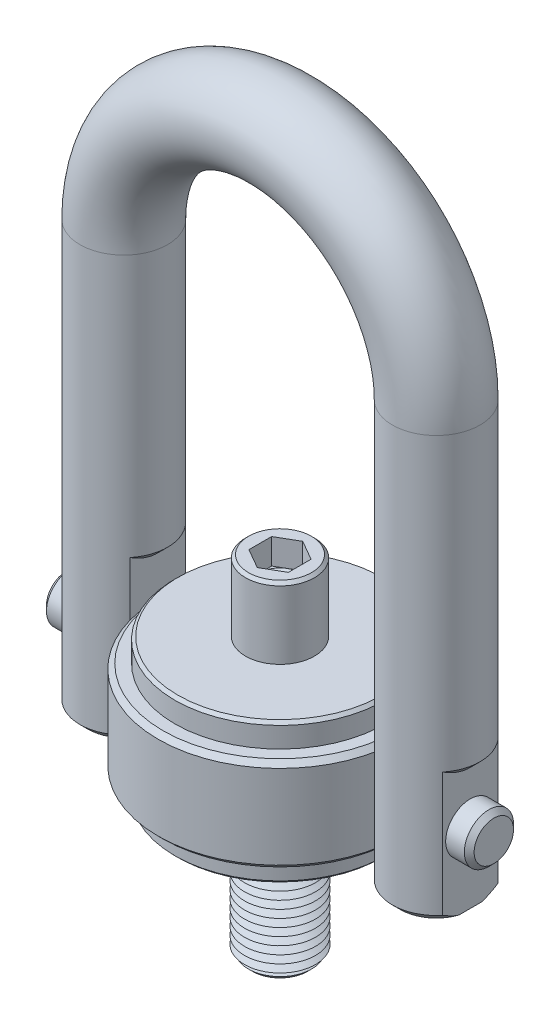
ISO-10303-21;
HEADER;
FILE_DESCRIPTION(('STEP AP214'),'2;1');
FILE_NAME('part.step','',(''),(''),'','','');
FILE_SCHEMA(('AUTOMOTIVE_DESIGN { 1 0 10303 214 1 1 1 1 }'));
ENDSEC;
DATA;
#1=APPLICATION_CONTEXT('core data for automotive mechanical design processes');
#2=APPLICATION_PROTOCOL_DEFINITION('international standard','automotive_design',2000,#1);
#3=PRODUCT_CONTEXT('',#1,'mechanical');
#4=PRODUCT('Part','Part','',(#3));
#5=PRODUCT_RELATED_PRODUCT_CATEGORY('part','',(#4));
#6=PRODUCT_DEFINITION_FORMATION('','',#4);
#7=PRODUCT_DEFINITION_CONTEXT('part definition',#1,'design');
#8=PRODUCT_DEFINITION('design','',#6,#7);
#9=PRODUCT_DEFINITION_SHAPE('','',#8);
#10=(LENGTH_UNIT() NAMED_UNIT(*) SI_UNIT(.MILLI.,.METRE.));
#11=(NAMED_UNIT(*) PLANE_ANGLE_UNIT() SI_UNIT($,.RADIAN.));
#12=(NAMED_UNIT(*) SI_UNIT($,.STERADIAN.) SOLID_ANGLE_UNIT());
#13=UNCERTAINTY_MEASURE_WITH_UNIT(LENGTH_MEASURE(1.E-05),#10,'distance_accuracy_value','');
#14=(GEOMETRIC_REPRESENTATION_CONTEXT(3) GLOBAL_UNCERTAINTY_ASSIGNED_CONTEXT((#13)) GLOBAL_UNIT_ASSIGNED_CONTEXT((#10,
#11,#12)) REPRESENTATION_CONTEXT('',''));
#15=CARTESIAN_POINT('',(0.,0.,0.));
#16=DIRECTION('',(0.,0.,1.));
#17=DIRECTION('',(1.,0.,0.));
#18=AXIS2_PLACEMENT_3D('',#15,#16,#17);
#19=CARTESIAN_POINT('',(108.6,0.,0.));
#20=DIRECTION('',(-1.,0.,0.));
#21=DIRECTION('',(0.,0.,1.));
#22=AXIS2_PLACEMENT_3D('',#19,#20,#21);
#23=CYLINDRICAL_SURFACE('',#22,12.5);
#24=CARTESIAN_POINT('',(-106.1,0.,0.));
#25=DIRECTION('',(1.,0.,0.));
#26=DIRECTION('',(0.,0.,-1.));
#27=AXIS2_PLACEMENT_3D('',#24,#25,#26);
#28=CIRCLE('',#27,12.5);
#29=CARTESIAN_POINT('',(-106.1,0.,12.5));
#30=VERTEX_POINT('',#29);
#31=EDGE_CURVE('P0_E25',#30,#30,#28,.T.);
#32=CARTESIAN_POINT('',(106.1,0.,0.));
#33=DIRECTION('',(1.,0.,0.));
#34=DIRECTION('',(0.,0.,-1.));
#35=AXIS2_PLACEMENT_3D('',#32,#33,#34);
#36=CIRCLE('',#35,12.5);
#37=CARTESIAN_POINT('',(106.1,0.,12.5));
#38=VERTEX_POINT('',#37);
#39=EDGE_CURVE('P0_E29',#38,#38,#36,.F.);
#40=CARTESIAN_POINT('',(-106.1,0.,12.5));
#41=CARTESIAN_POINT('',(-103.889583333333,0.,12.5));
#42=CARTESIAN_POINT('',(-101.679166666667,0.,12.5));
#43=CARTESIAN_POINT('',(-97.2583333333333,0.,12.5));
#44=CARTESIAN_POINT('',(-95.0479166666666,0.,12.5));
#45=CARTESIAN_POINT('',(-90.6270833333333,0.,12.5));
#46=CARTESIAN_POINT('',(-88.4166666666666,0.,12.5));
#47=CARTESIAN_POINT('',(-83.9958333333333,0.,12.5));
#48=CARTESIAN_POINT('',(-81.7854166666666,0.,12.5));
#49=CARTESIAN_POINT('',(-77.3645833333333,0.,12.5));
#50=CARTESIAN_POINT('',(-75.1541666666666,0.,12.5));
#51=CARTESIAN_POINT('',(-70.7333333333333,0.,12.5));
#52=CARTESIAN_POINT('',(-68.5229166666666,0.,12.5));
#53=CARTESIAN_POINT('',(-64.1020833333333,0.,12.5));
#54=CARTESIAN_POINT('',(-61.8916666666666,0.,12.5));
#55=CARTESIAN_POINT('',(-57.4708333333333,0.,12.5));
#56=CARTESIAN_POINT('',(-55.2604166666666,0.,12.5));
#57=CARTESIAN_POINT('',(-50.8395833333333,0.,12.5));
#58=CARTESIAN_POINT('',(-48.6291666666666,0.,12.5));
#59=CARTESIAN_POINT('',(-44.2083333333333,0.,12.5));
#60=CARTESIAN_POINT('',(-41.9979166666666,0.,12.5));
#61=CARTESIAN_POINT('',(-37.5770833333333,0.,12.5));
#62=CARTESIAN_POINT('',(-35.3666666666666,0.,12.5));
#63=CARTESIAN_POINT('',(-30.9458333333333,0.,12.5));
#64=CARTESIAN_POINT('',(-28.7354166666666,0.,12.5));
#65=CARTESIAN_POINT('',(-24.3145833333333,0.,12.5));
#66=CARTESIAN_POINT('',(-22.1041666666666,0.,12.5));
#67=CARTESIAN_POINT('',(-17.6833333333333,0.,12.5));
#68=CARTESIAN_POINT('',(-15.4729166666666,0.,12.5));
#69=CARTESIAN_POINT('',(-11.0520833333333,0.,12.5));
#70=CARTESIAN_POINT('',(-8.84166666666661,0.,12.5));
#71=CARTESIAN_POINT('',(-4.42083333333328,0.,12.5));
#72=CARTESIAN_POINT('',(-2.21041666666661,0.,12.5));
#73=CARTESIAN_POINT('',(2.21041666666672,0.,12.5));
#74=CARTESIAN_POINT('',(4.42083333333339,0.,12.5));
#75=CARTESIAN_POINT('',(8.84166666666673,0.,12.5));
#76=CARTESIAN_POINT('',(11.0520833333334,0.,12.5));
#77=CARTESIAN_POINT('',(15.4729166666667,0.,12.5));
#78=CARTESIAN_POINT('',(17.6833333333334,0.,12.5));
#79=CARTESIAN_POINT('',(22.1041666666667,0.,12.5));
#80=CARTESIAN_POINT('',(24.3145833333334,0.,12.5));
#81=CARTESIAN_POINT('',(28.7354166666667,0.,12.5));
#82=CARTESIAN_POINT('',(30.9458333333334,0.,12.5));
#83=CARTESIAN_POINT('',(35.3666666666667,0.,12.5));
#84=CARTESIAN_POINT('',(37.5770833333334,0.,12.5));
#85=CARTESIAN_POINT('',(41.9979166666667,0.,12.5));
#86=CARTESIAN_POINT('',(44.2083333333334,0.,12.5));
#87=CARTESIAN_POINT('',(48.6291666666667,0.,12.5));
#88=CARTESIAN_POINT('',(50.8395833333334,0.,12.5));
#89=CARTESIAN_POINT('',(55.2604166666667,0.,12.5));
#90=CARTESIAN_POINT('',(57.4708333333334,0.,12.5));
#91=CARTESIAN_POINT('',(61.8916666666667,0.,12.5));
#92=CARTESIAN_POINT('',(64.1020833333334,0.,12.5));
#93=CARTESIAN_POINT('',(68.5229166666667,0.,12.5));
#94=CARTESIAN_POINT('',(70.7333333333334,0.,12.5));
#95=CARTESIAN_POINT('',(75.1541666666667,0.,12.5));
#96=CARTESIAN_POINT('',(77.3645833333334,0.,12.5));
#97=CARTESIAN_POINT('',(81.7854166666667,0.,12.5));
#98=CARTESIAN_POINT('',(83.9958333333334,0.,12.5));
#99=CARTESIAN_POINT('',(88.4166666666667,0.,12.5));
#100=CARTESIAN_POINT('',(90.6270833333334,0.,12.5));
#101=CARTESIAN_POINT('',(95.0479166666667,0.,12.5));
#102=CARTESIAN_POINT('',(97.2583333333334,0.,12.5));
#103=CARTESIAN_POINT('',(101.679166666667,0.,12.5));
#104=CARTESIAN_POINT('',(103.889583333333,0.,12.5));
#105=CARTESIAN_POINT('',(106.1,0.,12.5));
#106=B_SPLINE_CURVE_WITH_KNOTS('',3,(#40,#41,#42,#43,#44,#45,#46,#47,#48,#49,#50,#51,#52,#53,
#54,#55,#56,#57,#58,#59,#60,#61,#62,#63,#64,#65,#66,#67,#68,#69,#70,#71,#72,#73,#74,#75,#76,#77,
#78,#79,#80,#81,#82,#83,#84,#85,#86,#87,#88,#89,#90,#91,#92,#93,#94,#95,#96,#97,#98,#99,#100,
#101,#102,#103,#104,#105),.UNSPECIFIED.,.F.,.F.,(4,2,2,2,2,2,2,2,2,2,2,2,2,2,2,2,2,2,2,2,2,2,2,
2,2,2,2,2,2,2,2,2,4),(0.,6.63125,13.2625,19.89375,26.525,33.15625,39.7875,46.41875,53.05,
59.68125,66.3125,72.94375,79.575,86.20625,92.8375,99.46875,106.1,112.73125,119.3625,125.99375,
132.625,139.25625,145.8875,152.51875,159.15,165.78125,172.4125,179.04375,185.675,192.30625,
198.9375,205.56875,212.2),.UNSPECIFIED.);
#107=EDGE_CURVE('P0_BSEAM14',#30,#38,#106,.T.);
#108=ORIENTED_EDGE('',*,*,#31,.T.);
#109=ORIENTED_EDGE('',*,*,#39,.T.);
#110=ORIENTED_EDGE('',*,*,#107,.T.);
#111=ORIENTED_EDGE('',*,*,#107,.F.);
#112=EDGE_LOOP('',(#108,#110,#109,#111));
#113=FACE_BOUND('',#112,.T.);
#114=ADVANCED_FACE('P0_F14',(#113),#23,.T.);
#115=CARTESIAN_POINT('',(108.6,0.,0.));
#116=DIRECTION('',(1.,0.,0.));
#117=DIRECTION('',(0.,0.,-1.));
#118=AXIS2_PLACEMENT_3D('',#115,#116,#117);
#119=PLANE('',#118);
#120=CARTESIAN_POINT('',(108.6,0.,0.));
#121=DIRECTION('',(1.,0.,0.));
#122=DIRECTION('',(0.,0.,-1.));
#123=AXIS2_PLACEMENT_3D('',#120,#121,#122);
#124=CIRCLE('',#123,10.0000000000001);
#125=CARTESIAN_POINT('',(108.6,0.,-10.0000000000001));
#126=VERTEX_POINT('',#125);
#127=EDGE_CURVE('P0_E10',#126,#126,#124,.T.);
#128=ORIENTED_EDGE('',*,*,#127,.T.);
#129=EDGE_LOOP('',(#128));
#130=FACE_BOUND('',#129,.T.);
#131=ADVANCED_FACE('P0_F46',(#130),#119,.T.);
#132=CARTESIAN_POINT('',(-108.6,0.,0.));
#133=DIRECTION('',(1.,0.,0.));
#134=DIRECTION('',(0.,0.,-1.));
#135=AXIS2_PLACEMENT_3D('',#132,#133,#134);
#136=PLANE('',#135);
#137=CARTESIAN_POINT('',(-108.6,0.,0.));
#138=DIRECTION('',(1.,0.,0.));
#139=DIRECTION('',(0.,0.,-1.));
#140=AXIS2_PLACEMENT_3D('',#137,#138,#139);
#141=CIRCLE('',#140,9.9999999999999);
#142=CARTESIAN_POINT('',(-108.6,0.,-9.9999999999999));
#143=VERTEX_POINT('',#142);
#144=EDGE_CURVE('P0_E21',#143,#143,#141,.F.);
#145=ORIENTED_EDGE('',*,*,#144,.T.);
#146=EDGE_LOOP('',(#145));
#147=FACE_BOUND('',#146,.T.);
#148=ADVANCED_FACE('P0_F43',(#147),#136,.F.);
#149=CARTESIAN_POINT('',(-106.1,0.,0.));
#150=DIRECTION('',(1.,0.,0.));
#151=DIRECTION('',(0.,0.,-1.));
#152=AXIS2_PLACEMENT_3D('',#149,#150,#151);
#153=CONICAL_SURFACE('',#152,12.5,0.785398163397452);
#154=ORIENTED_EDGE('',*,*,#144,.F.);
#155=EDGE_LOOP('',(#154));
#156=FACE_BOUND('',#155,.T.);
#157=ORIENTED_EDGE('',*,*,#31,.F.);
#158=EDGE_LOOP('',(#157));
#159=FACE_BOUND('',#158,.T.);
#160=ADVANCED_FACE('P0_F38',(#156,#159),#153,.T.);
#161=CARTESIAN_POINT('',(108.6,0.,0.));
#162=DIRECTION('',(-1.,0.,0.));
#163=DIRECTION('',(0.,0.,1.));
#164=AXIS2_PLACEMENT_3D('',#161,#162,#163);
#165=CONICAL_SURFACE('',#164,10.0000000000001,0.785398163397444);
#166=ORIENTED_EDGE('',*,*,#39,.F.);
#167=EDGE_LOOP('',(#166));
#168=FACE_BOUND('',#167,.T.);
#169=ORIENTED_EDGE('',*,*,#127,.F.);
#170=EDGE_LOOP('',(#169));
#171=FACE_BOUND('',#170,.T.);
#172=ADVANCED_FACE('P0_F16',(#168,#171),#165,.T.);
#173=CLOSED_SHELL('',(#114,#131,#148,#160,#172));
#174=MANIFOLD_SOLID_BREP('P0_B1',#173);
#175=CARTESIAN_POINT('',(79.3500000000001,-35.6999999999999,0.));
#176=DIRECTION('',(0.,-1.,0.));
#177=DIRECTION('',(0.,0.,1.));
#178=AXIS2_PLACEMENT_3D('',#175,#176,#177);
#179=PLANE('',#178);
#180=DIRECTION('',(0.,0.,-1.));
#181=VECTOR('',#180,1.);
#182=CARTESIAN_POINT('',(62.0565763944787,-35.7,14.));
#183=LINE('',#182,#181);
#184=CARTESIAN_POINT('',(62.0565763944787,-35.7,5.83095189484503));
#185=VERTEX_POINT('',#184);
#186=CARTESIAN_POINT('',(62.0565763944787,-35.7,-5.83095189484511));
#187=VERTEX_POINT('',#186);
#188=EDGE_CURVE('P1_E132',#185,#187,#183,.T.);
#189=ORIENTED_EDGE('',*,*,#188,.T.);
#190=CARTESIAN_POINT('',(79.3500000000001,-35.6999999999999,0.));
#191=DIRECTION('',(0.,-1.,0.));
#192=DIRECTION('',(1.,0.,0.));
#193=AXIS2_PLACEMENT_3D('',#190,#191,#192);
#194=CIRCLE('',#193,18.25);
#195=CARTESIAN_POINT('',(96.6434236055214,-35.7,-5.83095189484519));
#196=VERTEX_POINT('',#195);
#197=EDGE_CURVE('P1_E192',#187,#196,#194,.T.);
#198=ORIENTED_EDGE('',*,*,#197,.T.);
#199=DIRECTION('',(0.,0.,1.));
#200=VECTOR('',#199,1.);
#201=CARTESIAN_POINT('',(96.6434236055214,-35.7,14.));
#202=LINE('',#201,#200);
#203=CARTESIAN_POINT('',(96.6434236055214,-35.7,5.83095189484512));
#204=VERTEX_POINT('',#203);
#205=EDGE_CURVE('P1_E315',#196,#204,#202,.T.);
#206=ORIENTED_EDGE('',*,*,#205,.T.);
#207=CARTESIAN_POINT('',(79.3500000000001,-35.6999999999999,0.));
#208=DIRECTION('',(0.,-1.,0.));
#209=DIRECTION('',(1.,0.,0.));
#210=AXIS2_PLACEMENT_3D('',#207,#208,#209);
#211=CIRCLE('',#210,18.25);
#212=CARTESIAN_POINT('',(79.3500000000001,-35.6999999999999,18.25));
#213=VERTEX_POINT('',#212);
#214=EDGE_CURVE('P1_E370',#204,#213,#211,.T.);
#215=ORIENTED_EDGE('',*,*,#214,.T.);
#216=CARTESIAN_POINT('',(79.3500000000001,-35.6999999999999,0.));
#217=DIRECTION('',(0.,-1.,0.));
#218=DIRECTION('',(1.,0.,0.));
#219=AXIS2_PLACEMENT_3D('',#216,#217,#218);
#220=CIRCLE('',#219,18.25);
#221=EDGE_CURVE('P1_E369',#213,#185,#220,.T.);
#222=ORIENTED_EDGE('',*,*,#221,.T.);
#223=EDGE_LOOP('',(#189,#198,#206,#215,#222));
#224=FACE_BOUND('',#223,.T.);
#225=ADVANCED_FACE('P1_F16',(#224),#179,.T.);
#226=CARTESIAN_POINT('',(79.35,179.4,0.));
#227=DIRECTION('',(0.,-1.,0.));
#228=DIRECTION('',(1.,0.,0.));
#229=AXIS2_PLACEMENT_3D('',#226,#227,#228);
#230=CYLINDRICAL_SURFACE('',#229,22.25);
#231=CARTESIAN_POINT('',(79.35,179.4,0.));
#232=DIRECTION('',(0.,-1.,0.));
#233=DIRECTION('',(0.,0.,1.));
#234=AXIS2_PLACEMENT_3D('',#231,#232,#233);
#235=CIRCLE('',#234,22.25);
#236=CARTESIAN_POINT('',(101.6,179.4,0.));
#237=VERTEX_POINT('',#236);
#238=EDGE_CURVE('P1_E143',#237,#237,#235,.T.);
#239=ORIENTED_EDGE('',*,*,#238,.T.);
#240=EDGE_LOOP('',(#239));
#241=FACE_BOUND('',#240,.T.);
#242=DIRECTION('',(0.,-1.,0.));
#243=VECTOR('',#242,1.);
#244=CARTESIAN_POINT('',(96.6434236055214,24.3,-14.));
#245=LINE('',#244,#243);
#246=CARTESIAN_POINT('',(96.6434236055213,31.3000000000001,-14.));
#247=VERTEX_POINT('',#246);
#248=CARTESIAN_POINT('',(96.6434236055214,-31.6999999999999,-14.));
#249=VERTEX_POINT('',#248);
#250=EDGE_CURVE('P1_E328',#247,#249,#245,.T.);
#251=ORIENTED_EDGE('',*,*,#250,.T.);
#252=CARTESIAN_POINT('',(79.3500000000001,-31.6999999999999,0.));
#253=DIRECTION('',(0.,-1.,0.));
#254=DIRECTION('',(0.,0.,-1.));
#255=AXIS2_PLACEMENT_3D('',#252,#253,#254);
#256=CIRCLE('',#255,22.25);
#257=CARTESIAN_POINT('',(62.0565763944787,-31.6999999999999,-14.));
#258=VERTEX_POINT('',#257);
#259=EDGE_CURVE('P1_E128',#249,#258,#256,.F.);
#260=ORIENTED_EDGE('',*,*,#259,.T.);
#261=DIRECTION('',(0.,-1.,0.));
#262=VECTOR('',#261,1.);
#263=CARTESIAN_POINT('',(62.0565763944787,39.3,-14.));
#264=LINE('',#263,#262);
#265=CARTESIAN_POINT('',(62.0565763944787,46.3000000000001,-14.));
#266=VERTEX_POINT('',#265);
#267=EDGE_CURVE('P1_E120',#266,#258,#264,.T.);
#268=ORIENTED_EDGE('',*,*,#267,.F.);
#269=CARTESIAN_POINT('',(79.35,46.3000000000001,0.));
#270=DIRECTION('',(0.,-1.,0.));
#271=DIRECTION('',(0.,0.,-1.));
#272=AXIS2_PLACEMENT_3D('',#269,#270,#271);
#273=CIRCLE('',#272,22.25);
#274=CARTESIAN_POINT('',(62.0565763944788,46.3000000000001,14.));
#275=VERTEX_POINT('',#274);
#276=EDGE_CURVE('P1_E126',#266,#275,#273,.F.);
#277=ORIENTED_EDGE('',*,*,#276,.T.);
#278=DIRECTION('',(0.,-1.,0.));
#279=VECTOR('',#278,1.);
#280=CARTESIAN_POINT('',(62.0565763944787,39.3,14.));
#281=LINE('',#280,#279);
#282=CARTESIAN_POINT('',(62.0565763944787,-31.6999999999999,14.));
#283=VERTEX_POINT('',#282);
#284=EDGE_CURVE('P1_E131',#275,#283,#281,.T.);
#285=ORIENTED_EDGE('',*,*,#284,.T.);
#286=CARTESIAN_POINT('',(79.3500000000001,-31.6999999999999,0.));
#287=DIRECTION('',(0.,-1.,0.));
#288=DIRECTION('',(0.,0.,-1.));
#289=AXIS2_PLACEMENT_3D('',#286,#287,#288);
#290=CIRCLE('',#289,22.25);
#291=CARTESIAN_POINT('',(79.3500000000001,-31.6999999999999,22.25));
#292=VERTEX_POINT('',#291);
#293=EDGE_CURVE('P1_E530',#283,#292,#290,.F.);
#294=ORIENTED_EDGE('',*,*,#293,.T.);
#295=CARTESIAN_POINT('',(79.3500000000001,-31.6999999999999,0.));
#296=DIRECTION('',(0.,-1.,0.));
#297=DIRECTION('',(0.,0.,-1.));
#298=AXIS2_PLACEMENT_3D('',#295,#296,#297);
#299=CIRCLE('',#298,22.25);
#300=CARTESIAN_POINT('',(96.6434236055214,-31.6999999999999,14.));
#301=VERTEX_POINT('',#300);
#302=EDGE_CURVE('P1_E528',#292,#301,#299,.F.);
#303=ORIENTED_EDGE('',*,*,#302,.T.);
#304=DIRECTION('',(0.,-1.,0.));
#305=VECTOR('',#304,1.);
#306=CARTESIAN_POINT('',(96.6434236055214,24.3,14.));
#307=LINE('',#306,#305);
#308=CARTESIAN_POINT('',(96.6434236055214,31.3000000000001,14.));
#309=VERTEX_POINT('',#308);
#310=EDGE_CURVE('P1_E327',#309,#301,#307,.T.);
#311=ORIENTED_EDGE('',*,*,#310,.F.);
#312=CARTESIAN_POINT('',(79.35,31.3000000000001,0.));
#313=DIRECTION('',(0.,-1.,0.));
#314=DIRECTION('',(1.,0.,0.));
#315=AXIS2_PLACEMENT_3D('',#312,#313,#314);
#316=CIRCLE('',#315,22.25);
#317=EDGE_CURVE('P1_E142',#309,#247,#316,.F.);
#318=ORIENTED_EDGE('',*,*,#317,.T.);
#319=EDGE_LOOP('',(#251,#260,#268,#277,#285,#294,#303,#311,#318));
#320=FACE_BOUND('',#319,.T.);
#321=ADVANCED_FACE('P1_F123',(#241,#320),#230,.T.);
#322=CARTESIAN_POINT('',(-79.3500000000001,-35.7,0.));
#323=DIRECTION('',(0.,1.,0.));
#324=DIRECTION('',(0.,0.,1.));
#325=AXIS2_PLACEMENT_3D('',#322,#323,#324);
#326=PLANE('',#325);
#327=DIRECTION('',(0.,0.,1.));
#328=VECTOR('',#327,1.);
#329=CARTESIAN_POINT('',(-96.6434236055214,-35.7,14.));
#330=LINE('',#329,#328);
#331=CARTESIAN_POINT('',(-96.6434236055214,-35.7,-5.83095189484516));
#332=VERTEX_POINT('',#331);
#333=CARTESIAN_POINT('',(-96.6434236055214,-35.7,5.83095189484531));
#334=VERTEX_POINT('',#333);
#335=EDGE_CURVE('P1_E334',#332,#334,#330,.T.);
#336=ORIENTED_EDGE('',*,*,#335,.F.);
#337=CARTESIAN_POINT('',(-79.3500000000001,-35.7,0.));
#338=DIRECTION('',(0.,1.,0.));
#339=DIRECTION('',(0.,0.,1.));
#340=AXIS2_PLACEMENT_3D('',#337,#338,#339);
#341=CIRCLE('',#340,18.25);
#342=CARTESIAN_POINT('',(-62.0565763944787,-35.7,-5.83095189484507));
#343=VERTEX_POINT('',#342);
#344=EDGE_CURVE('P1_E40',#332,#343,#341,.F.);
#345=ORIENTED_EDGE('',*,*,#344,.T.);
#346=DIRECTION('',(0.,0.,-1.));
#347=VECTOR('',#346,1.);
#348=CARTESIAN_POINT('',(-62.0565763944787,-35.7,14.));
#349=LINE('',#348,#347);
#350=CARTESIAN_POINT('',(-62.0565763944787,-35.7,5.83095189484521));
#351=VERTEX_POINT('',#350);
#352=EDGE_CURVE('P1_E303',#351,#343,#349,.T.);
#353=ORIENTED_EDGE('',*,*,#352,.F.);
#354=CARTESIAN_POINT('',(-79.3500000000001,-35.7,0.));
#355=DIRECTION('',(0.,1.,0.));
#356=DIRECTION('',(0.,0.,1.));
#357=AXIS2_PLACEMENT_3D('',#354,#355,#356);
#358=CIRCLE('',#357,18.25);
#359=CARTESIAN_POINT('',(-79.3500000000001,-35.7,18.25));
#360=VERTEX_POINT('',#359);
#361=EDGE_CURVE('P1_E34',#351,#360,#358,.F.);
#362=ORIENTED_EDGE('',*,*,#361,.T.);
#363=CARTESIAN_POINT('',(-79.3500000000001,-35.7,0.));
#364=DIRECTION('',(0.,1.,0.));
#365=DIRECTION('',(0.,0.,1.));
#366=AXIS2_PLACEMENT_3D('',#363,#364,#365);
#367=CIRCLE('',#366,18.25);
#368=EDGE_CURVE('P1_E298',#360,#334,#367,.F.);
#369=ORIENTED_EDGE('',*,*,#368,.T.);
#370=EDGE_LOOP('',(#336,#345,#353,#362,#369));
#371=FACE_BOUND('',#370,.T.);
#372=ADVANCED_FACE('P1_F239',(#371),#326,.F.);
#373=CARTESIAN_POINT('',(-79.3500000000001,-35.7,0.));
#374=DIRECTION('',(0.,1.,0.));
#375=DIRECTION('',(-1.,0.,0.));
#376=AXIS2_PLACEMENT_3D('',#373,#374,#375);
#377=CYLINDRICAL_SURFACE('',#376,22.25);
#378=DIRECTION('',(0.,-1.,0.));
#379=VECTOR('',#378,1.);
#380=CARTESIAN_POINT('',(-62.0565763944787,39.3,-14.));
#381=LINE('',#380,#379);
#382=CARTESIAN_POINT('',(-62.0565763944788,46.3,-14.));
#383=VERTEX_POINT('',#382);
#384=CARTESIAN_POINT('',(-62.0565763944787,-31.7,-14.));
#385=VERTEX_POINT('',#384);
#386=EDGE_CURVE('P1_E340',#383,#385,#381,.T.);
#387=ORIENTED_EDGE('',*,*,#386,.T.);
#388=CARTESIAN_POINT('',(-79.3500000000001,-31.7,0.));
#389=DIRECTION('',(0.,1.,0.));
#390=DIRECTION('',(0.,0.,1.));
#391=AXIS2_PLACEMENT_3D('',#388,#389,#390);
#392=CIRCLE('',#391,22.25);
#393=CARTESIAN_POINT('',(-96.6434236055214,-31.7,-14.));
#394=VERTEX_POINT('',#393);
#395=EDGE_CURVE('P1_E287',#385,#394,#392,.T.);
#396=ORIENTED_EDGE('',*,*,#395,.T.);
#397=DIRECTION('',(0.,-1.,0.));
#398=VECTOR('',#397,1.);
#399=CARTESIAN_POINT('',(-96.6434236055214,24.3,-14.));
#400=LINE('',#399,#398);
#401=CARTESIAN_POINT('',(-96.6434236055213,31.3000000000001,-14.));
#402=VERTEX_POINT('',#401);
#403=EDGE_CURVE('P1_E337',#402,#394,#400,.T.);
#404=ORIENTED_EDGE('',*,*,#403,.F.);
#405=CARTESIAN_POINT('',(-79.35,31.3000000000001,0.));
#406=DIRECTION('',(0.,-1.,0.));
#407=DIRECTION('',(1.,0.,0.));
#408=AXIS2_PLACEMENT_3D('',#405,#406,#407);
#409=CIRCLE('',#408,22.25);
#410=CARTESIAN_POINT('',(-96.6434236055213,31.3000000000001,14.));
#411=VERTEX_POINT('',#410);
#412=EDGE_CURVE('P1_E146',#402,#411,#409,.F.);
#413=ORIENTED_EDGE('',*,*,#412,.T.);
#414=DIRECTION('',(0.,-1.,0.));
#415=VECTOR('',#414,1.);
#416=CARTESIAN_POINT('',(-96.6434236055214,24.3,14.));
#417=LINE('',#416,#415);
#418=CARTESIAN_POINT('',(-96.6434236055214,-31.7000000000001,14.));
#419=VERTEX_POINT('',#418);
#420=EDGE_CURVE('P1_E308',#411,#419,#417,.T.);
#421=ORIENTED_EDGE('',*,*,#420,.T.);
#422=CARTESIAN_POINT('',(-79.3500000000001,-31.7000000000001,0.));
#423=DIRECTION('',(0.,1.,0.));
#424=DIRECTION('',(0.,0.,1.));
#425=AXIS2_PLACEMENT_3D('',#422,#423,#424);
#426=CIRCLE('',#425,22.25);
#427=CARTESIAN_POINT('',(-79.3500000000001,-31.7000000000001,22.25));
#428=VERTEX_POINT('',#427);
#429=EDGE_CURVE('P1_E284',#419,#428,#426,.T.);
#430=ORIENTED_EDGE('',*,*,#429,.T.);
#431=CARTESIAN_POINT('',(-79.3500000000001,-31.7000000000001,0.));
#432=DIRECTION('',(0.,1.,0.));
#433=DIRECTION('',(0.,0.,1.));
#434=AXIS2_PLACEMENT_3D('',#431,#432,#433);
#435=CIRCLE('',#434,22.25);
#436=CARTESIAN_POINT('',(-62.0565763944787,-31.7000000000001,14.));
#437=VERTEX_POINT('',#436);
#438=EDGE_CURVE('P1_E277',#428,#437,#435,.T.);
#439=ORIENTED_EDGE('',*,*,#438,.T.);
#440=DIRECTION('',(0.,-1.,0.));
#441=VECTOR('',#440,1.);
#442=CARTESIAN_POINT('',(-62.0565763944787,39.3,14.));
#443=LINE('',#442,#441);
#444=CARTESIAN_POINT('',(-62.0565763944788,46.3,14.));
#445=VERTEX_POINT('',#444);
#446=EDGE_CURVE('P1_E305',#445,#437,#443,.T.);
#447=ORIENTED_EDGE('',*,*,#446,.F.);
#448=CARTESIAN_POINT('',(-79.35,46.3,0.));
#449=DIRECTION('',(0.,-1.,0.));
#450=DIRECTION('',(0.,0.,-1.));
#451=AXIS2_PLACEMENT_3D('',#448,#449,#450);
#452=CIRCLE('',#451,22.25);
#453=EDGE_CURVE('P1_E155',#445,#383,#452,.F.);
#454=ORIENTED_EDGE('',*,*,#453,.T.);
#455=EDGE_LOOP('',(#387,#396,#404,#413,#421,#430,#439,#447,#454));
#456=FACE_BOUND('',#455,.T.);
#457=CARTESIAN_POINT('',(-79.35,179.4,0.));
#458=DIRECTION('',(0.,1.,0.));
#459=DIRECTION('',(0.,0.,1.));
#460=AXIS2_PLACEMENT_3D('',#457,#458,#459);
#461=CIRCLE('',#460,22.25);
#462=CARTESIAN_POINT('',(-101.6,179.4,0.));
#463=VERTEX_POINT('',#462);
#464=EDGE_CURVE('P1_E149',#463,#463,#461,.T.);
#465=ORIENTED_EDGE('',*,*,#464,.F.);
#466=EDGE_LOOP('',(#465));
#467=FACE_BOUND('',#466,.T.);
#468=ADVANCED_FACE('P1_F241',(#456,#467),#377,.T.);
#469=CARTESIAN_POINT('',(0.,179.4,0.));
#470=DIRECTION('',(0.,0.,-1.));
#471=DIRECTION('',(-1.,0.,0.));
#472=AXIS2_PLACEMENT_3D('',#469,#470,#471);
#473=TOROIDAL_SURFACE('',#472,79.35,22.25);
#474=CARTESIAN_POINT('',(0.,179.4,0.));
#475=DIRECTION('',(0.,0.,-1.));
#476=DIRECTION('',(-1.,0.,0.));
#477=AXIS2_PLACEMENT_3D('',#474,#475,#476);
#478=CIRCLE('',#477,101.6);
#479=EDGE_CURVE('',#463,#237,#478,.T.);
#480=ORIENTED_EDGE('',*,*,#464,.T.);
#481=ORIENTED_EDGE('',*,*,#238,.F.);
#482=ORIENTED_EDGE('',*,*,#479,.T.);
#483=ORIENTED_EDGE('',*,*,#479,.F.);
#484=EDGE_LOOP('',(#480,#482,#481,#483));
#485=FACE_BOUND('',#484,.T.);
#486=ADVANCED_FACE('P1_F237',(#485),#473,.T.);
#487=CARTESIAN_POINT('',(-62.0565763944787,39.3,14.));
#488=DIRECTION('',(-1.,0.,0.));
#489=DIRECTION('',(0.,0.,1.));
#490=AXIS2_PLACEMENT_3D('',#487,#488,#489);
#491=PLANE('',#490);
#492=CARTESIAN_POINT('',(-62.0565763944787,0.,0.));
#493=DIRECTION('',(-1.,0.,0.));
#494=DIRECTION('',(0.,0.,1.));
#495=AXIS2_PLACEMENT_3D('',#492,#493,#494);
#496=CIRCLE('',#495,12.5);
#497=CARTESIAN_POINT('',(-62.0565763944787,0.,12.5));
#498=VERTEX_POINT('',#497);
#499=EDGE_CURVE('P1_E313',#498,#498,#496,.T.);
#500=ORIENTED_EDGE('',*,*,#499,.T.);
#501=EDGE_LOOP('',(#500));
#502=FACE_BOUND('',#501,.T.);
#503=ORIENTED_EDGE('',*,*,#352,.T.);
#504=CARTESIAN_POINT('',(-62.0565763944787,-35.7,-5.83095189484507));
#505=CARTESIAN_POINT('',(-62.0565763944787,-35.58398574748,-6.19401937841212));
#506=CARTESIAN_POINT('',(-62.0565763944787,-35.4591933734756,-6.55418682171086));
#507=CARTESIAN_POINT('',(-62.0565763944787,-35.1940757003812,-7.26858296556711));
#508=CARTESIAN_POINT('',(-62.0565763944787,-35.0537576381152,-7.62281434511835));
#509=CARTESIAN_POINT('',(-62.0565763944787,-34.7600585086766,-8.32420425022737));
#510=CARTESIAN_POINT('',(-62.0565763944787,-34.6067289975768,-8.67138450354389));
#511=CARTESIAN_POINT('',(-62.0565763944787,-34.2882447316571,-9.36031187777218));
#512=CARTESIAN_POINT('',(-62.0565763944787,-34.1230885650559,-9.70205834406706));
#513=CARTESIAN_POINT('',(-62.0565763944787,-33.7827181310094,-10.3799111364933));
#514=CARTESIAN_POINT('',(-62.0565763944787,-33.6075177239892,-10.7160244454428));
#515=CARTESIAN_POINT('',(-62.0565763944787,-33.2481701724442,-11.3834225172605));
#516=CARTESIAN_POINT('',(-62.0565763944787,-33.0640230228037,-11.7147072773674));
#517=CARTESIAN_POINT('',(-62.0565763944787,-32.6871902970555,-12.3740913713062));
#518=CARTESIAN_POINT('',(-62.0565763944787,-32.494474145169,-12.702173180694));
#519=CARTESIAN_POINT('',(-62.0565763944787,-32.1021630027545,-13.3541357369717));
#520=CARTESIAN_POINT('',(-62.0565763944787,-31.9025690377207,-13.6780171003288));
#521=CARTESIAN_POINT('',(-62.0565763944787,-31.7,-14.));
#522=B_SPLINE_CURVE_WITH_KNOTS('',3,(#504,#505,#506,#507,#508,#509,#510,#511,#512,#513,#514,
#515,#516,#517,#518,#519,#520,#521),.UNSPECIFIED.,.F.,.F.,(4,2,2,2,2,2,2,2,4),(0.,
1.14321450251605,2.28589835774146,3.42424887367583,4.56273550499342,5.69968723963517,
6.83663962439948,7.97803842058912,9.11926776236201),.UNSPECIFIED.);
#523=EDGE_CURVE('P1_E11',#343,#385,#522,.T.);
#524=ORIENTED_EDGE('',*,*,#523,.T.);
#525=ORIENTED_EDGE('',*,*,#386,.F.);
#526=CARTESIAN_POINT('',(-62.0565763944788,46.3,-14.));
#527=CARTESIAN_POINT('',(-62.0565763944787,46.08757975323,-13.6623513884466));
#528=CARTESIAN_POINT('',(-62.0565763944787,45.8784256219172,-13.3226161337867));
#529=CARTESIAN_POINT('',(-62.0565763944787,45.4677120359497,-12.638478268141));
#530=CARTESIAN_POINT('',(-62.0565763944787,45.2661544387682,-12.294074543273));
#531=CARTESIAN_POINT('',(-62.0565763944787,44.8709431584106,-11.598760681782));
#532=CARTESIAN_POINT('',(-62.0565763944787,44.6773276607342,-11.2478287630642));
#533=CARTESIAN_POINT('',(-62.0565763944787,44.3003266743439,-10.5405310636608));
#534=CARTESIAN_POINT('',(-62.0565763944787,44.1169405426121,-10.1841656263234));
#535=CARTESIAN_POINT('',(-62.0565763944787,43.7584088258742,-9.45835090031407));
#536=CARTESIAN_POINT('',(-62.0565763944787,43.5835025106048,-9.08878256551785));
#537=CARTESIAN_POINT('',(-62.0565763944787,43.2479479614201,-8.34323555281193));
#538=CARTESIAN_POINT('',(-62.0565763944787,43.0873009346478,-7.96725633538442));
#539=CARTESIAN_POINT('',(-62.0565763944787,42.6305688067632,-6.83050144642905));
#540=CARTESIAN_POINT('',(-62.0565763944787,42.3589507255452,-6.05944377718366));
#541=CARTESIAN_POINT('',(-62.0565763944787,41.9844305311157,-4.77597443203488));
#542=CARTESIAN_POINT('',(-62.0565763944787,41.8560447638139,-4.27094970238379));
#543=CARTESIAN_POINT('',(-62.0565763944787,41.6395093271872,-3.25203170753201));
#544=CARTESIAN_POINT('',(-62.0565763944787,41.5513652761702,-2.7381372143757));
#545=CARTESIAN_POINT('',(-62.0565763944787,41.4528477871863,-1.96507741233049));
#546=CARTESIAN_POINT('',(-62.0565763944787,41.4256638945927,-1.70796920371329));
#547=CARTESIAN_POINT('',(-62.0565763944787,41.3826139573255,-1.19281542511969));
#548=CARTESIAN_POINT('',(-62.0565763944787,41.3667466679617,-0.934769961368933));
#549=CARTESIAN_POINT('',(-62.0565763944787,41.3465580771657,-0.418324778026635));
#550=CARTESIAN_POINT('',(-62.0565763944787,41.3422326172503,-0.159925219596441));
#551=CARTESIAN_POINT('',(-62.0565763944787,41.3451748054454,0.356781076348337));
#552=CARTESIAN_POINT('',(-62.0565763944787,41.3524409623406,0.615087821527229));
#553=CARTESIAN_POINT('',(-62.0565763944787,41.374195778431,1.04656254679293));
#554=CARTESIAN_POINT('',(-62.0565763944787,41.3855379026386,1.21989565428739));
#555=CARTESIAN_POINT('',(-62.0565763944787,41.4133359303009,1.56611318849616));
#556=CARTESIAN_POINT('',(-62.0565763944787,41.4297908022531,1.73899769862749));
#557=CARTESIAN_POINT('',(-62.0565763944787,41.4867069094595,2.25698800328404));
#558=CARTESIAN_POINT('',(-62.0565763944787,41.534712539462,2.60129233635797));
#559=CARTESIAN_POINT('',(-62.0565763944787,41.6449454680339,3.25816008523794));
#560=CARTESIAN_POINT('',(-62.0565763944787,41.7056579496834,3.57098183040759));
#561=CARTESIAN_POINT('',(-62.0565763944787,41.8419839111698,4.19337992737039));
#562=CARTESIAN_POINT('',(-62.0565763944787,41.9175993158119,4.50295585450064));
#563=CARTESIAN_POINT('',(-62.0565763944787,42.1651494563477,5.42660328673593));
#564=CARTESIAN_POINT('',(-62.0565763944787,42.3577203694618,6.03520640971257));
#565=CARTESIAN_POINT('',(-62.0565763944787,42.7889374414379,7.23901181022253));
#566=CARTESIAN_POINT('',(-62.0565763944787,43.0278137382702,7.83412984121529));
#567=CARTESIAN_POINT('',(-62.0565763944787,43.5418111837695,9.00813965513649));
#568=CARTESIAN_POINT('',(-62.0565763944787,43.816922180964,9.58703592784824));
#569=CARTESIAN_POINT('',(-62.0565763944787,44.4412729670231,10.8197450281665));
#570=CARTESIAN_POINT('',(-62.0565763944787,44.7953732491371,11.4710810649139));
#571=CARTESIAN_POINT('',(-62.0565763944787,45.3468078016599,12.4321853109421));
#572=CARTESIAN_POINT('',(-62.0565763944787,45.5330544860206,12.7484170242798));
#573=CARTESIAN_POINT('',(-62.0565763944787,45.91193665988,13.3770161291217));
#574=CARTESIAN_POINT('',(-62.0565763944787,46.1045718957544,13.6893836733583));
#575=CARTESIAN_POINT('',(-62.0565763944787,46.3000000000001,14.));
#576=B_SPLINE_CURVE_WITH_KNOTS('',3,(#526,#527,#528,#529,#530,#531,#532,#533,#534,#535,#536,
#537,#538,#539,#540,#541,#542,#543,#544,#545,#546,#547,#548,#549,#550,#551,#552,#553,#554,#555,
#556,#557,#558,#559,#560,#561,#562,#563,#564,#565,#566,#567,#568,#569,#570,#571,#572,#573,#574,
#575),.UNSPECIFIED.,.F.,.F.,(4,2,2,2,2,2,2,2,2,2,2,2,2,2,2,2,2,2,2,2,2,2,2,2,4),(0.,
1.19675006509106,2.39379088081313,3.59603752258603,4.79820850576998,6.02450807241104,
7.25091135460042,9.69880513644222,11.2607712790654,12.8229554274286,13.5983736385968,
14.3737065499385,15.1487600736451,15.9237138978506,16.444752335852,16.9656857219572,
18.0079671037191,18.9635650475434,19.919286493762,21.8319065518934,23.7542880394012,
25.6761320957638,27.8991558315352,29.0001061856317,30.1010128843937),.UNSPECIFIED.);
#577=EDGE_CURVE('P1_E138',#383,#445,#576,.T.);
#578=ORIENTED_EDGE('',*,*,#577,.T.);
#579=ORIENTED_EDGE('',*,*,#446,.T.);
#580=CARTESIAN_POINT('',(-62.0565763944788,-31.7000000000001,14.));
#581=CARTESIAN_POINT('',(-62.0565763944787,-31.9025690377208,13.6780171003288));
#582=CARTESIAN_POINT('',(-62.0565763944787,-32.1021630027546,13.3541357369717));
#583=CARTESIAN_POINT('',(-62.0565763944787,-32.4944741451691,12.702173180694));
#584=CARTESIAN_POINT('',(-62.0565763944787,-32.6871902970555,12.3740913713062));
#585=CARTESIAN_POINT('',(-62.0565763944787,-33.0640230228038,11.7147072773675));
#586=CARTESIAN_POINT('',(-62.0565763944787,-33.2481701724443,11.3834225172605));
#587=CARTESIAN_POINT('',(-62.0565763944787,-33.6075177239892,10.7160244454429));
#588=CARTESIAN_POINT('',(-62.0565763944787,-33.7827181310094,10.3799111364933));
#589=CARTESIAN_POINT('',(-62.0565763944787,-34.1230885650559,9.70205834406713));
#590=CARTESIAN_POINT('',(-62.0565763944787,-34.2882447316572,9.36031187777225));
#591=CARTESIAN_POINT('',(-62.0565763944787,-34.6067289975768,8.67138450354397));
#592=CARTESIAN_POINT('',(-62.0565763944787,-34.7600585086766,8.32420425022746));
#593=CARTESIAN_POINT('',(-62.0565763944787,-35.0537576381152,7.62281434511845));
#594=CARTESIAN_POINT('',(-62.0565763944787,-35.1940757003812,7.26858296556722));
#595=CARTESIAN_POINT('',(-62.0565763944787,-35.4591933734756,6.55418682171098));
#596=CARTESIAN_POINT('',(-62.0565763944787,-35.58398574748,6.19401937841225));
#597=CARTESIAN_POINT('',(-62.0565763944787,-35.7,5.83095189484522));
#598=B_SPLINE_CURVE_WITH_KNOTS('',3,(#580,#581,#582,#583,#584,#585,#586,#587,#588,#589,#590,
#591,#592,#593,#594,#595,#596,#597),.UNSPECIFIED.,.F.,.F.,(4,2,2,2,2,2,2,2,4),(0.,
1.14122934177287,2.28262813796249,3.41958052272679,4.55653225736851,5.69501888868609,
6.83336940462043,7.97605325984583,9.11926776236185),.UNSPECIFIED.);
#599=EDGE_CURVE('P1_E26',#437,#351,#598,.T.);
#600=ORIENTED_EDGE('',*,*,#599,.T.);
#601=EDGE_LOOP('',(#503,#524,#525,#578,#579,#600));
#602=FACE_BOUND('',#601,.T.);
#603=ADVANCED_FACE('P1_F232',(#502,#602),#491,.F.);
#604=CARTESIAN_POINT('',(-96.6434236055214,24.3,14.));
#605=DIRECTION('',(1.,0.,0.));
#606=DIRECTION('',(0.,0.,-1.));
#607=AXIS2_PLACEMENT_3D('',#604,#605,#606);
#608=PLANE('',#607);
#609=CARTESIAN_POINT('',(-96.6434236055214,0.,0.));
#610=DIRECTION('',(1.,0.,0.));
#611=DIRECTION('',(0.,0.,-1.));
#612=AXIS2_PLACEMENT_3D('',#609,#610,#611);
#613=CIRCLE('',#612,12.5);
#614=CARTESIAN_POINT('',(-96.6434236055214,0.,-12.5));
#615=VERTEX_POINT('',#614);
#616=EDGE_CURVE('P1_E321',#615,#615,#613,.F.);
#617=ORIENTED_EDGE('',*,*,#616,.F.);
#618=EDGE_LOOP('',(#617));
#619=FACE_BOUND('',#618,.T.);
#620=ORIENTED_EDGE('',*,*,#403,.T.);
#621=CARTESIAN_POINT('',(-96.6434236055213,-31.7,-14.));
#622=CARTESIAN_POINT('',(-96.6434236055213,-31.9025690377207,-13.6780171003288));
#623=CARTESIAN_POINT('',(-96.6434236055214,-32.1021630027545,-13.3541357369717));
#624=CARTESIAN_POINT('',(-96.6434236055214,-32.494474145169,-12.702173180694));
#625=CARTESIAN_POINT('',(-96.6434236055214,-32.6871902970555,-12.3740913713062));
#626=CARTESIAN_POINT('',(-96.6434236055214,-33.0640230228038,-11.7147072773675));
#627=CARTESIAN_POINT('',(-96.6434236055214,-33.2481701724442,-11.3834225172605));
#628=CARTESIAN_POINT('',(-96.6434236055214,-33.6075177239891,-10.7160244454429));
#629=CARTESIAN_POINT('',(-96.6434236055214,-33.7827181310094,-10.3799111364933));
#630=CARTESIAN_POINT('',(-96.6434236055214,-34.1230885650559,-9.70205834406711));
#631=CARTESIAN_POINT('',(-96.6434236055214,-34.2882447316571,-9.36031187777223));
#632=CARTESIAN_POINT('',(-96.6434236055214,-34.6067289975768,-8.67138450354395));
#633=CARTESIAN_POINT('',(-96.6434236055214,-34.7600585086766,-8.32420425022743));
#634=CARTESIAN_POINT('',(-96.6434236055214,-35.0537576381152,-7.62281434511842));
#635=CARTESIAN_POINT('',(-96.6434236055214,-35.1940757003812,-7.26858296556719));
#636=CARTESIAN_POINT('',(-96.6434236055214,-35.4591933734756,-6.55418682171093));
#637=CARTESIAN_POINT('',(-96.6434236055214,-35.58398574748,-6.1940193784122));
#638=CARTESIAN_POINT('',(-96.6434236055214,-35.7,-5.83095189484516));
#639=B_SPLINE_CURVE_WITH_KNOTS('',3,(#621,#622,#623,#624,#625,#626,#627,#628,#629,#630,#631,
#632,#633,#634,#635,#636,#637,#638),.UNSPECIFIED.,.F.,.F.,(4,2,2,2,2,2,2,2,4),(0.,
1.14122934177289,2.28262813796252,3.41958052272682,4.55653225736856,5.69501888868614,
6.8333694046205,7.97605325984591,9.11926776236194),.UNSPECIFIED.);
#640=EDGE_CURVE('P1_E216',#394,#332,#639,.T.);
#641=ORIENTED_EDGE('',*,*,#640,.T.);
#642=ORIENTED_EDGE('',*,*,#335,.T.);
#643=CARTESIAN_POINT('',(-96.6434236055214,-35.7,5.83095189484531));
#644=CARTESIAN_POINT('',(-96.6434236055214,-35.58398574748,6.19401937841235));
#645=CARTESIAN_POINT('',(-96.6434236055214,-35.4591933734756,6.55418682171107));
#646=CARTESIAN_POINT('',(-96.6434236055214,-35.1940757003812,7.26858296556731));
#647=CARTESIAN_POINT('',(-96.6434236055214,-35.0537576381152,7.62281434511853));
#648=CARTESIAN_POINT('',(-96.6434236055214,-34.7600585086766,8.32420425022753));
#649=CARTESIAN_POINT('',(-96.6434236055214,-34.6067289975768,8.67138450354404));
#650=CARTESIAN_POINT('',(-96.6434236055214,-34.2882447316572,9.36031187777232));
#651=CARTESIAN_POINT('',(-96.6434236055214,-34.1230885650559,9.70205834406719));
#652=CARTESIAN_POINT('',(-96.6434236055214,-33.7827181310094,10.3799111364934));
#653=CARTESIAN_POINT('',(-96.6434236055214,-33.6075177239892,10.7160244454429));
#654=CARTESIAN_POINT('',(-96.6434236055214,-33.2481701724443,11.3834225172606));
#655=CARTESIAN_POINT('',(-96.6434236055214,-33.0640230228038,11.7147072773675));
#656=CARTESIAN_POINT('',(-96.6434236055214,-32.6871902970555,12.3740913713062));
#657=CARTESIAN_POINT('',(-96.6434236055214,-32.4944741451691,12.702173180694));
#658=CARTESIAN_POINT('',(-96.6434236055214,-32.1021630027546,13.3541357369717));
#659=CARTESIAN_POINT('',(-96.6434236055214,-31.9025690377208,13.6780171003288));
#660=CARTESIAN_POINT('',(-96.6434236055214,-31.7,14.));
#661=B_SPLINE_CURVE_WITH_KNOTS('',3,(#643,#644,#645,#646,#647,#648,#649,#650,#651,#652,#653,
#654,#655,#656,#657,#658,#659,#660),.UNSPECIFIED.,.F.,.F.,(4,2,2,2,2,2,2,2,4),(0.,
1.14321450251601,2.2858983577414,3.42424887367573,4.5627355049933,5.69968723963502,
6.8366396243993,7.97803842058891,9.11926776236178),.UNSPECIFIED.);
#662=EDGE_CURVE('P1_E289',#334,#419,#661,.T.);
#663=ORIENTED_EDGE('',*,*,#662,.T.);
#664=ORIENTED_EDGE('',*,*,#420,.F.);
#665=CARTESIAN_POINT('',(-96.6434236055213,31.3000000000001,14.));
#666=CARTESIAN_POINT('',(-96.6434236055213,31.08757975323,13.6623513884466));
#667=CARTESIAN_POINT('',(-96.6434236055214,30.8784256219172,13.3226161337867));
#668=CARTESIAN_POINT('',(-96.6434236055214,30.4677120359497,12.638478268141));
#669=CARTESIAN_POINT('',(-96.6434236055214,30.2661544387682,12.294074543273));
#670=CARTESIAN_POINT('',(-96.6434236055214,29.8709431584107,11.598760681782));
#671=CARTESIAN_POINT('',(-96.6434236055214,29.6773276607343,11.2478287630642));
#672=CARTESIAN_POINT('',(-96.6434236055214,29.300326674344,10.5405310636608));
#673=CARTESIAN_POINT('',(-96.6434236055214,29.1169405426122,10.1841656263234));
#674=CARTESIAN_POINT('',(-96.6434236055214,28.7584088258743,9.45835090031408));
#675=CARTESIAN_POINT('',(-96.6434236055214,28.5835025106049,9.08878256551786));
#676=CARTESIAN_POINT('',(-96.6434236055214,28.2479479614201,8.34323555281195));
#677=CARTESIAN_POINT('',(-96.6434236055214,28.0873009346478,7.96725633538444));
#678=CARTESIAN_POINT('',(-96.6434236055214,27.6305688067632,6.83050144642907));
#679=CARTESIAN_POINT('',(-96.6434236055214,27.3589507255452,6.05944377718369));
#680=CARTESIAN_POINT('',(-96.6434236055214,26.9844305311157,4.77597443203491));
#681=CARTESIAN_POINT('',(-96.6434236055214,26.856044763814,4.27094970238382));
#682=CARTESIAN_POINT('',(-96.6434236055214,26.6395093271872,3.25203170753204));
#683=CARTESIAN_POINT('',(-96.6434236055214,26.5513652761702,2.73813721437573));
#684=CARTESIAN_POINT('',(-96.6434236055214,26.4528477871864,1.96507741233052));
#685=CARTESIAN_POINT('',(-96.6434236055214,26.4256638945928,1.70796920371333));
#686=CARTESIAN_POINT('',(-96.6434236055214,26.3826139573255,1.19281542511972));
#687=CARTESIAN_POINT('',(-96.6434236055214,26.3667466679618,0.93476996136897));
#688=CARTESIAN_POINT('',(-96.6434236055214,26.3465580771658,0.418324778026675));
#689=CARTESIAN_POINT('',(-96.6434236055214,26.3422326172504,0.159925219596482));
#690=CARTESIAN_POINT('',(-96.6434236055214,26.3451748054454,-0.356781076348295));
#691=CARTESIAN_POINT('',(-96.6434236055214,26.3524409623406,-0.615087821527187));
#692=CARTESIAN_POINT('',(-96.6434236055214,26.3741957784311,-1.0465625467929));
#693=CARTESIAN_POINT('',(-96.6434236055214,26.3855379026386,-1.21989565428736));
#694=CARTESIAN_POINT('',(-96.6434236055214,26.4133359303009,-1.56611318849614));
#695=CARTESIAN_POINT('',(-96.6434236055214,26.4297908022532,-1.73899769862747));
#696=CARTESIAN_POINT('',(-96.6434236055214,26.4867069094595,-2.25698800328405));
#697=CARTESIAN_POINT('',(-96.6434236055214,26.534712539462,-2.60129233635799));
#698=CARTESIAN_POINT('',(-96.6434236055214,26.644945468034,-3.25816008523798));
#699=CARTESIAN_POINT('',(-96.6434236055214,26.7056579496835,-3.57098183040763));
#700=CARTESIAN_POINT('',(-96.6434236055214,26.8419839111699,-4.19337992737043));
#701=CARTESIAN_POINT('',(-96.6434236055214,26.9175993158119,-4.50295585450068));
#702=CARTESIAN_POINT('',(-96.6434236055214,27.1651494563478,-5.42660328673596));
#703=CARTESIAN_POINT('',(-96.6434236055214,27.3577203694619,-6.03520640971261));
#704=CARTESIAN_POINT('',(-96.6434236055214,27.788937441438,-7.23901181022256));
#705=CARTESIAN_POINT('',(-96.6434236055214,28.0278137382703,-7.83412984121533));
#706=CARTESIAN_POINT('',(-96.6434236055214,28.5418111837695,-9.00813965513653));
#707=CARTESIAN_POINT('',(-96.6434236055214,28.816922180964,-9.58703592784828));
#708=CARTESIAN_POINT('',(-96.6434236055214,29.4412729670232,-10.8197450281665));
#709=CARTESIAN_POINT('',(-96.6434236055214,29.7953732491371,-11.4710810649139));
#710=CARTESIAN_POINT('',(-96.6434236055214,30.3468078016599,-12.4321853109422));
#711=CARTESIAN_POINT('',(-96.6434236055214,30.5330544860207,-12.7484170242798));
#712=CARTESIAN_POINT('',(-96.6434236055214,30.9119366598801,-13.3770161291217));
#713=CARTESIAN_POINT('',(-96.6434236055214,31.1045718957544,-13.6893836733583));
#714=CARTESIAN_POINT('',(-96.6434236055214,31.3000000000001,-14.));
#715=B_SPLINE_CURVE_WITH_KNOTS('',3,(#665,#666,#667,#668,#669,#670,#671,#672,#673,#674,#675,
#676,#677,#678,#679,#680,#681,#682,#683,#684,#685,#686,#687,#688,#689,#690,#691,#692,#693,#694,
#695,#696,#697,#698,#699,#700,#701,#702,#703,#704,#705,#706,#707,#708,#709,#710,#711,#712,#713,
#714),.UNSPECIFIED.,.F.,.F.,(4,2,2,2,2,2,2,2,2,2,2,2,2,2,2,2,2,2,2,2,2,2,2,2,4),(0.,
1.19675006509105,2.39379088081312,3.59603752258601,4.79820850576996,6.02450807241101,
7.25091135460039,9.69880513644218,11.2607712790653,12.8229554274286,13.5983736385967,
14.3737065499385,15.1487600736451,15.9237138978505,16.444752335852,16.9656857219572,
18.0079671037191,18.9635650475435,19.9192864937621,21.8319065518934,23.7542880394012,
25.6761320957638,27.8991558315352,29.0001061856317,30.1010128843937),.UNSPECIFIED.);
#716=EDGE_CURVE('P1_E251',#411,#402,#715,.T.);
#717=ORIENTED_EDGE('',*,*,#716,.T.);
#718=EDGE_LOOP('',(#620,#641,#642,#663,#664,#717));
#719=FACE_BOUND('',#718,.T.);
#720=ADVANCED_FACE('P1_F236',(#619,#719),#608,.F.);
#721=CARTESIAN_POINT('',(62.0565763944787,39.3,14.));
#722=DIRECTION('',(-1.,0.,0.));
#723=DIRECTION('',(0.,0.,1.));
#724=AXIS2_PLACEMENT_3D('',#721,#722,#723);
#725=PLANE('',#724);
#726=CARTESIAN_POINT('',(62.0565763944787,0.,0.));
#727=DIRECTION('',(-1.,0.,0.));
#728=DIRECTION('',(0.,0.,1.));
#729=AXIS2_PLACEMENT_3D('',#726,#727,#728);
#730=CIRCLE('',#729,12.5);
#731=CARTESIAN_POINT('',(62.0565763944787,0.,12.5));
#732=VERTEX_POINT('',#731);
#733=EDGE_CURVE('P1_E317',#732,#732,#730,.T.);
#734=ORIENTED_EDGE('',*,*,#733,.F.);
#735=EDGE_LOOP('',(#734));
#736=FACE_BOUND('',#735,.T.);
#737=ORIENTED_EDGE('',*,*,#267,.T.);
#738=CARTESIAN_POINT('',(62.0565763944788,-31.6999999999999,-14.));
#739=CARTESIAN_POINT('',(62.0565763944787,-31.9025690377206,-13.6780171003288));
#740=CARTESIAN_POINT('',(62.0565763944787,-32.1021630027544,-13.3541357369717));
#741=CARTESIAN_POINT('',(62.0565763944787,-32.4944741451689,-12.702173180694));
#742=CARTESIAN_POINT('',(62.0565763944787,-32.6871902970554,-12.3740913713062));
#743=CARTESIAN_POINT('',(62.0565763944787,-33.0640230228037,-11.7147072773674));
#744=CARTESIAN_POINT('',(62.0565763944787,-33.2481701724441,-11.3834225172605));
#745=CARTESIAN_POINT('',(62.0565763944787,-33.6075177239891,-10.7160244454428));
#746=CARTESIAN_POINT('',(62.0565763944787,-33.7827181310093,-10.3799111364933));
#747=CARTESIAN_POINT('',(62.0565763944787,-34.1230885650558,-9.70205834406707));
#748=CARTESIAN_POINT('',(62.0565763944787,-34.2882447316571,-9.36031187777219));
#749=CARTESIAN_POINT('',(62.0565763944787,-34.6067289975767,-8.6713845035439));
#750=CARTESIAN_POINT('',(62.0565763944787,-34.7600585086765,-8.32420425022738));
#751=CARTESIAN_POINT('',(62.0565763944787,-35.0537576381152,-7.62281434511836));
#752=CARTESIAN_POINT('',(62.0565763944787,-35.1940757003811,-7.26858296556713));
#753=CARTESIAN_POINT('',(62.0565763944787,-35.4591933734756,-6.55418682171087));
#754=CARTESIAN_POINT('',(62.0565763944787,-35.5839857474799,-6.19401937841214));
#755=CARTESIAN_POINT('',(62.0565763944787,-35.6999999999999,-5.83095189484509));
#756=B_SPLINE_CURVE_WITH_KNOTS('',3,(#738,#739,#740,#741,#742,#743,#744,#745,#746,#747,#748,
#749,#750,#751,#752,#753,#754,#755),.UNSPECIFIED.,.F.,.F.,(4,2,2,2,2,2,2,2,4),(0.,
1.14122934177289,2.28262813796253,3.41958052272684,4.55653225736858,5.69501888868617,
6.83336940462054,7.97605325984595,9.11926776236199),.UNSPECIFIED.);
#757=EDGE_CURVE('P1_E271',#258,#187,#756,.T.);
#758=ORIENTED_EDGE('',*,*,#757,.T.);
#759=ORIENTED_EDGE('',*,*,#188,.F.);
#760=CARTESIAN_POINT('',(62.0565763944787,-35.6999999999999,5.83095189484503));
#761=CARTESIAN_POINT('',(62.0565763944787,-35.5839857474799,6.19401937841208));
#762=CARTESIAN_POINT('',(62.0565763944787,-35.4591933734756,6.55418682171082));
#763=CARTESIAN_POINT('',(62.0565763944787,-35.1940757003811,7.26858296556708));
#764=CARTESIAN_POINT('',(62.0565763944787,-35.0537576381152,7.62281434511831));
#765=CARTESIAN_POINT('',(62.0565763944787,-34.7600585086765,8.32420425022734));
#766=CARTESIAN_POINT('',(62.0565763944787,-34.6067289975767,8.67138450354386));
#767=CARTESIAN_POINT('',(62.0565763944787,-34.2882447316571,9.36031187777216));
#768=CARTESIAN_POINT('',(62.0565763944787,-34.1230885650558,9.70205834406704));
#769=CARTESIAN_POINT('',(62.0565763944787,-33.7827181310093,10.3799111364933));
#770=CARTESIAN_POINT('',(62.0565763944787,-33.6075177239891,10.7160244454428));
#771=CARTESIAN_POINT('',(62.0565763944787,-33.2481701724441,11.3834225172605));
#772=CARTESIAN_POINT('',(62.0565763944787,-33.0640230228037,11.7147072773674));
#773=CARTESIAN_POINT('',(62.0565763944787,-32.6871902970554,12.3740913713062));
#774=CARTESIAN_POINT('',(62.0565763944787,-32.4944741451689,12.702173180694));
#775=CARTESIAN_POINT('',(62.0565763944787,-32.1021630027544,13.3541357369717));
#776=CARTESIAN_POINT('',(62.0565763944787,-31.9025690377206,13.6780171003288));
#777=CARTESIAN_POINT('',(62.0565763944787,-31.6999999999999,14.));
#778=B_SPLINE_CURVE_WITH_KNOTS('',3,(#760,#761,#762,#763,#764,#765,#766,#767,#768,#769,#770,
#771,#772,#773,#774,#775,#776,#777),.UNSPECIFIED.,.F.,.F.,(4,2,2,2,2,2,2,2,4),(0.,
1.14321450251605,2.28589835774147,3.42424887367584,4.56273550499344,5.6996872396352,
6.83663962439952,7.97803842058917,9.11926776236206),.UNSPECIFIED.);
#779=EDGE_CURVE('P1_E278',#185,#283,#778,.T.);
#780=ORIENTED_EDGE('',*,*,#779,.T.);
#781=ORIENTED_EDGE('',*,*,#284,.F.);
#782=CARTESIAN_POINT('',(62.0565763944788,46.3000000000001,14.));
#783=CARTESIAN_POINT('',(62.0565763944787,46.1675577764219,13.7895059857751));
#784=CARTESIAN_POINT('',(62.0565763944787,46.0364035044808,13.5782028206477));
#785=CARTESIAN_POINT('',(62.0565763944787,45.7769061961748,13.1538649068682));
#786=CARTESIAN_POINT('',(62.0565763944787,45.6485632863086,12.940830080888));
#787=CARTESIAN_POINT('',(62.0565763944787,45.2679930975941,12.2987686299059));
#788=CARTESIAN_POINT('',(62.0565763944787,45.0203598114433,11.8669993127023));
#789=CARTESIAN_POINT('',(62.0565763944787,44.5371451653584,10.9907069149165));
#790=CARTESIAN_POINT('',(62.0565763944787,44.3017210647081,10.5460968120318));
#791=CARTESIAN_POINT('',(62.0565763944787,43.8488199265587,9.64785856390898));
#792=CARTESIAN_POINT('',(62.0565763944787,43.6313403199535,9.19423172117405));
#793=CARTESIAN_POINT('',(62.0565763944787,43.2155074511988,8.27197089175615));
#794=CARTESIAN_POINT('',(62.0565763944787,43.0174016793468,7.80322454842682));
#795=CARTESIAN_POINT('',(62.0565763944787,42.6475075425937,6.85530214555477));
#796=CARTESIAN_POINT('',(62.0565763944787,42.4757226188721,6.3761247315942));
#797=CARTESIAN_POINT('',(62.0565763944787,42.1640656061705,5.40971967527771));
#798=CARTESIAN_POINT('',(62.0565763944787,42.024057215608,4.9225364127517));
#799=CARTESIAN_POINT('',(62.0565763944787,41.7800485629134,3.93935784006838));
#800=CARTESIAN_POINT('',(62.0565763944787,41.6760307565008,3.44336694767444));
#801=CARTESIAN_POINT('',(62.0565763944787,41.5200696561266,2.51406041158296));
#802=CARTESIAN_POINT('',(62.0565763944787,41.4628949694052,2.08162493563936));
#803=CARTESIAN_POINT('',(62.0565763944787,41.3805657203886,1.213532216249));
#804=CARTESIAN_POINT('',(62.0565763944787,41.3554212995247,0.777873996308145));
#805=CARTESIAN_POINT('',(62.0565763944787,41.3382492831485,-0.0908115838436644));
#806=CARTESIAN_POINT('',(62.0565763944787,41.345973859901,-0.523834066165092));
#807=CARTESIAN_POINT('',(62.0565763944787,41.3936781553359,-1.38809996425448));
#808=CARTESIAN_POINT('',(62.0565763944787,41.4336579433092,-1.81934337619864));
#809=CARTESIAN_POINT('',(62.0565763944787,41.5286746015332,-2.55634043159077));
#810=CARTESIAN_POINT('',(62.0565763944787,41.5762528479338,-2.86308389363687));
#811=CARTESIAN_POINT('',(62.0565763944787,41.6863309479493,-3.47389481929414));
#812=CARTESIAN_POINT('',(62.0565763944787,41.7488322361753,-3.7779620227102));
#813=CARTESIAN_POINT('',(62.0565763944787,41.9572772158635,-4.68557538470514));
#814=CARTESIAN_POINT('',(62.0565763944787,42.1241425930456,-5.28438903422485));
#815=CARTESIAN_POINT('',(62.0565763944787,42.5061666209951,-6.47203597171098));
#816=CARTESIAN_POINT('',(62.0565763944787,42.7217488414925,-7.06072980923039));
#817=CARTESIAN_POINT('',(62.0565763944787,43.1912575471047,-8.22238022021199));
#818=CARTESIAN_POINT('',(62.0565763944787,43.4451786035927,-8.79533900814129));
#819=CARTESIAN_POINT('',(62.0565763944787,43.9062425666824,-9.76387969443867));
#820=CARTESIAN_POINT('',(62.0565763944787,44.1058475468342,-10.1631011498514));
#821=CARTESIAN_POINT('',(62.0565763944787,44.5183067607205,-10.9545948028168));
#822=CARTESIAN_POINT('',(62.0565763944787,44.7311599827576,-11.3468675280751));
#823=CARTESIAN_POINT('',(62.0565763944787,45.1648104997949,-12.119132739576));
#824=CARTESIAN_POINT('',(62.0565763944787,45.3854376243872,-12.4992212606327));
#825=CARTESIAN_POINT('',(62.0565763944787,45.836062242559,-13.2537154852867));
#826=CARTESIAN_POINT('',(62.0565763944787,46.0660580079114,-13.6281222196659));
#827=CARTESIAN_POINT('',(62.0565763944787,46.3000000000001,-14.));
#828=B_SPLINE_CURVE_WITH_KNOTS('',3,(#782,#783,#784,#785,#786,#787,#788,#789,#790,#791,#792,
#793,#794,#795,#796,#797,#798,#799,#800,#801,#802,#803,#804,#805,#806,#807,#808,#809,#810,#811,
#812,#813,#814,#815,#816,#817,#818,#819,#820,#821,#822,#823,#824,#825,#826,#827),.UNSPECIFIED.,
.F.,.F.,(4,2,2,2,2,2,2,2,2,2,2,2,2,2,2,2,2,2,2,2,2,2,4),(0.,0.746073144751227,1.49217979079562,
2.98515333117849,4.49409757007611,6.00282539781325,7.52882700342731,9.05502794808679,
10.5745532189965,12.0933367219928,13.4008279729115,14.7087330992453,16.0067943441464,
17.3048583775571,18.2357243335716,19.1666798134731,21.0290256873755,22.9082332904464,
24.7871750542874,26.1259498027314,27.4646224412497,28.7829247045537,30.1009848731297),.UNSPECIFIED.);
#829=EDGE_CURVE('P1_E135',#275,#266,#828,.T.);
#830=ORIENTED_EDGE('',*,*,#829,.T.);
#831=EDGE_LOOP('',(#737,#758,#759,#780,#781,#830));
#832=FACE_BOUND('',#831,.T.);
#833=ADVANCED_FACE('P1_F136',(#736,#832),#725,.T.);
#834=CARTESIAN_POINT('',(96.6434236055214,24.3,14.));
#835=DIRECTION('',(1.,0.,0.));
#836=DIRECTION('',(0.,0.,-1.));
#837=AXIS2_PLACEMENT_3D('',#834,#835,#836);
#838=PLANE('',#837);
#839=CARTESIAN_POINT('',(96.6434236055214,0.,0.));
#840=DIRECTION('',(1.,0.,0.));
#841=DIRECTION('',(0.,0.,-1.));
#842=AXIS2_PLACEMENT_3D('',#839,#840,#841);
#843=CIRCLE('',#842,12.5);
#844=CARTESIAN_POINT('',(96.6434236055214,0.,-12.5));
#845=VERTEX_POINT('',#844);
#846=EDGE_CURVE('P1_E520',#845,#845,#843,.T.);
#847=ORIENTED_EDGE('',*,*,#846,.F.);
#848=EDGE_LOOP('',(#847));
#849=FACE_BOUND('',#848,.T.);
#850=ORIENTED_EDGE('',*,*,#205,.F.);
#851=CARTESIAN_POINT('',(96.6434236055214,-35.6999999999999,-5.83095189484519));
#852=CARTESIAN_POINT('',(96.6434236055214,-35.5839857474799,-6.19401937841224));
#853=CARTESIAN_POINT('',(96.6434236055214,-35.4591933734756,-6.55418682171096));
#854=CARTESIAN_POINT('',(96.6434236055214,-35.1940757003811,-7.26858296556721));
#855=CARTESIAN_POINT('',(96.6434236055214,-35.0537576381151,-7.62281434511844));
#856=CARTESIAN_POINT('',(96.6434236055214,-34.7600585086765,-8.32420425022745));
#857=CARTESIAN_POINT('',(96.6434236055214,-34.6067289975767,-8.67138450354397));
#858=CARTESIAN_POINT('',(96.6434236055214,-34.2882447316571,-9.36031187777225));
#859=CARTESIAN_POINT('',(96.6434236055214,-34.1230885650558,-9.70205834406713));
#860=CARTESIAN_POINT('',(96.6434236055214,-33.7827181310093,-10.3799111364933));
#861=CARTESIAN_POINT('',(96.6434236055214,-33.6075177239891,-10.7160244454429));
#862=CARTESIAN_POINT('',(96.6434236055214,-33.2481701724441,-11.3834225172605));
#863=CARTESIAN_POINT('',(96.6434236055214,-33.0640230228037,-11.7147072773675));
#864=CARTESIAN_POINT('',(96.6434236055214,-32.6871902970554,-12.3740913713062));
#865=CARTESIAN_POINT('',(96.6434236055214,-32.4944741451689,-12.702173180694));
#866=CARTESIAN_POINT('',(96.6434236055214,-32.1021630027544,-13.3541357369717));
#867=CARTESIAN_POINT('',(96.6434236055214,-31.9025690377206,-13.6780171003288));
#868=CARTESIAN_POINT('',(96.6434236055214,-31.6999999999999,-14.));
#869=B_SPLINE_CURVE_WITH_KNOTS('',3,(#851,#852,#853,#854,#855,#856,#857,#858,#859,#860,#861,
#862,#863,#864,#865,#866,#867,#868),.UNSPECIFIED.,.F.,.F.,(4,2,2,2,2,2,2,2,4),(0.,
1.14321450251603,2.28589835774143,3.42424887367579,4.56273550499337,5.69968723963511,
6.83663962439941,7.97803842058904,9.11926776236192),.UNSPECIFIED.);
#870=EDGE_CURVE('P1_E191',#196,#249,#869,.T.);
#871=ORIENTED_EDGE('',*,*,#870,.T.);
#872=ORIENTED_EDGE('',*,*,#250,.F.);
#873=CARTESIAN_POINT('',(96.6434236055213,31.3000000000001,-14.));
#874=CARTESIAN_POINT('',(96.6434236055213,31.1675577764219,-13.7895059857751));
#875=CARTESIAN_POINT('',(96.6434236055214,31.0364035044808,-13.5782028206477));
#876=CARTESIAN_POINT('',(96.6434236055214,30.7769061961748,-13.1538649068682));
#877=CARTESIAN_POINT('',(96.6434236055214,30.6485632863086,-12.9408300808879));
#878=CARTESIAN_POINT('',(96.6434236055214,30.2679930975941,-12.2987686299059));
#879=CARTESIAN_POINT('',(96.6434236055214,30.0203598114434,-11.8669993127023));
#880=CARTESIAN_POINT('',(96.6434236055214,29.5371451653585,-10.9907069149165));
#881=CARTESIAN_POINT('',(96.6434236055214,29.3017210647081,-10.5460968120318));
#882=CARTESIAN_POINT('',(96.6434236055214,28.8488199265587,-9.64785856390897));
#883=CARTESIAN_POINT('',(96.6434236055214,28.6313403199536,-9.19423172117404));
#884=CARTESIAN_POINT('',(96.6434236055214,28.2155074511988,-8.27197089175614));
#885=CARTESIAN_POINT('',(96.6434236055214,28.0174016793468,-7.80322454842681));
#886=CARTESIAN_POINT('',(96.6434236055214,27.6475075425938,-6.85530214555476));
#887=CARTESIAN_POINT('',(96.6434236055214,27.4757226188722,-6.37612473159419));
#888=CARTESIAN_POINT('',(96.6434236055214,27.1640656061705,-5.4097196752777));
#889=CARTESIAN_POINT('',(96.6434236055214,27.0240572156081,-4.9225364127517));
#890=CARTESIAN_POINT('',(96.6434236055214,26.7800485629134,-3.93935784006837));
#891=CARTESIAN_POINT('',(96.6434236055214,26.6760307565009,-3.44336694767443));
#892=CARTESIAN_POINT('',(96.6434236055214,26.5200696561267,-2.51406041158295));
#893=CARTESIAN_POINT('',(96.6434236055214,26.4628949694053,-2.08162493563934));
#894=CARTESIAN_POINT('',(96.6434236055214,26.3805657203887,-1.21353221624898));
#895=CARTESIAN_POINT('',(96.6434236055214,26.3554212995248,-0.777873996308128));
#896=CARTESIAN_POINT('',(96.6434236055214,26.3382492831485,0.0908115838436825));
#897=CARTESIAN_POINT('',(96.6434236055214,26.345973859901,0.523834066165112));
#898=CARTESIAN_POINT('',(96.6434236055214,26.393678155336,1.3880999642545));
#899=CARTESIAN_POINT('',(96.6434236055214,26.4336579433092,1.81934337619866));
#900=CARTESIAN_POINT('',(96.6434236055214,26.5286746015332,2.55634043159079));
#901=CARTESIAN_POINT('',(96.6434236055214,26.5762528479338,2.86308389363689));
#902=CARTESIAN_POINT('',(96.6434236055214,26.6863309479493,3.47389481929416));
#903=CARTESIAN_POINT('',(96.6434236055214,26.7488322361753,3.77796202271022));
#904=CARTESIAN_POINT('',(96.6434236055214,26.9572772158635,4.68557538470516));
#905=CARTESIAN_POINT('',(96.6434236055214,27.1241425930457,5.28438903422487));
#906=CARTESIAN_POINT('',(96.6434236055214,27.5061666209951,6.472035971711));
#907=CARTESIAN_POINT('',(96.6434236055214,27.7217488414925,7.06072980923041));
#908=CARTESIAN_POINT('',(96.6434236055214,28.1912575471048,8.22238022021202));
#909=CARTESIAN_POINT('',(96.6434236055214,28.4451786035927,8.79533900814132));
#910=CARTESIAN_POINT('',(96.6434236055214,28.9062425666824,9.76387969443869));
#911=CARTESIAN_POINT('',(96.6434236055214,29.1058475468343,10.1631011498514));
#912=CARTESIAN_POINT('',(96.6434236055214,29.5183067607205,10.9545948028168));
#913=CARTESIAN_POINT('',(96.6434236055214,29.7311599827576,11.3468675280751));
#914=CARTESIAN_POINT('',(96.6434236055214,30.164810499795,12.119132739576));
#915=CARTESIAN_POINT('',(96.6434236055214,30.3854376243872,12.4992212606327));
#916=CARTESIAN_POINT('',(96.6434236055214,30.836062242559,13.2537154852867));
#917=CARTESIAN_POINT('',(96.6434236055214,31.0660580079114,13.6281222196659));
#918=CARTESIAN_POINT('',(96.6434236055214,31.3000000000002,14.));
#919=B_SPLINE_CURVE_WITH_KNOTS('',3,(#873,#874,#875,#876,#877,#878,#879,#880,#881,#882,#883,
#884,#885,#886,#887,#888,#889,#890,#891,#892,#893,#894,#895,#896,#897,#898,#899,#900,#901,#902,
#903,#904,#905,#906,#907,#908,#909,#910,#911,#912,#913,#914,#915,#916,#917,#918),.UNSPECIFIED.,
.F.,.F.,(4,2,2,2,2,2,2,2,2,2,2,2,2,2,2,2,2,2,2,2,2,2,4),(0.,0.746073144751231,1.49217979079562,
2.9851533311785,4.49409757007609,6.00282539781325,7.5288270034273,9.05502794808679,
10.5745532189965,12.0933367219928,13.4008279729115,14.7087330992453,16.0067943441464,
17.3048583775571,18.2357243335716,19.1666798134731,21.0290256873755,22.9082332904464,
24.7871750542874,26.1259498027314,27.4646224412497,28.7829247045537,30.1009848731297),.UNSPECIFIED.);
#920=EDGE_CURVE('P1_E139',#247,#309,#919,.T.);
#921=ORIENTED_EDGE('',*,*,#920,.T.);
#922=ORIENTED_EDGE('',*,*,#310,.T.);
#923=CARTESIAN_POINT('',(96.6434236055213,-31.6999999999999,14.));
#924=CARTESIAN_POINT('',(96.6434236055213,-31.9025690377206,13.6780171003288));
#925=CARTESIAN_POINT('',(96.6434236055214,-32.1021630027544,13.3541357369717));
#926=CARTESIAN_POINT('',(96.6434236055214,-32.4944741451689,12.702173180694));
#927=CARTESIAN_POINT('',(96.6434236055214,-32.6871902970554,12.3740913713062));
#928=CARTESIAN_POINT('',(96.6434236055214,-33.0640230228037,11.7147072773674));
#929=CARTESIAN_POINT('',(96.6434236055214,-33.2481701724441,11.3834225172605));
#930=CARTESIAN_POINT('',(96.6434236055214,-33.6075177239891,10.7160244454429));
#931=CARTESIAN_POINT('',(96.6434236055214,-33.7827181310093,10.3799111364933));
#932=CARTESIAN_POINT('',(96.6434236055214,-34.1230885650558,9.7020583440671));
#933=CARTESIAN_POINT('',(96.6434236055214,-34.2882447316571,9.36031187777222));
#934=CARTESIAN_POINT('',(96.6434236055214,-34.6067289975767,8.67138450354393));
#935=CARTESIAN_POINT('',(96.6434236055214,-34.7600585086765,8.32420425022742));
#936=CARTESIAN_POINT('',(96.6434236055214,-35.0537576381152,7.6228143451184));
#937=CARTESIAN_POINT('',(96.6434236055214,-35.1940757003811,7.26858296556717));
#938=CARTESIAN_POINT('',(96.6434236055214,-35.4591933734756,6.55418682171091));
#939=CARTESIAN_POINT('',(96.6434236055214,-35.5839857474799,6.19401937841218));
#940=CARTESIAN_POINT('',(96.6434236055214,-35.6999999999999,5.83095189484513));
#941=B_SPLINE_CURVE_WITH_KNOTS('',3,(#923,#924,#925,#926,#927,#928,#929,#930,#931,#932,#933,
#934,#935,#936,#937,#938,#939,#940),.UNSPECIFIED.,.F.,.F.,(4,2,2,2,2,2,2,2,4),(0.,
1.14122934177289,2.28262813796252,3.41958052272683,4.55653225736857,5.69501888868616,
6.83336940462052,7.97605325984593,9.11926776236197),.UNSPECIFIED.);
#942=EDGE_CURVE('P1_E185',#301,#204,#941,.T.);
#943=ORIENTED_EDGE('',*,*,#942,.T.);
#944=EDGE_LOOP('',(#850,#871,#872,#921,#922,#943));
#945=FACE_BOUND('',#944,.T.);
#946=ADVANCED_FACE('P1_F173',(#849,#945),#838,.T.);
#947=CARTESIAN_POINT('',(79.35,31.3000000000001,0.));
#948=DIRECTION('',(0.,1.,0.));
#949=DIRECTION('',(-1.,0.,0.));
#950=AXIS2_PLACEMENT_3D('',#947,#948,#949);
#951=CONICAL_SURFACE('',#950,22.25,0.785398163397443);
#952=ORIENTED_EDGE('',*,*,#317,.F.);
#953=ORIENTED_EDGE('',*,*,#920,.F.);
#954=EDGE_LOOP('',(#952,#953));
#955=FACE_BOUND('',#954,.T.);
#956=ADVANCED_FACE('P1_F170',(#955),#951,.T.);
#957=CARTESIAN_POINT('',(79.35,46.3000000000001,0.));
#958=DIRECTION('',(0.,1.,0.));
#959=DIRECTION('',(0.,0.,1.));
#960=AXIS2_PLACEMENT_3D('',#957,#958,#959);
#961=CONICAL_SURFACE('',#960,22.25,0.785398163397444);
#962=ORIENTED_EDGE('',*,*,#276,.F.);
#963=ORIENTED_EDGE('',*,*,#829,.F.);
#964=EDGE_LOOP('',(#962,#963));
#965=FACE_BOUND('',#964,.T.);
#966=ADVANCED_FACE('P1_F141',(#965),#961,.T.);
#967=CARTESIAN_POINT('',(-79.35,39.3,0.));
#968=DIRECTION('',(0.,1.,0.));
#969=DIRECTION('',(0.,0.,1.));
#970=AXIS2_PLACEMENT_3D('',#967,#968,#969);
#971=CONICAL_SURFACE('',#970,15.2499999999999,0.785398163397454);
#972=ORIENTED_EDGE('',*,*,#577,.F.);
#973=ORIENTED_EDGE('',*,*,#453,.F.);
#974=EDGE_LOOP('',(#972,#973));
#975=FACE_BOUND('',#974,.T.);
#976=ADVANCED_FACE('P1_F257',(#975),#971,.T.);
#977=CARTESIAN_POINT('',(-79.3500000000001,24.3,0.));
#978=DIRECTION('',(0.,1.,0.));
#979=DIRECTION('',(-1.,0.,0.));
#980=AXIS2_PLACEMENT_3D('',#977,#978,#979);
#981=CONICAL_SURFACE('',#980,15.2499999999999,0.785398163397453);
#982=ORIENTED_EDGE('',*,*,#716,.F.);
#983=ORIENTED_EDGE('',*,*,#412,.F.);
#984=EDGE_LOOP('',(#982,#983));
#985=FACE_BOUND('',#984,.T.);
#986=ADVANCED_FACE('P1_F260',(#985),#981,.T.);
#987=CARTESIAN_POINT('',(79.3500000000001,-35.6999999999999,0.));
#988=DIRECTION('',(0.,1.,0.));
#989=DIRECTION('',(0.,0.,1.));
#990=AXIS2_PLACEMENT_3D('',#987,#988,#989);
#991=CONICAL_SURFACE('',#990,18.25,0.785398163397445);
#992=ORIENTED_EDGE('',*,*,#757,.F.);
#993=ORIENTED_EDGE('',*,*,#259,.F.);
#994=ORIENTED_EDGE('',*,*,#870,.F.);
#995=ORIENTED_EDGE('',*,*,#197,.F.);
#996=EDGE_LOOP('',(#992,#993,#994,#995));
#997=FACE_BOUND('',#996,.T.);
#998=ADVANCED_FACE('P1_F205',(#997),#991,.T.);
#999=CARTESIAN_POINT('',(79.3500000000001,-35.6999999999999,0.));
#1000=DIRECTION('',(0.,1.,0.));
#1001=DIRECTION('',(0.,0.,1.));
#1002=AXIS2_PLACEMENT_3D('',#999,#1000,#1001);
#1003=CONICAL_SURFACE('',#1002,18.25,0.785398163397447);
#1004=ORIENTED_EDGE('',*,*,#942,.F.);
#1005=ORIENTED_EDGE('',*,*,#302,.F.);
#1006=DIRECTION('',(0.,0.707106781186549,0.707106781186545));
#1007=VECTOR('',#1006,1.);
#1008=CARTESIAN_POINT('',(79.3500000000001,-35.6999999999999,18.25));
#1009=LINE('',#1008,#1007);
#1010=EDGE_CURVE('P1_E231',#213,#292,#1009,.T.);
#1011=ORIENTED_EDGE('',*,*,#1010,.F.);
#1012=ORIENTED_EDGE('',*,*,#214,.F.);
#1013=EDGE_LOOP('',(#1004,#1005,#1011,#1012));
#1014=FACE_BOUND('',#1013,.T.);
#1015=ADVANCED_FACE('P1_F199',(#1014),#1003,.T.);
#1016=CARTESIAN_POINT('',(79.3500000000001,-35.6999999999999,0.));
#1017=DIRECTION('',(0.,1.,0.));
#1018=DIRECTION('',(0.,0.,1.));
#1019=AXIS2_PLACEMENT_3D('',#1016,#1017,#1018);
#1020=CONICAL_SURFACE('',#1019,18.25,0.785398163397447);
#1021=ORIENTED_EDGE('',*,*,#1010,.T.);
#1022=ORIENTED_EDGE('',*,*,#293,.F.);
#1023=ORIENTED_EDGE('',*,*,#779,.F.);
#1024=ORIENTED_EDGE('',*,*,#221,.F.);
#1025=EDGE_LOOP('',(#1021,#1022,#1023,#1024));
#1026=FACE_BOUND('',#1025,.T.);
#1027=ADVANCED_FACE('P1_F204',(#1026),#1020,.T.);
#1028=CARTESIAN_POINT('',(-79.3500000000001,-31.7,0.));
#1029=DIRECTION('',(0.,1.,0.));
#1030=DIRECTION('',(0.,0.,1.));
#1031=AXIS2_PLACEMENT_3D('',#1028,#1029,#1030);
#1032=CONICAL_SURFACE('',#1031,22.25,0.785398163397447);
#1033=ORIENTED_EDGE('',*,*,#523,.F.);
#1034=ORIENTED_EDGE('',*,*,#344,.F.);
#1035=ORIENTED_EDGE('',*,*,#640,.F.);
#1036=ORIENTED_EDGE('',*,*,#395,.F.);
#1037=EDGE_LOOP('',(#1033,#1034,#1035,#1036));
#1038=FACE_BOUND('',#1037,.T.);
#1039=ADVANCED_FACE('P1_F208',(#1038),#1032,.T.);
#1040=CARTESIAN_POINT('',(-79.3500000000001,-31.7000000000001,0.));
#1041=DIRECTION('',(0.,1.,0.));
#1042=DIRECTION('',(0.,0.,1.));
#1043=AXIS2_PLACEMENT_3D('',#1040,#1041,#1042);
#1044=CONICAL_SURFACE('',#1043,22.25,0.785398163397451);
#1045=ORIENTED_EDGE('',*,*,#599,.F.);
#1046=ORIENTED_EDGE('',*,*,#438,.F.);
#1047=DIRECTION('',(0.,0.707106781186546,0.707106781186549));
#1048=VECTOR('',#1047,1.);
#1049=CARTESIAN_POINT('',(-79.3500000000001,-35.7,18.25));
#1050=LINE('',#1049,#1048);
#1051=EDGE_CURVE('P1_E21',#360,#428,#1050,.T.);
#1052=ORIENTED_EDGE('',*,*,#1051,.F.);
#1053=ORIENTED_EDGE('',*,*,#361,.F.);
#1054=EDGE_LOOP('',(#1045,#1046,#1052,#1053));
#1055=FACE_BOUND('',#1054,.T.);
#1056=ADVANCED_FACE('P1_F18',(#1055),#1044,.T.);
#1057=CARTESIAN_POINT('',(-79.3500000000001,-31.7000000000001,0.));
#1058=DIRECTION('',(0.,1.,0.));
#1059=DIRECTION('',(0.,0.,1.));
#1060=AXIS2_PLACEMENT_3D('',#1057,#1058,#1059);
#1061=CONICAL_SURFACE('',#1060,22.25,0.78539816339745);
#1062=ORIENTED_EDGE('',*,*,#662,.F.);
#1063=ORIENTED_EDGE('',*,*,#368,.F.);
#1064=ORIENTED_EDGE('',*,*,#1051,.T.);
#1065=ORIENTED_EDGE('',*,*,#429,.F.);
#1066=EDGE_LOOP('',(#1062,#1063,#1064,#1065));
#1067=FACE_BOUND('',#1066,.T.);
#1068=ADVANCED_FACE('P1_F212',(#1067),#1061,.T.);
#1069=CARTESIAN_POINT('',(-131.998762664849,0.,0.));
#1070=DIRECTION('',(1.,0.,0.));
#1071=DIRECTION('',(0.,0.,-1.));
#1072=AXIS2_PLACEMENT_3D('',#1069,#1070,#1071);
#1073=CYLINDRICAL_SURFACE('',#1072,12.5);
#1074=ORIENTED_EDGE('',*,*,#733,.T.);
#1075=EDGE_LOOP('',(#1074));
#1076=FACE_BOUND('',#1075,.T.);
#1077=ORIENTED_EDGE('',*,*,#846,.T.);
#1078=EDGE_LOOP('',(#1077));
#1079=FACE_BOUND('',#1078,.T.);
#1080=ADVANCED_FACE('P1_F178',(#1076,#1079),#1073,.F.);
#1081=ORIENTED_EDGE('',*,*,#616,.T.);
#1082=EDGE_LOOP('',(#1081));
#1083=FACE_BOUND('',#1082,.T.);
#1084=ORIENTED_EDGE('',*,*,#499,.F.);
#1085=EDGE_LOOP('',(#1084));
#1086=FACE_BOUND('',#1085,.T.);
#1087=ADVANCED_FACE('P1_F384',(#1083,#1086),#1073,.F.);
#1088=CLOSED_SHELL('',(#225,#321,#372,#468,#486,#603,#720,#833,#946,#956,#966,#976,#986,#998,
#1015,#1027,#1039,#1056,#1068,#1080,#1087));
#1089=MANIFOLD_SOLID_BREP('P1_B1',#1088);
#1090=CARTESIAN_POINT('',(0.,58.7,0.));
#1091=DIRECTION('',(0.,1.,0.));
#1092=DIRECTION('',(0.,0.,1.));
#1093=AXIS2_PLACEMENT_3D('',#1090,#1091,#1092);
#1094=PLANE('',#1093);
#1095=CARTESIAN_POINT('',(0.,58.7,0.));
#1096=DIRECTION('',(0.,1.,0.));
#1097=DIRECTION('',(0.,0.,1.));
#1098=AXIS2_PLACEMENT_3D('',#1095,#1096,#1097);
#1099=CIRCLE('',#1098,10.);
#1100=CARTESIAN_POINT('',(5.,58.7,8.66025403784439));
#1101=VERTEX_POINT('',#1100);
#1102=CARTESIAN_POINT('',(10.,58.7,0.));
#1103=VERTEX_POINT('',#1102);
#1104=EDGE_CURVE('P2_E98',#1101,#1103,#1099,.T.);
#1105=ORIENTED_EDGE('',*,*,#1104,.F.);
#1106=DIRECTION('',(0.866025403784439,0.,-0.5));
#1107=VECTOR('',#1106,1.);
#1108=CARTESIAN_POINT('',(0.,58.7,11.5470053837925));
#1109=LINE('',#1108,#1107);
#1110=CARTESIAN_POINT('',(10.,58.7,5.77350269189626));
#1111=VERTEX_POINT('',#1110);
#1112=EDGE_CURVE('P2_E127',#1101,#1111,#1109,.T.);
#1113=ORIENTED_EDGE('',*,*,#1112,.T.);
#1114=DIRECTION('',(0.,0.,-1.));
#1115=VECTOR('',#1114,1.);
#1116=CARTESIAN_POINT('',(10.,58.7,5.77350269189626));
#1117=LINE('',#1116,#1115);
#1118=EDGE_CURVE('P2_E123',#1111,#1103,#1117,.T.);
#1119=ORIENTED_EDGE('',*,*,#1118,.T.);
#1120=EDGE_LOOP('',(#1105,#1113,#1119));
#1121=FACE_BOUND('',#1120,.T.);
#1122=ADVANCED_FACE('P2_F15',(#1121),#1094,.T.);
#1123=CARTESIAN_POINT('',(0.,58.7,0.));
#1124=DIRECTION('',(0.,1.,0.));
#1125=DIRECTION('',(0.,0.,1.));
#1126=AXIS2_PLACEMENT_3D('',#1123,#1124,#1125);
#1127=CIRCLE('',#1126,10.);
#1128=CARTESIAN_POINT('',(5.,58.7,-8.66025403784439));
#1129=VERTEX_POINT('',#1128);
#1130=EDGE_CURVE('P2_E100',#1103,#1129,#1127,.T.);
#1131=ORIENTED_EDGE('',*,*,#1130,.F.);
#1132=CARTESIAN_POINT('',(10.,58.7,-5.77350269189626));
#1133=VERTEX_POINT('',#1132);
#1134=EDGE_CURVE('P2_E112',#1103,#1133,#1117,.T.);
#1135=ORIENTED_EDGE('',*,*,#1134,.T.);
#1136=DIRECTION('',(-0.866025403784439,0.,-0.5));
#1137=VECTOR('',#1136,1.);
#1138=CARTESIAN_POINT('',(10.,58.7,-5.77350269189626));
#1139=LINE('',#1138,#1137);
#1140=EDGE_CURVE('P2_E115',#1133,#1129,#1139,.T.);
#1141=ORIENTED_EDGE('',*,*,#1140,.T.);
#1142=EDGE_LOOP('',(#1131,#1135,#1141));
#1143=FACE_BOUND('',#1142,.T.);
#1144=ADVANCED_FACE('P2_F111',(#1143),#1094,.T.);
#1145=CARTESIAN_POINT('',(-5.,58.7,-8.66025403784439));
#1146=VERTEX_POINT('',#1145);
#1147=EDGE_CURVE('P2_E117',#1129,#1146,#1127,.T.);
#1148=ORIENTED_EDGE('',*,*,#1147,.F.);
#1149=CARTESIAN_POINT('',(0.,58.7,-11.5470053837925));
#1150=VERTEX_POINT('',#1149);
#1151=EDGE_CURVE('P2_E150',#1129,#1150,#1139,.T.);
#1152=ORIENTED_EDGE('',*,*,#1151,.T.);
#1153=DIRECTION('',(-0.866025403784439,0.,0.5));
#1154=VECTOR('',#1153,1.);
#1155=CARTESIAN_POINT('',(0.,58.7,-11.5470053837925));
#1156=LINE('',#1155,#1154);
#1157=EDGE_CURVE('P2_E423',#1150,#1146,#1156,.T.);
#1158=ORIENTED_EDGE('',*,*,#1157,.T.);
#1159=EDGE_LOOP('',(#1148,#1152,#1158));
#1160=FACE_BOUND('',#1159,.T.);
#1161=ADVANCED_FACE('P2_F410',(#1160),#1094,.T.);
#1162=CARTESIAN_POINT('',(-10.,58.7,0.));
#1163=VERTEX_POINT('',#1162);
#1164=EDGE_CURVE('P2_E425',#1146,#1163,#1127,.T.);
#1165=ORIENTED_EDGE('',*,*,#1164,.F.);
#1166=CARTESIAN_POINT('',(-10.,58.7,-5.77350269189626));
#1167=VERTEX_POINT('',#1166);
#1168=EDGE_CURVE('P2_E427',#1146,#1167,#1156,.T.);
#1169=ORIENTED_EDGE('',*,*,#1168,.T.);
#1170=DIRECTION('',(0.,0.,1.));
#1171=VECTOR('',#1170,1.);
#1172=CARTESIAN_POINT('',(-10.,58.7,-5.77350269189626));
#1173=LINE('',#1172,#1171);
#1174=EDGE_CURVE('P2_E432',#1167,#1163,#1173,.T.);
#1175=ORIENTED_EDGE('',*,*,#1174,.T.);
#1176=EDGE_LOOP('',(#1165,#1169,#1175));
#1177=FACE_BOUND('',#1176,.T.);
#1178=ADVANCED_FACE('P2_F414',(#1177),#1094,.T.);
#1179=CARTESIAN_POINT('',(-5.,58.7,8.66025403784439));
#1180=VERTEX_POINT('',#1179);
#1181=EDGE_CURVE('P2_E34',#1163,#1180,#1127,.T.);
#1182=ORIENTED_EDGE('',*,*,#1181,.F.);
#1183=CARTESIAN_POINT('',(-10.,58.7,5.77350269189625));
#1184=VERTEX_POINT('',#1183);
#1185=EDGE_CURVE('P2_E431',#1163,#1184,#1173,.T.);
#1186=ORIENTED_EDGE('',*,*,#1185,.T.);
#1187=DIRECTION('',(0.866025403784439,0.,0.5));
#1188=VECTOR('',#1187,1.);
#1189=CARTESIAN_POINT('',(-10.,58.7,5.77350269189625));
#1190=LINE('',#1189,#1188);
#1191=EDGE_CURVE('P2_E435',#1184,#1180,#1190,.T.);
#1192=ORIENTED_EDGE('',*,*,#1191,.T.);
#1193=EDGE_LOOP('',(#1182,#1186,#1192));
#1194=FACE_BOUND('',#1193,.T.);
#1195=ADVANCED_FACE('P2_F362',(#1194),#1094,.T.);
#1196=CARTESIAN_POINT('',(0.,35.7,53.35));
#1197=DIRECTION('',(0.,1.,0.));
#1198=DIRECTION('',(0.,0.,1.));
#1199=AXIS2_PLACEMENT_3D('',#1196,#1197,#1198);
#1200=PLANE('',#1199);
#1201=CARTESIAN_POINT('',(0.,35.7,0.));
#1202=DIRECTION('',(0.,1.,0.));
#1203=DIRECTION('',(0.,0.,1.));
#1204=AXIS2_PLACEMENT_3D('',#1201,#1202,#1203);
#1205=CIRCLE('',#1204,51.85);
#1206=CARTESIAN_POINT('',(0.,35.7,51.85));
#1207=VERTEX_POINT('',#1206);
#1208=EDGE_CURVE('P2_E186',#1207,#1207,#1205,.T.);
#1209=ORIENTED_EDGE('',*,*,#1208,.T.);
#1210=EDGE_LOOP('',(#1209));
#1211=FACE_BOUND('',#1210,.T.);
#1212=CARTESIAN_POINT('',(0.,35.7,0.));
#1213=DIRECTION('',(0.,1.,0.));
#1214=DIRECTION('',(0.,0.,1.));
#1215=AXIS2_PLACEMENT_3D('',#1212,#1213,#1214);
#1216=CIRCLE('',#1215,17.5);
#1217=CARTESIAN_POINT('',(0.,35.7,17.5));
#1218=VERTEX_POINT('',#1217);
#1219=EDGE_CURVE('P2_E160',#1218,#1218,#1216,.T.);
#1220=ORIENTED_EDGE('',*,*,#1219,.F.);
#1221=EDGE_LOOP('',(#1220));
#1222=FACE_BOUND('',#1221,.T.);
#1223=ADVANCED_FACE('P2_F455',(#1211,#1222),#1200,.T.);
#1224=CARTESIAN_POINT('',(0.,-35.7,0.));
#1225=DIRECTION('',(0.,-1.,0.));
#1226=DIRECTION('',(0.,0.,-1.));
#1227=AXIS2_PLACEMENT_3D('',#1224,#1225,#1226);
#1228=PLANE('',#1227);
#1229=CARTESIAN_POINT('',(0.,-35.7,0.));
#1230=DIRECTION('',(0.,1.,0.));
#1231=DIRECTION('',(0.,0.,1.));
#1232=AXIS2_PLACEMENT_3D('',#1229,#1230,#1231);
#1233=CIRCLE('',#1232,18.);
#1234=CARTESIAN_POINT('',(0.,-35.7,18.));
#1235=VERTEX_POINT('',#1234);
#1236=EDGE_CURVE('P2_E106',#1235,#1235,#1233,.T.);
#1237=ORIENTED_EDGE('',*,*,#1236,.T.);
#1238=EDGE_LOOP('',(#1237));
#1239=FACE_BOUND('',#1238,.T.);
#1240=CARTESIAN_POINT('',(0.,-35.7,0.));
#1241=DIRECTION('',(0.,-1.,0.));
#1242=DIRECTION('',(0.,0.,-1.));
#1243=AXIS2_PLACEMENT_3D('',#1240,#1241,#1242);
#1244=CIRCLE('',#1243,51.85);
#1245=CARTESIAN_POINT('',(0.,-35.7,-51.85));
#1246=VERTEX_POINT('',#1245);
#1247=EDGE_CURVE('P2_E183',#1246,#1246,#1244,.T.);
#1248=ORIENTED_EDGE('',*,*,#1247,.T.);
#1249=EDGE_LOOP('',(#1248));
#1250=FACE_BOUND('',#1249,.T.);
#1251=ADVANCED_FACE('P2_F459',(#1239,#1250),#1228,.T.);
#1252=CARTESIAN_POINT('',(0.,59.0086077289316,0.));
#1253=DIRECTION('',(0.,1.,0.));
#1254=DIRECTION('',(0.,0.,1.));
#1255=AXIS2_PLACEMENT_3D('',#1252,#1253,#1254);
#1256=CYLINDRICAL_SURFACE('',#1255,53.35);
#1257=CARTESIAN_POINT('',(0.,-34.2,0.));
#1258=DIRECTION('',(0.,-1.,0.));
#1259=DIRECTION('',(0.,0.,-1.));
#1260=AXIS2_PLACEMENT_3D('',#1257,#1258,#1259);
#1261=CIRCLE('',#1260,53.35);
#1262=CARTESIAN_POINT('',(0.,-34.2,-53.35));
#1263=VERTEX_POINT('',#1262);
#1264=EDGE_CURVE('P2_E163',#1263,#1263,#1261,.F.);
#1265=ORIENTED_EDGE('',*,*,#1264,.T.);
#1266=EDGE_LOOP('',(#1265));
#1267=FACE_BOUND('',#1266,.T.);
#1268=CARTESIAN_POINT('',(0.,-23.8,0.));
#1269=DIRECTION('',(0.,1.,0.));
#1270=DIRECTION('',(0.,0.,1.));
#1271=AXIS2_PLACEMENT_3D('',#1268,#1269,#1270);
#1272=CIRCLE('',#1271,53.35);
#1273=CARTESIAN_POINT('',(0.,-23.8,53.35));
#1274=VERTEX_POINT('',#1273);
#1275=EDGE_CURVE('P2_E167',#1274,#1274,#1272,.T.);
#1276=ORIENTED_EDGE('',*,*,#1275,.F.);
#1277=EDGE_LOOP('',(#1276));
#1278=FACE_BOUND('',#1277,.T.);
#1279=ADVANCED_FACE('P2_F465',(#1267,#1278),#1256,.T.);
#1280=CARTESIAN_POINT('',(0.,-23.8,53.35));
#1281=DIRECTION('',(0.,-1.,0.));
#1282=DIRECTION('',(0.,0.,-1.));
#1283=AXIS2_PLACEMENT_3D('',#1280,#1281,#1282);
#1284=PLANE('',#1283);
#1285=CARTESIAN_POINT('',(0.,-23.8,0.));
#1286=DIRECTION('',(0.,-1.,0.));
#1287=DIRECTION('',(0.,0.,-1.));
#1288=AXIS2_PLACEMENT_3D('',#1285,#1286,#1287);
#1289=CIRCLE('',#1288,59.35);
#1290=CARTESIAN_POINT('',(0.,-23.8,-59.35));
#1291=VERTEX_POINT('',#1290);
#1292=EDGE_CURVE('P2_E176',#1291,#1291,#1289,.T.);
#1293=ORIENTED_EDGE('',*,*,#1292,.T.);
#1294=EDGE_LOOP('',(#1293));
#1295=FACE_BOUND('',#1294,.T.);
#1296=ORIENTED_EDGE('',*,*,#1275,.T.);
#1297=EDGE_LOOP('',(#1296));
#1298=FACE_BOUND('',#1297,.T.);
#1299=ADVANCED_FACE('P2_F403',(#1295,#1298),#1284,.T.);
#1300=CARTESIAN_POINT('',(0.,59.0086077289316,0.));
#1301=DIRECTION('',(0.,1.,0.));
#1302=DIRECTION('',(0.,0.,1.));
#1303=AXIS2_PLACEMENT_3D('',#1300,#1301,#1302);
#1304=CYLINDRICAL_SURFACE('',#1303,61.85);
#1305=CARTESIAN_POINT('',(-61.85,12.5,0.));
#1306=CARTESIAN_POINT('',(-61.8500036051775,12.5000070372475,-0.347394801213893));
#1307=CARTESIAN_POINT('',(-61.8470681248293,12.4855143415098,-0.694701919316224));
#1308=CARTESIAN_POINT('',(-61.8354160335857,12.4276726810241,-1.3869110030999));
#1309=CARTESIAN_POINT('',(-61.826698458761,12.384318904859,-1.73181255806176));
#1310=CARTESIAN_POINT('',(-61.8037128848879,12.2690502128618,-2.41684882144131));
#1311=CARTESIAN_POINT('',(-61.789441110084,12.1971158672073,-2.7569801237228));
#1312=CARTESIAN_POINT('',(-61.7557458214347,12.0252542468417,-3.42984346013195));
#1313=CARTESIAN_POINT('',(-61.7363221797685,11.9253262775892,-3.76257531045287));
#1314=CARTESIAN_POINT('',(-61.692882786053,11.6983618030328,-4.41797244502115));
#1315=CARTESIAN_POINT('',(-61.6688716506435,11.5713525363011,-4.74064747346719));
#1316=CARTESIAN_POINT('',(-61.6169037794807,11.2911150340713,-5.37407331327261));
#1317=CARTESIAN_POINT('',(-61.5889470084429,11.1378865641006,-5.68482401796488));
#1318=CARTESIAN_POINT('',(-61.5298526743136,10.8063344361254,-6.29228601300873));
#1319=CARTESIAN_POINT('',(-61.498715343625,10.6280126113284,-6.58899832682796));
#1320=CARTESIAN_POINT('',(-61.4341033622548,10.2475212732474,-7.1664400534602));
#1321=CARTESIAN_POINT('',(-61.4006287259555,10.0453519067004,-7.44716956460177));
#1322=CARTESIAN_POINT('',(-61.3318233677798,9.61589941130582,-7.99417800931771));
#1323=CARTESIAN_POINT('',(-61.2964747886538,9.3883361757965,-8.26023482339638));
#1324=CARTESIAN_POINT('',(-61.2252897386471,8.91173985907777,-8.77229925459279));
#1325=CARTESIAN_POINT('',(-61.1894532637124,8.66270659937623,-9.01830670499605));
#1326=CARTESIAN_POINT('',(-61.118287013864,8.14483133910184,-9.48862897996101));
#1327=CARTESIAN_POINT('',(-61.0829572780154,7.87598782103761,-9.71294213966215));
#1328=CARTESIAN_POINT('',(-61.0137974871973,7.32031186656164,-10.1383166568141));
#1329=CARTESIAN_POINT('',(-60.9799674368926,7.03347937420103,-10.3393779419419));
#1330=CARTESIAN_POINT('',(-60.9144605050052,6.44099910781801,-10.718600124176));
#1331=CARTESIAN_POINT('',(-60.8828066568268,6.13520075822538,-10.8965298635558));
#1332=CARTESIAN_POINT('',(-60.8229272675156,5.50935462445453,-11.2259548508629));
#1333=CARTESIAN_POINT('',(-60.794701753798,5.18930672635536,-11.377449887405));
#1334=CARTESIAN_POINT('',(-60.7425176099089,4.53723894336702,-11.652841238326));
#1335=CARTESIAN_POINT('',(-60.7185586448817,4.20522000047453,-11.7767397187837));
#1336=CARTESIAN_POINT('',(-60.6756253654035,3.53156948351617,-11.9959775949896));
#1337=CARTESIAN_POINT('',(-60.6566509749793,3.18993805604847,-12.0913174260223));
#1338=CARTESIAN_POINT('',(-60.6244807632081,2.50417619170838,-12.2515888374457));
#1339=CARTESIAN_POINT('',(-60.6112110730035,2.16014023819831,-12.3169099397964));
#1340=CARTESIAN_POINT('',(-60.5904832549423,1.46762876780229,-12.4184754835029));
#1341=CARTESIAN_POINT('',(-60.5830250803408,1.11915328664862,-12.4547201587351));
#1342=CARTESIAN_POINT('',(-60.5741457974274,0.420345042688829,-12.4978337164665));
#1343=CARTESIAN_POINT('',(-60.5727241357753,0.070012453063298,-12.5047052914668));
#1344=CARTESIAN_POINT('',(-60.5759594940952,-0.629963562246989,-12.4890230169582));
#1345=CARTESIAN_POINT('',(-60.5806164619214,-0.979606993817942,-12.4664694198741));
#1346=CARTESIAN_POINT('',(-60.5957499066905,-1.67025992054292,-12.3926985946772));
#1347=CARTESIAN_POINT('',(-60.6061354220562,-2.01131937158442,-12.3419293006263));
#1348=CARTESIAN_POINT('',(-60.6323585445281,-2.68787409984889,-12.2124507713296));
#1349=CARTESIAN_POINT('',(-60.6481960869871,-3.02336944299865,-12.1337418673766));
#1350=CARTESIAN_POINT('',(-60.6848662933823,-3.68647605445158,-11.9489899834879));
#1351=CARTESIAN_POINT('',(-60.7056991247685,-4.01408705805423,-11.8429460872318));
#1352=CARTESIAN_POINT('',(-60.7517647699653,-4.65917851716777,-11.6043237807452));
#1353=CARTESIAN_POINT('',(-60.7769976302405,-4.97665886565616,-11.4717450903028));
#1354=CARTESIAN_POINT('',(-60.8313387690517,-5.6015019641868,-11.1800212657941));
#1355=CARTESIAN_POINT('',(-60.8604725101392,-5.90878010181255,-11.0206996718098));
#1356=CARTESIAN_POINT('',(-60.9216594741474,-6.50885536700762,-10.6772801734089));
#1357=CARTESIAN_POINT('',(-60.9537127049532,-6.80165245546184,-10.4931822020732));
#1358=CARTESIAN_POINT('',(-61.0198512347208,-7.37086672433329,-10.1014700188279));
#1359=CARTESIAN_POINT('',(-61.0539367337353,-7.6472822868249,-9.89385348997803));
#1360=CARTESIAN_POINT('',(-61.123200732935,-8.18189708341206,-9.45652326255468));
#1361=CARTESIAN_POINT('',(-61.1583792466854,-8.44009609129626,-9.22680928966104));
#1362=CARTESIAN_POINT('',(-61.2295202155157,-8.94115690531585,-8.74238892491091));
#1363=CARTESIAN_POINT('',(-61.265485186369,-9.18364915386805,-8.48730048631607));
#1364=CARTESIAN_POINT('',(-61.3365454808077,-9.64632492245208,-7.95751864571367));
#1365=CARTESIAN_POINT('',(-61.371640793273,-9.86650815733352,-7.68282499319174));
#1366=CARTESIAN_POINT('',(-61.4399789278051,-10.2830312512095,-7.11569052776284));
#1367=CARTESIAN_POINT('',(-61.4732217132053,-10.4793706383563,-6.82324936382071));
#1368=CARTESIAN_POINT('',(-61.5369213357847,-10.8467938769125,-6.2226199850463));
#1369=CARTESIAN_POINT('',(-61.5673781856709,-11.0178778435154,-5.91443184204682));
#1370=CARTESIAN_POINT('',(-61.6246952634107,-11.3337878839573,-5.2839180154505));
#1371=CARTESIAN_POINT('',(-61.6515495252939,-11.4785705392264,-4.9615700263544));
#1372=CARTESIAN_POINT('',(-61.7008393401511,-11.7404268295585,-4.30547703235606));
#1373=CARTESIAN_POINT('',(-61.7232748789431,-11.8575003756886,-3.97173199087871));
#1374=CARTESIAN_POINT('',(-61.7630830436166,-12.0630053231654,-3.29527613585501));
#1375=CARTESIAN_POINT('',(-61.78045618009,-12.1514396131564,-2.95256623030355));
#1376=CARTESIAN_POINT('',(-61.8096417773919,-12.2989655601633,-2.26065608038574));
#1377=CARTESIAN_POINT('',(-61.8214543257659,-12.35805767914,-1.91145593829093));
#1378=CARTESIAN_POINT('',(-61.8390257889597,-12.4456586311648,-1.21515462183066));
#1379=CARTESIAN_POINT('',(-61.8448846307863,-12.4746724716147,-0.868119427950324));
#1380=CARTESIAN_POINT('',(-61.8507357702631,-12.5036482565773,-0.172790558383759));
#1381=CARTESIAN_POINT('',(-61.850728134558,-12.5036105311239,0.175503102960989));
#1382=CARTESIAN_POINT('',(-61.8448467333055,-12.4744847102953,0.870803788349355));
#1383=CARTESIAN_POINT('',(-61.8389732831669,-12.4453981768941,1.2178108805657));
#1384=CARTESIAN_POINT('',(-61.8215256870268,-12.3584121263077,1.90804811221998));
#1385=CARTESIAN_POINT('',(-61.8099515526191,-12.3005126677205,2.2512782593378));
#1386=CARTESIAN_POINT('',(-61.7815584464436,-12.1570290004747,2.92836128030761));
#1387=CARTESIAN_POINT('',(-61.764788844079,-12.0717051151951,3.2622714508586));
#1388=CARTESIAN_POINT('',(-61.7264303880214,-11.8738837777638,3.92165314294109));
#1389=CARTESIAN_POINT('',(-61.7048415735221,-11.7613865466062,4.24712473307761));
#1390=CARTESIAN_POINT('',(-61.6574292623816,-11.5100522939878,4.88743241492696));
#1391=CARTESIAN_POINT('',(-61.6316055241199,-11.3712137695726,5.20226789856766));
#1392=CARTESIAN_POINT('',(-61.5764204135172,-11.0682081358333,5.8191813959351));
#1393=CARTESIAN_POINT('',(-61.5470589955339,-10.9040406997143,6.12125924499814));
#1394=CARTESIAN_POINT('',(-61.4852022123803,-10.5493343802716,6.71434420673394));
#1395=CARTESIAN_POINT('',(-61.4526723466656,-10.3584923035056,7.00516640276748));
#1396=CARTESIAN_POINT('',(-61.3856830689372,-9.95336534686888,7.56975859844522));
#1397=CARTESIAN_POINT('',(-61.3512236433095,-9.7390803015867,7.84352847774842));
#1398=CARTESIAN_POINT('',(-61.2813134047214,-9.28850868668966,8.37223105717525));
#1399=CARTESIAN_POINT('',(-61.2458624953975,-9.05221997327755,8.62716191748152));
#1400=CARTESIAN_POINT('',(-61.1749428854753,-8.55924192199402,9.11646820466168));
#1401=CARTESIAN_POINT('',(-61.1394741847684,-8.30255245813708,9.35084350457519));
#1402=CARTESIAN_POINT('',(-61.0689488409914,-7.7663203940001,9.80095417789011));
#1403=CARTESIAN_POINT('',(-61.0339072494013,-7.48648383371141,10.0163418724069));
#1404=CARTESIAN_POINT('',(-60.9658151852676,-6.90942788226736,10.4227805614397));
#1405=CARTESIAN_POINT('',(-60.9327647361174,-6.61220828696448,10.6138312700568));
#1406=CARTESIAN_POINT('',(-60.8696130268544,-6.00243511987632,10.9702084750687));
#1407=CARTESIAN_POINT('',(-60.8395116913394,-5.68988194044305,11.1355356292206));
#1408=CARTESIAN_POINT('',(-60.7831410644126,-5.05161066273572,11.4392364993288));
#1409=CARTESIAN_POINT('',(-60.7568717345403,-4.72589269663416,11.5776104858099));
#1410=CARTESIAN_POINT('',(-60.709074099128,-4.06535297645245,11.8256799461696));
#1411=CARTESIAN_POINT('',(-60.6875213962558,-3.73058864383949,11.9355235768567));
#1412=CARTESIAN_POINT('',(-60.6496249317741,-3.05270546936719,12.1266234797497));
#1413=CARTESIAN_POINT('',(-60.6332811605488,-2.70958664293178,12.2078798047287));
#1414=CARTESIAN_POINT('',(-60.6062983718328,-2.01753142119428,12.3411396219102));
#1415=CARTESIAN_POINT('',(-60.5956587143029,-1.66859568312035,12.3931463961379));
#1416=CARTESIAN_POINT('',(-60.5804062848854,-0.967448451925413,12.4674905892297));
#1417=CARTESIAN_POINT('',(-60.5757934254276,-0.615237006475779,12.4898284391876));
#1418=CARTESIAN_POINT('',(-60.5727638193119,0.0832926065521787,12.5045124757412));
#1419=CARTESIAN_POINT('',(-60.5742336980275,0.429598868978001,12.4974074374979));
#1420=CARTESIAN_POINT('',(-60.5830704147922,1.12034947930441,12.454499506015));
#1421=CARTESIAN_POINT('',(-60.5904371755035,1.4647938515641,12.4186969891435));
#1422=CARTESIAN_POINT('',(-60.6108502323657,2.14935464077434,12.3186822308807));
#1423=CARTESIAN_POINT('',(-60.6238964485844,2.48947111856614,12.2544703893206));
#1424=CARTESIAN_POINT('',(-60.6552863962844,3.16297892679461,12.098143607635));
#1425=CARTESIAN_POINT('',(-60.6736301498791,3.49637022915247,12.0060285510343));
#1426=CARTESIAN_POINT('',(-60.7150306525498,4.15326845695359,11.7948753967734));
#1427=CARTESIAN_POINT('',(-60.7380752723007,4.47679840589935,11.6759065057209));
#1428=CARTESIAN_POINT('',(-60.7882500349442,5.11266157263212,11.4118014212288));
#1429=CARTESIAN_POINT('',(-60.8153801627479,5.42499483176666,11.2666653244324));
#1430=CARTESIAN_POINT('',(-60.8729663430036,6.03640452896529,10.9512626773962));
#1431=CARTESIAN_POINT('',(-60.9034226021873,6.33548014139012,10.7809945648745));
#1432=CARTESIAN_POINT('',(-60.9668169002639,6.91839764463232,10.4165223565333));
#1433=CARTESIAN_POINT('',(-60.9997549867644,7.20223924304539,10.2223178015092));
#1434=CARTESIAN_POINT('',(-61.0677977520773,7.75762220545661,9.80772415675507));
#1435=CARTESIAN_POINT('',(-61.1029300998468,8.02886485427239,9.58693934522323));
#1436=CARTESIAN_POINT('',(-61.1738479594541,8.55186047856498,9.12347346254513));
#1437=CARTESIAN_POINT('',(-61.2096334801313,8.80361319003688,8.88079209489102));
#1438=CARTESIAN_POINT('',(-61.2808711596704,9.28598953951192,8.37511336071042));
#1439=CARTESIAN_POINT('',(-61.3163232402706,9.51660832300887,8.11211135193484));
#1440=CARTESIAN_POINT('',(-61.385903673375,9.95507597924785,7.56760517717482));
#1441=CARTESIAN_POINT('',(-61.4200320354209,10.162925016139,7.28610114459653));
#1442=CARTESIAN_POINT('',(-61.4863763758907,10.5565159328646,6.70335133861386));
#1443=CARTESIAN_POINT('',(-61.5185678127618,10.741995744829,6.40192566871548));
#1444=CARTESIAN_POINT('',(-61.5797209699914,11.0868544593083,5.78418522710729));
#1445=CARTESIAN_POINT('',(-61.6086827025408,11.2462334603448,5.46787051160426));
#1446=CARTESIAN_POINT('',(-61.6625303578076,11.5375759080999,4.82280637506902));
#1447=CARTESIAN_POINT('',(-61.6874194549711,11.6695607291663,4.49406688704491));
#1448=CARTESIAN_POINT('',(-61.7324331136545,11.9052140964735,3.82638934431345));
#1449=CARTESIAN_POINT('',(-61.7525585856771,12.008888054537,3.48745325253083));
#1450=CARTESIAN_POINT('',(-61.7960838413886,12.2311437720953,2.63229188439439));
#1451=CARTESIAN_POINT('',(-61.8161966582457,12.3318259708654,2.11113327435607));
#1452=CARTESIAN_POINT('',(-61.8431517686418,12.4662476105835,1.05991492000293));
#1453=CARTESIAN_POINT('',(-61.8499945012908,12.4999892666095,0.5298554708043));
#1454=CARTESIAN_POINT('',(-61.85,12.5,0.));
#1455=B_SPLINE_CURVE_WITH_KNOTS('',3,(#1305,#1306,#1307,#1308,#1309,#1310,#1311,#1312,#1313,
#1314,#1315,#1316,#1317,#1318,#1319,#1320,#1321,#1322,#1323,#1324,#1325,#1326,#1327,#1328,#1329,
#1330,#1331,#1332,#1333,#1334,#1335,#1336,#1337,#1338,#1339,#1340,#1341,#1342,#1343,#1344,#1345,
#1346,#1347,#1348,#1349,#1350,#1351,#1352,#1353,#1354,#1355,#1356,#1357,#1358,#1359,#1360,#1361,
#1362,#1363,#1364,#1365,#1366,#1367,#1368,#1369,#1370,#1371,#1372,#1373,#1374,#1375,#1376,#1377,
#1378,#1379,#1380,#1381,#1382,#1383,#1384,#1385,#1386,#1387,#1388,#1389,#1390,#1391,#1392,#1393,
#1394,#1395,#1396,#1397,#1398,#1399,#1400,#1401,#1402,#1403,#1404,#1405,#1406,#1407,#1408,#1409,
#1410,#1411,#1412,#1413,#1414,#1415,#1416,#1417,#1418,#1419,#1420,#1421,#1422,#1423,#1424,#1425,
#1426,#1427,#1428,#1429,#1430,#1431,#1432,#1433,#1434,#1435,#1436,#1437,#1438,#1439,#1440,#1441,
#1442,#1443,#1444,#1445,#1446,#1447,#1448,#1449,#1450,#1451,#1452,#1453,#1454),.UNSPECIFIED.,
.T.,.F.,(4,2,2,2,2,2,2,2,2,2,2,2,2,2,2,2,2,2,2,2,2,2,2,2,2,2,2,2,2,2,2,2,2,2,2,2,2,2,2,2,2,2,2,
2,2,2,2,2,2,2,2,2,2,2,2,2,2,2,2,2,2,2,2,2,2,2,2,2,2,2,2,2,2,2,4),(0.,1.04171907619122,
2.08361186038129,3.12621416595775,4.16884234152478,5.21042673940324,6.25202045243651,
7.29353811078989,8.33504936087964,9.38946403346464,10.4438874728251,11.4983917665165,
12.5528993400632,13.6172452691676,14.6815997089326,15.7458705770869,16.8101252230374,
17.8601505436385,18.9101674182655,19.9600880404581,21.0099996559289,22.0437009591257,
23.077390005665,24.1111137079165,25.1448483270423,26.1856932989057,27.226541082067,
28.2674914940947,29.3084548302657,30.3685692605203,31.4286972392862,32.4888461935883,
33.5489903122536,34.6108689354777,35.672750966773,36.7345258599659,37.7962840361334,
38.8399117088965,39.8835275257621,40.9270872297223,41.9706448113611,43.0045754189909,
44.0384976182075,45.0724788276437,46.1064733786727,47.1533557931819,48.2002455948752,
49.2472375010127,50.2942358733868,51.3575617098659,52.4209000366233,53.484211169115,
54.5475116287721,55.6051747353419,56.662835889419,57.7203783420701,58.7779054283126,
59.8158111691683,60.8537032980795,61.891580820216,62.9294626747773,63.9646996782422,
64.9999328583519,66.0352304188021,67.0705478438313,68.12382164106,69.1771097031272,
70.2306391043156,71.2841609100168,72.3490237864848,73.4138826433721,74.4779074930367,
75.5417288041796,77.1306380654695,78.7194947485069),.UNSPECIFIED.);
#1456=CARTESIAN_POINT('',(-61.85,12.5,0.));
#1457=VERTEX_POINT('',#1456);
#1458=EDGE_CURVE('P2_E10',#1457,#1457,#1455,.T.);
#1459=ORIENTED_EDGE('',*,*,#1458,.F.);
#1460=EDGE_LOOP('',(#1459));
#1461=FACE_BOUND('',#1460,.T.);
#1462=CARTESIAN_POINT('',(60.5736947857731,0.,-12.5));
#1463=CARTESIAN_POINT('',(60.5736908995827,0.347313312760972,-12.5000070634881));
#1464=CARTESIAN_POINT('',(60.5766874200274,0.694538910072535,-12.4855210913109));
#1465=CARTESIAN_POINT('',(60.5885760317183,1.38658272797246,-12.4277069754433));
#1466=CARTESIAN_POINT('',(60.5974691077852,1.73140053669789,-12.3843740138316));
#1467=CARTESIAN_POINT('',(60.6209005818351,2.41626752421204,-12.2691622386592));
#1468=CARTESIAN_POINT('',(60.6354428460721,2.75631327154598,-12.1972638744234));
#1469=CARTESIAN_POINT('',(60.6697431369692,3.42900372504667,-12.0254909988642));
#1470=CARTESIAN_POINT('',(60.6895012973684,3.76164824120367,-11.9256157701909));
#1471=CARTESIAN_POINT('',(60.733634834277,4.41685945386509,-11.6987786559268));
#1472=CARTESIAN_POINT('',(60.7580053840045,4.73943627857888,-11.5718450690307));
#1473=CARTESIAN_POINT('',(60.810677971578,5.37267392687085,-11.2917772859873));
#1474=CARTESIAN_POINT('',(60.8389800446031,5.68333464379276,-11.138642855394));
#1475=CARTESIAN_POINT('',(60.8987129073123,6.29063233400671,-10.8072933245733));
#1476=CARTESIAN_POINT('',(60.9301434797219,6.58727027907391,-10.6290799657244));
#1477=CARTESIAN_POINT('',(60.995257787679,7.16458320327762,-10.2488156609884));
#1478=CARTESIAN_POINT('',(61.0289415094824,7.44525827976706,-10.0467648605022));
#1479=CARTESIAN_POINT('',(61.0980799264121,7.99233795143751,-9.61743211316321));
#1480=CARTESIAN_POINT('',(61.1335519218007,8.25851031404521,-9.38985697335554));
#1481=CARTESIAN_POINT('',(61.2048625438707,8.7708071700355,-8.91321233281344));
#1482=CARTESIAN_POINT('',(61.2407011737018,9.01693149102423,-8.66414264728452));
#1483=CARTESIAN_POINT('',(61.3117502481,9.48748282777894,-8.14617117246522));
#1484=CARTESIAN_POINT('',(61.3469606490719,9.71190834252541,-7.87726801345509));
#1485=CARTESIAN_POINT('',(61.4157738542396,10.1374992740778,-7.32144960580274));
#1486=CARTESIAN_POINT('',(61.44937665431,10.3386646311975,-7.03453431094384));
#1487=CARTESIAN_POINT('',(61.5143310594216,10.7180069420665,-6.44198571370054));
#1488=CARTESIAN_POINT('',(61.5456598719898,10.8959624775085,-6.13620809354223));
#1489=CARTESIAN_POINT('',(61.6048435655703,11.2254411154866,-5.51040098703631));
#1490=CARTESIAN_POINT('',(61.6326984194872,11.3769640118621,-5.19037138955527));
#1491=CARTESIAN_POINT('',(61.6841380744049,11.6524120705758,-4.53834061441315));
#1492=CARTESIAN_POINT('',(61.707723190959,11.7763392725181,-4.20634032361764));
#1493=CARTESIAN_POINT('',(61.7499487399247,11.9956349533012,-3.53273206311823));
#1494=CARTESIAN_POINT('',(61.7685892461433,12.0910038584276,-3.19112423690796));
#1495=CARTESIAN_POINT('',(61.8001736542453,12.25132893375,-2.50544112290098));
#1496=CARTESIAN_POINT('',(61.8131907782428,12.3166767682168,-2.16146076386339));
#1497=CARTESIAN_POINT('',(61.8335207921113,12.4183041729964,-1.46906507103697));
#1498=CARTESIAN_POINT('',(61.8408337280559,12.4545839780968,-1.12064977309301));
#1499=CARTESIAN_POINT('',(61.8495472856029,12.4977777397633,-0.421959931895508));
#1500=CARTESIAN_POINT('',(61.8509484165,12.5046942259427,-0.0716855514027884));
#1501=CARTESIAN_POINT('',(61.8477998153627,12.489111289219,0.628179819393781));
#1502=CARTESIAN_POINT('',(61.8432501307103,12.4666121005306,0.97777081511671));
#1503=CARTESIAN_POINT('',(61.828438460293,12.3929244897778,1.66863549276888));
#1504=CARTESIAN_POINT('',(61.8182606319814,12.3421586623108,2.00995615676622));
#1505=CARTESIAN_POINT('',(61.7925328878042,12.2126427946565,2.68703494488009));
#1506=CARTESIAN_POINT('',(61.77698303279,12.1338930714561,3.02279313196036));
#1507=CARTESIAN_POINT('',(61.740936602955,11.9490152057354,3.68641911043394));
#1508=CARTESIAN_POINT('',(61.7204398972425,11.8428863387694,4.0142866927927));
#1509=CARTESIAN_POINT('',(61.6750577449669,11.6040503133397,4.65987964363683));
#1510=CARTESIAN_POINT('',(61.6501722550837,11.4713428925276,4.97760491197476));
#1511=CARTESIAN_POINT('',(61.5965139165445,11.1793889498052,5.60277087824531));
#1512=CARTESIAN_POINT('',(61.5677171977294,11.0199779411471,5.91013269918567));
#1513=CARTESIAN_POINT('',(61.5071435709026,10.6763662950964,6.51036031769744));
#1514=CARTESIAN_POINT('',(61.4753666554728,10.4921655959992,6.80322607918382));
#1515=CARTESIAN_POINT('',(61.4096900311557,10.100239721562,7.37255761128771));
#1516=CARTESIAN_POINT('',(61.3757901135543,9.89251223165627,7.64902176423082));
#1517=CARTESIAN_POINT('',(61.3067863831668,9.45495726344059,8.18371091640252));
#1518=CARTESIAN_POINT('',(61.2716825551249,9.2251295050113,8.44193568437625));
#1519=CARTESIAN_POINT('',(61.2005927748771,8.74062240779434,8.94287941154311));
#1520=CARTESIAN_POINT('',(61.1646022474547,8.48557333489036,9.18524026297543));
#1521=CARTESIAN_POINT('',(61.0933707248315,7.95589725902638,9.64765767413));
#1522=CARTESIAN_POINT('',(61.058129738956,7.68127001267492,9.86771395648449));
#1523=CARTESIAN_POINT('',(60.9893963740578,7.1142911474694,10.2839949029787));
#1524=CARTESIAN_POINT('',(60.9559040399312,6.8219390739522,10.480218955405));
#1525=CARTESIAN_POINT('',(60.8916297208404,6.22150692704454,10.8474278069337));
#1526=CARTESIAN_POINT('',(60.8608477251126,5.91342691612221,11.0184127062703));
#1527=CARTESIAN_POINT('',(60.8028233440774,5.28295010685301,11.3342413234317));
#1528=CARTESIAN_POINT('',(60.775589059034,4.96052272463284,11.479025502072));
#1529=CARTESIAN_POINT('',(60.7255478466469,4.30426380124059,11.7408739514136));
#1530=CARTESIAN_POINT('',(60.7027409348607,3.97043221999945,11.8579381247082));
#1531=CARTESIAN_POINT('',(60.6622418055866,3.29379764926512,12.063411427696));
#1532=CARTESIAN_POINT('',(60.6445490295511,2.95099564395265,12.1518236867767));
#1533=CARTESIAN_POINT('',(60.6148133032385,2.25889431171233,12.2992917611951));
#1534=CARTESIAN_POINT('',(60.6027702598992,1.90959509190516,12.3583480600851));
#1535=CARTESIAN_POINT('',(60.5848612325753,1.21323443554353,12.4458446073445));
#1536=CARTESIAN_POINT('',(60.5788909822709,0.866240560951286,12.4748018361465));
#1537=CARTESIAN_POINT('',(60.5729388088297,0.170996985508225,12.5036716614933));
#1538=CARTESIAN_POINT('',(60.5729568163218,-0.177252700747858,12.5035845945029));
#1539=CARTESIAN_POINT('',(60.5789804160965,-0.872459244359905,12.4743677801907));
#1540=CARTESIAN_POINT('',(60.5849856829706,-1.21941617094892,12.4452396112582));
#1541=CARTESIAN_POINT('',(60.6028041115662,-1.90954456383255,12.3581796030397));
#1542=CARTESIAN_POINT('',(60.61461726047,-2.25271603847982,12.3002478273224));
#1543=CARTESIAN_POINT('',(60.6435574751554,-2.92946025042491,12.1567564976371));
#1544=CARTESIAN_POINT('',(60.6606310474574,-3.26309424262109,12.0714747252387));
#1545=CARTESIAN_POINT('',(60.6996365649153,-3.92192871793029,11.8737846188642));
#1546=CARTESIAN_POINT('',(60.721568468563,-4.24712927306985,11.7613765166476));
#1547=CARTESIAN_POINT('',(60.7696685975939,-4.88691057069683,11.510265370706));
#1548=CARTESIAN_POINT('',(60.7958370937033,-5.20149063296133,11.3715606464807));
#1549=CARTESIAN_POINT('',(60.8516755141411,-5.8179160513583,11.0688644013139));
#1550=CARTESIAN_POINT('',(60.8813454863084,-6.11976123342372,10.904872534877));
#1551=CARTESIAN_POINT('',(60.9437785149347,-6.71265293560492,10.5504104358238));
#1552=CARTESIAN_POINT('',(60.9765774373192,-7.00350263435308,10.3596172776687));
#1553=CARTESIAN_POINT('',(61.044008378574,-7.56816037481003,9.95458064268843));
#1554=CARTESIAN_POINT('',(61.0786404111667,-7.8419682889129,9.74033699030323));
#1555=CARTESIAN_POINT('',(61.1487806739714,-8.37075711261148,9.28983734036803));
#1556=CARTESIAN_POINT('',(61.1842889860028,-8.62573625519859,9.05357928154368));
#1557=CARTESIAN_POINT('',(61.2552021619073,-9.11514851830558,8.56064813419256));
#1558=CARTESIAN_POINT('',(61.2906070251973,-9.34958152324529,8.303974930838));
#1559=CARTESIAN_POINT('',(61.3608931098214,-9.79984400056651,7.767724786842));
#1560=CARTESIAN_POINT('',(61.3957573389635,-10.0153229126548,7.4878511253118));
#1561=CARTESIAN_POINT('',(61.4633963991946,-10.4219385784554,6.91070236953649));
#1562=CARTESIAN_POINT('',(61.4961712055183,-10.6130750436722,6.61342706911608));
#1563=CARTESIAN_POINT('',(61.5587043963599,-10.9696126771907,6.00352940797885));
#1564=CARTESIAN_POINT('',(61.588462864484,-11.1350145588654,5.690907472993));
#1565=CARTESIAN_POINT('',(61.6441196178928,-11.4388505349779,5.05249118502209));
#1566=CARTESIAN_POINT('',(61.6700179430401,-11.5772849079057,4.72669696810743));
#1567=CARTESIAN_POINT('',(61.717077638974,-11.8253934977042,4.06617785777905));
#1568=CARTESIAN_POINT('',(61.7382657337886,-11.9352306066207,3.73151606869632));
#1569=CARTESIAN_POINT('',(61.7754939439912,-12.1263327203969,3.05384834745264));
#1570=CARTESIAN_POINT('',(61.7915340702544,-12.2075977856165,2.71084243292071));
#1571=CARTESIAN_POINT('',(61.8180060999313,-12.3408934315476,2.01901792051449));
#1572=CARTESIAN_POINT('',(61.8284385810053,-12.3929270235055,1.67019992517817));
#1573=CARTESIAN_POINT('',(61.8433976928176,-12.4673442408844,0.969291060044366));
#1574=CARTESIAN_POINT('',(61.8479244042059,-12.4897282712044,0.617200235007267));
#1575=CARTESIAN_POINT('',(61.8509152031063,-12.5045294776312,-0.0813656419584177));
#1576=CARTESIAN_POINT('',(61.8494856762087,-12.4974725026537,-0.427829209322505));
#1577=CARTESIAN_POINT('',(61.8408438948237,-12.454634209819,-1.11889979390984));
#1578=CARTESIAN_POINT('',(61.8336317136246,-12.4188532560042,-1.46350683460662));
#1579=CARTESIAN_POINT('',(61.8136252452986,-12.3188538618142,-2.14839661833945));
#1580=CARTESIAN_POINT('',(61.8008310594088,-12.2546359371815,-2.48867943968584));
#1581=CARTESIAN_POINT('',(61.770014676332,-12.0982677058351,-3.16252256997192));
#1582=CARTESIAN_POINT('',(61.7519924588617,-12.0061172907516,-3.49608285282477));
#1583=CARTESIAN_POINT('',(61.711264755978,-11.7948466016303,-4.15336931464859));
#1584=CARTESIAN_POINT('',(61.6885705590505,-11.6757912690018,-4.47711707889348));
#1585=CARTESIAN_POINT('',(61.6390902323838,-11.4114761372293,-5.11340343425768));
#1586=CARTESIAN_POINT('',(61.6123041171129,-11.2662164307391,-5.42594206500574));
#1587=CARTESIAN_POINT('',(61.5553619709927,-10.9505333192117,-6.03774104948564));
#1588=CARTESIAN_POINT('',(61.5252057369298,-10.7801083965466,-6.33700060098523));
#1589=CARTESIAN_POINT('',(61.4623349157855,-10.4152957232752,-6.92025568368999));
#1590=CARTESIAN_POINT('',(61.4296202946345,-10.2209076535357,-7.20425101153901));
#1591=CARTESIAN_POINT('',(61.3619563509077,-9.80610674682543,-7.75966311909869));
#1592=CARTESIAN_POINT('',(61.3269791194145,-9.58531839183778,-8.03079611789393));
#1593=CARTESIAN_POINT('',(61.256253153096,-9.12186831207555,-8.55356897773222));
#1594=CARTESIAN_POINT('',(61.2205044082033,-8.87920630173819,-8.80520858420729));
#1595=CARTESIAN_POINT('',(61.1492179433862,-8.3735890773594,-9.28736037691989));
#1596=CARTESIAN_POINT('',(61.1136802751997,-8.11062909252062,-9.51786756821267));
#1597=CARTESIAN_POINT('',(61.0438160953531,-7.56623027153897,-9.95611714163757));
#1598=CARTESIAN_POINT('',(61.0094895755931,-7.2847915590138,-10.1638596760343));
#1599=CARTESIAN_POINT('',(60.9426451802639,-6.70210163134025,-10.5573090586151));
#1600=CARTESIAN_POINT('',(60.9101515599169,-6.4006654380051,-10.7427462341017));
#1601=CARTESIAN_POINT('',(60.8483368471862,-5.78290953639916,-11.0875194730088));
#1602=CARTESIAN_POINT('',(60.8190157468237,-5.46658986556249,-11.2468556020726));
#1603=CARTESIAN_POINT('',(60.7644337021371,-4.82151880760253,-11.5381135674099));
#1604=CARTESIAN_POINT('',(60.7391695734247,-4.49277742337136,-11.6700569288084));
#1605=CARTESIAN_POINT('',(60.6934330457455,-3.82509362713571,-11.9056301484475));
#1606=CARTESIAN_POINT('',(60.6729597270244,-3.48615318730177,-12.0092654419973));
#1607=CARTESIAN_POINT('',(60.6286641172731,-2.63120178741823,-12.2313679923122));
#1608=CARTESIAN_POINT('',(60.608165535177,-2.11026237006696,-12.3319655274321));
#1609=CARTESIAN_POINT('',(60.5806840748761,-1.05948042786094,-12.4662749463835));
#1610=CARTESIAN_POINT('',(60.5737007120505,-0.529638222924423,-12.4999892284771));
#1611=CARTESIAN_POINT('',(60.5736947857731,0.,-12.5));
#1612=B_SPLINE_CURVE_WITH_KNOTS('',3,(#1462,#1463,#1464,#1465,#1466,#1467,#1468,#1469,#1470,
#1471,#1472,#1473,#1474,#1475,#1476,#1477,#1478,#1479,#1480,#1481,#1482,#1483,#1484,#1485,#1486,
#1487,#1488,#1489,#1490,#1491,#1492,#1493,#1494,#1495,#1496,#1497,#1498,#1499,#1500,#1501,#1502,
#1503,#1504,#1505,#1506,#1507,#1508,#1509,#1510,#1511,#1512,#1513,#1514,#1515,#1516,#1517,#1518,
#1519,#1520,#1521,#1522,#1523,#1524,#1525,#1526,#1527,#1528,#1529,#1530,#1531,#1532,#1533,#1534,
#1535,#1536,#1537,#1538,#1539,#1540,#1541,#1542,#1543,#1544,#1545,#1546,#1547,#1548,#1549,#1550,
#1551,#1552,#1553,#1554,#1555,#1556,#1557,#1558,#1559,#1560,#1561,#1562,#1563,#1564,#1565,#1566,
#1567,#1568,#1569,#1570,#1571,#1572,#1573,#1574,#1575,#1576,#1577,#1578,#1579,#1580,#1581,#1582,
#1583,#1584,#1585,#1586,#1587,#1588,#1589,#1590,#1591,#1592,#1593,#1594,#1595,#1596,#1597,#1598,
#1599,#1600,#1601,#1602,#1603,#1604,#1605,#1606,#1607,#1608,#1609,#1610,#1611),.UNSPECIFIED.,
.T.,.F.,(4,2,2,2,2,2,2,2,2,2,2,2,2,2,2,2,2,2,2,2,2,2,2,2,2,2,2,2,2,2,2,2,2,2,2,2,2,2,2,2,2,2,2,
2,2,2,2,2,2,2,2,2,2,2,2,2,2,2,2,2,2,2,2,2,2,2,2,2,2,2,2,2,2,2,4),(0.,1.04147427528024,
2.08312253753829,3.12548495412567,4.16787410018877,5.20917837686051,6.25049197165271,
7.29173329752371,8.33296827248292,9.38770463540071,10.4424500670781,11.4972684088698,
12.5520894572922,13.616333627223,14.6805860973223,15.7447598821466,16.808917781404,
17.8587678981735,18.9086095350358,19.9583607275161,21.0081035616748,22.0425582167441,
23.0770011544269,24.1114714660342,25.145951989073,26.1870561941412,27.2281629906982,
28.2693723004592,29.3105948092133,30.370363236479,31.4301448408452,32.4899536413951,
33.5497582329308,34.6119417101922,35.6741289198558,36.7362000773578,37.7982537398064,
38.84174804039,39.8852302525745,40.9286557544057,41.9720789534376,43.0052234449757,
44.0383591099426,45.0715608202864,46.1047766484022,47.1517235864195,48.1986783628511,
49.2457312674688,50.2927900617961,51.3563158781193,52.4198542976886,53.4833632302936,
54.5468611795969,55.6041618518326,56.6614602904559,57.718649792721,58.7758248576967,
59.8141992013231,60.852560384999,61.8909027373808,62.9292491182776,63.9651154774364,
65.0009781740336,66.0369033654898,67.072842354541,68.125823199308,69.1788177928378,
70.2320606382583,71.2852964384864,72.3502026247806,73.4151061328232,74.479169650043,
75.5430287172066,77.1312902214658,78.719494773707),.UNSPECIFIED.);
#1613=CARTESIAN_POINT('',(60.5736947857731,0.,-12.5));
#1614=VERTEX_POINT('',#1613);
#1615=EDGE_CURVE('P2_E27',#1614,#1614,#1612,.T.);
#1616=ORIENTED_EDGE('',*,*,#1615,.F.);
#1617=EDGE_LOOP('',(#1616));
#1618=FACE_BOUND('',#1617,.T.);
#1619=CARTESIAN_POINT('',(0.,-21.3,0.));
#1620=DIRECTION('',(0.,-1.,0.));
#1621=DIRECTION('',(0.,0.,-1.));
#1622=AXIS2_PLACEMENT_3D('',#1619,#1620,#1621);
#1623=CIRCLE('',#1622,61.85);
#1624=CARTESIAN_POINT('',(0.,-21.3,-61.85));
#1625=VERTEX_POINT('',#1624);
#1626=EDGE_CURVE('P2_E173',#1625,#1625,#1623,.F.);
#1627=ORIENTED_EDGE('',*,*,#1626,.T.);
#1628=EDGE_LOOP('',(#1627));
#1629=FACE_BOUND('',#1628,.T.);
#1630=CARTESIAN_POINT('',(0.,21.3,0.));
#1631=DIRECTION('',(0.,1.,0.));
#1632=DIRECTION('',(0.,0.,1.));
#1633=AXIS2_PLACEMENT_3D('',#1630,#1631,#1632);
#1634=CIRCLE('',#1633,61.85);
#1635=CARTESIAN_POINT('',(0.,21.3,-61.85));
#1636=VERTEX_POINT('',#1635);
#1637=EDGE_CURVE('P2_E170',#1636,#1636,#1634,.F.);
#1638=ORIENTED_EDGE('',*,*,#1637,.T.);
#1639=EDGE_LOOP('',(#1638));
#1640=FACE_BOUND('',#1639,.T.);
#1641=ADVANCED_FACE('P2_F207',(#1461,#1618,#1629,#1640),#1304,.T.);
#1642=CARTESIAN_POINT('',(0.,23.8,61.85));
#1643=DIRECTION('',(0.,1.,0.));
#1644=DIRECTION('',(0.,0.,1.));
#1645=AXIS2_PLACEMENT_3D('',#1642,#1643,#1644);
#1646=PLANE('',#1645);
#1647=CARTESIAN_POINT('',(0.,23.8,0.));
#1648=DIRECTION('',(0.,1.,0.));
#1649=DIRECTION('',(0.,0.,1.));
#1650=AXIS2_PLACEMENT_3D('',#1647,#1648,#1649);
#1651=CIRCLE('',#1650,59.35);
#1652=CARTESIAN_POINT('',(0.,23.8,-59.35));
#1653=VERTEX_POINT('',#1652);
#1654=EDGE_CURVE('P2_E164',#1653,#1653,#1651,.T.);
#1655=ORIENTED_EDGE('',*,*,#1654,.T.);
#1656=EDGE_LOOP('',(#1655));
#1657=FACE_BOUND('',#1656,.T.);
#1658=CARTESIAN_POINT('',(0.,23.8,0.));
#1659=DIRECTION('',(0.,1.,0.));
#1660=DIRECTION('',(0.,0.,1.));
#1661=AXIS2_PLACEMENT_3D('',#1658,#1659,#1660);
#1662=CIRCLE('',#1661,53.35);
#1663=CARTESIAN_POINT('',(0.,23.8,53.35));
#1664=VERTEX_POINT('',#1663);
#1665=EDGE_CURVE('P2_E152',#1664,#1664,#1662,.T.);
#1666=ORIENTED_EDGE('',*,*,#1665,.F.);
#1667=EDGE_LOOP('',(#1666));
#1668=FACE_BOUND('',#1667,.T.);
#1669=ADVANCED_FACE('P2_F395',(#1657,#1668),#1646,.T.);
#1670=CARTESIAN_POINT('',(0.,59.0086077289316,0.));
#1671=DIRECTION('',(0.,1.,0.));
#1672=DIRECTION('',(0.,0.,1.));
#1673=AXIS2_PLACEMENT_3D('',#1670,#1671,#1672);
#1674=CYLINDRICAL_SURFACE('',#1673,53.35);
#1675=CARTESIAN_POINT('',(0.,34.2,0.));
#1676=DIRECTION('',(0.,1.,0.));
#1677=DIRECTION('',(0.,0.,1.));
#1678=AXIS2_PLACEMENT_3D('',#1675,#1676,#1677);
#1679=CIRCLE('',#1678,53.35);
#1680=CARTESIAN_POINT('',(0.,34.2,53.35));
#1681=VERTEX_POINT('',#1680);
#1682=EDGE_CURVE('P2_E189',#1681,#1681,#1679,.F.);
#1683=ORIENTED_EDGE('',*,*,#1682,.T.);
#1684=EDGE_LOOP('',(#1683));
#1685=FACE_BOUND('',#1684,.T.);
#1686=ORIENTED_EDGE('',*,*,#1665,.T.);
#1687=EDGE_LOOP('',(#1686));
#1688=FACE_BOUND('',#1687,.T.);
#1689=ADVANCED_FACE('P2_F392',(#1685,#1688),#1674,.T.);
#1690=CARTESIAN_POINT('',(0.,-21.3,0.));
#1691=DIRECTION('',(0.,1.,0.));
#1692=DIRECTION('',(0.,0.,1.));
#1693=AXIS2_PLACEMENT_3D('',#1690,#1691,#1692);
#1694=CONICAL_SURFACE('',#1693,61.85,0.78539816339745);
#1695=ORIENTED_EDGE('',*,*,#1292,.F.);
#1696=EDGE_LOOP('',(#1695));
#1697=FACE_BOUND('',#1696,.T.);
#1698=ORIENTED_EDGE('',*,*,#1626,.F.);
#1699=EDGE_LOOP('',(#1698));
#1700=FACE_BOUND('',#1699,.T.);
#1701=ADVANCED_FACE('P2_F394',(#1697,#1700),#1694,.T.);
#1702=CARTESIAN_POINT('',(0.,23.8,0.));
#1703=DIRECTION('',(0.,-1.,0.));
#1704=DIRECTION('',(0.,0.,-1.));
#1705=AXIS2_PLACEMENT_3D('',#1702,#1703,#1704);
#1706=CONICAL_SURFACE('',#1705,59.35,0.78539816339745);
#1707=CARTESIAN_POINT('',(0.,21.3,-61.85));
#1708=CARTESIAN_POINT('',(0.,21.3260416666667,-61.8239583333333));
#1709=CARTESIAN_POINT('',(0.,21.3520833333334,-61.7979166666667));
#1710=CARTESIAN_POINT('',(0.,21.4041666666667,-61.7458333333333));
#1711=CARTESIAN_POINT('',(0.,21.4302083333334,-61.7197916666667));
#1712=CARTESIAN_POINT('',(0.,21.4822916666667,-61.6677083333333));
#1713=CARTESIAN_POINT('',(0.,21.5083333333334,-61.6416666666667));
#1714=CARTESIAN_POINT('',(0.,21.5604166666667,-61.5895833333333));
#1715=CARTESIAN_POINT('',(0.,21.5864583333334,-61.5635416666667));
#1716=CARTESIAN_POINT('',(0.,21.6385416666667,-61.5114583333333));
#1717=CARTESIAN_POINT('',(0.,21.6645833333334,-61.4854166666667));
#1718=CARTESIAN_POINT('',(0.,21.7166666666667,-61.4333333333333));
#1719=CARTESIAN_POINT('',(0.,21.7427083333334,-61.4072916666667));
#1720=CARTESIAN_POINT('',(0.,21.7947916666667,-61.3552083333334));
#1721=CARTESIAN_POINT('',(0.,21.8208333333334,-61.3291666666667));
#1722=CARTESIAN_POINT('',(0.,21.8729166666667,-61.2770833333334));
#1723=CARTESIAN_POINT('',(0.,21.8989583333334,-61.2510416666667));
#1724=CARTESIAN_POINT('',(0.,21.9510416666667,-61.1989583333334));
#1725=CARTESIAN_POINT('',(0.,21.9770833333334,-61.1729166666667));
#1726=CARTESIAN_POINT('',(0.,22.0291666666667,-61.1208333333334));
#1727=CARTESIAN_POINT('',(0.,22.0552083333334,-61.0947916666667));
#1728=CARTESIAN_POINT('',(0.,22.1072916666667,-61.0427083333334));
#1729=CARTESIAN_POINT('',(0.,22.1333333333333,-61.0166666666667));
#1730=CARTESIAN_POINT('',(0.,22.1854166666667,-60.9645833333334));
#1731=CARTESIAN_POINT('',(0.,22.2114583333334,-60.9385416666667));
#1732=CARTESIAN_POINT('',(0.,22.2635416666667,-60.8864583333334));
#1733=CARTESIAN_POINT('',(0.,22.2895833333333,-60.8604166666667));
#1734=CARTESIAN_POINT('',(0.,22.3416666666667,-60.8083333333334));
#1735=CARTESIAN_POINT('',(0.,22.3677083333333,-60.7822916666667));
#1736=CARTESIAN_POINT('',(0.,22.4197916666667,-60.7302083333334));
#1737=CARTESIAN_POINT('',(0.,22.4458333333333,-60.7041666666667));
#1738=CARTESIAN_POINT('',(0.,22.4979166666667,-60.6520833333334));
#1739=CARTESIAN_POINT('',(0.,22.5239583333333,-60.6260416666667));
#1740=CARTESIAN_POINT('',(0.,22.5760416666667,-60.5739583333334));
#1741=CARTESIAN_POINT('',(0.,22.6020833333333,-60.5479166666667));
#1742=CARTESIAN_POINT('',(0.,22.6541666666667,-60.4958333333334));
#1743=CARTESIAN_POINT('',(0.,22.6802083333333,-60.4697916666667));
#1744=CARTESIAN_POINT('',(0.,22.7322916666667,-60.4177083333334));
#1745=CARTESIAN_POINT('',(0.,22.7583333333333,-60.3916666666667));
#1746=CARTESIAN_POINT('',(0.,22.8104166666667,-60.3395833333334));
#1747=CARTESIAN_POINT('',(0.,22.8364583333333,-60.3135416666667));
#1748=CARTESIAN_POINT('',(0.,22.8885416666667,-60.2614583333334));
#1749=CARTESIAN_POINT('',(0.,22.9145833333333,-60.2354166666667));
#1750=CARTESIAN_POINT('',(0.,22.9666666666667,-60.1833333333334));
#1751=CARTESIAN_POINT('',(0.,22.9927083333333,-60.1572916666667));
#1752=CARTESIAN_POINT('',(0.,23.0447916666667,-60.1052083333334));
#1753=CARTESIAN_POINT('',(0.,23.0708333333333,-60.0791666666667));
#1754=CARTESIAN_POINT('',(0.,23.1229166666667,-60.0270833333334));
#1755=CARTESIAN_POINT('',(0.,23.1489583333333,-60.0010416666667));
#1756=CARTESIAN_POINT('',(0.,23.2010416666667,-59.9489583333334));
#1757=CARTESIAN_POINT('',(0.,23.2270833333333,-59.9229166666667));
#1758=CARTESIAN_POINT('',(0.,23.2791666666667,-59.8708333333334));
#1759=CARTESIAN_POINT('',(0.,23.3052083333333,-59.8447916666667));
#1760=CARTESIAN_POINT('',(0.,23.3572916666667,-59.7927083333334));
#1761=CARTESIAN_POINT('',(0.,23.3833333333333,-59.7666666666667));
#1762=CARTESIAN_POINT('',(0.,23.4354166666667,-59.7145833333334));
#1763=CARTESIAN_POINT('',(0.,23.4614583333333,-59.6885416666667));
#1764=CARTESIAN_POINT('',(0.,23.5135416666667,-59.6364583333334));
#1765=CARTESIAN_POINT('',(0.,23.5395833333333,-59.6104166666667));
#1766=CARTESIAN_POINT('',(0.,23.5916666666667,-59.5583333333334));
#1767=CARTESIAN_POINT('',(0.,23.6177083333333,-59.5322916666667));
#1768=CARTESIAN_POINT('',(0.,23.6697916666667,-59.4802083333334));
#1769=CARTESIAN_POINT('',(0.,23.6958333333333,-59.4541666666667));
#1770=CARTESIAN_POINT('',(0.,23.7479166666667,-59.4020833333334));
#1771=CARTESIAN_POINT('',(0.,23.7739583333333,-59.3760416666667));
#1772=CARTESIAN_POINT('',(0.,23.8,-59.35));
#1773=B_SPLINE_CURVE_WITH_KNOTS('',3,(#1707,#1708,#1709,#1710,#1711,#1712,#1713,#1714,#1715,
#1716,#1717,#1718,#1719,#1720,#1721,#1722,#1723,#1724,#1725,#1726,#1727,#1728,#1729,#1730,#1731,
#1732,#1733,#1734,#1735,#1736,#1737,#1738,#1739,#1740,#1741,#1742,#1743,#1744,#1745,#1746,#1747,
#1748,#1749,#1750,#1751,#1752,#1753,#1754,#1755,#1756,#1757,#1758,#1759,#1760,#1761,#1762,#1763,
#1764,#1765,#1766,#1767,#1768,#1769,#1770,#1771,#1772),.UNSPECIFIED.,.F.,.F.,(4,2,2,2,2,2,2,2,2,
2,2,2,2,2,2,2,2,2,2,2,2,2,2,2,2,2,2,2,2,2,2,2,4),(0.,0.110485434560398,0.220970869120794,
0.33145630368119,0.441941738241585,0.552427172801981,0.662912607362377,0.773398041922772,
0.883883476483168,0.994368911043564,1.10485434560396,1.21533978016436,1.32582521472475,
1.43631064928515,1.54679608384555,1.65728151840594,1.76776695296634,1.87825238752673,
1.98873782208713,2.09922325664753,2.20970869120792,2.32019412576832,2.43067956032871,
2.54116499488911,2.65165042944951,2.7621358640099,2.8726212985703,2.98310673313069,
3.09359216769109,3.20407760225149,3.31456303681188,3.42504847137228,3.53553390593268),.UNSPECIFIED.);
#1774=EDGE_CURVE('P2_BSEAM390',#1636,#1653,#1773,.T.);
#1775=ORIENTED_EDGE('',*,*,#1637,.F.);
#1776=ORIENTED_EDGE('',*,*,#1654,.F.);
#1777=ORIENTED_EDGE('',*,*,#1774,.T.);
#1778=ORIENTED_EDGE('',*,*,#1774,.F.);
#1779=EDGE_LOOP('',(#1775,#1777,#1776,#1778));
#1780=FACE_BOUND('',#1779,.T.);
#1781=ADVANCED_FACE('P2_F390',(#1780),#1706,.T.);
#1782=CARTESIAN_POINT('',(0.,71.7,0.));
#1783=DIRECTION('',(0.,-1.,0.));
#1784=DIRECTION('',(0.,0.,-1.));
#1785=AXIS2_PLACEMENT_3D('',#1782,#1783,#1784);
#1786=CYLINDRICAL_SURFACE('',#1785,17.5);
#1787=CARTESIAN_POINT('',(0.,70.1999999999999,0.));
#1788=DIRECTION('',(0.,1.,0.));
#1789=DIRECTION('',(0.,0.,1.));
#1790=AXIS2_PLACEMENT_3D('',#1787,#1788,#1789);
#1791=CIRCLE('',#1790,17.5);
#1792=CARTESIAN_POINT('',(0.,70.1999999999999,17.5));
#1793=VERTEX_POINT('',#1792);
#1794=EDGE_CURVE('P2_E195',#1793,#1793,#1791,.F.);
#1795=ORIENTED_EDGE('',*,*,#1794,.T.);
#1796=EDGE_LOOP('',(#1795));
#1797=FACE_BOUND('',#1796,.T.);
#1798=ORIENTED_EDGE('',*,*,#1219,.T.);
#1799=EDGE_LOOP('',(#1798));
#1800=FACE_BOUND('',#1799,.T.);
#1801=ADVANCED_FACE('P2_F386',(#1797,#1800),#1786,.T.);
#1802=CARTESIAN_POINT('',(0.,71.7,0.));
#1803=DIRECTION('',(0.,1.,0.));
#1804=DIRECTION('',(0.,0.,1.));
#1805=AXIS2_PLACEMENT_3D('',#1802,#1803,#1804);
#1806=PLANE('',#1805);
#1807=CARTESIAN_POINT('',(0.,71.7,0.));
#1808=DIRECTION('',(0.,1.,0.));
#1809=DIRECTION('',(0.,0.,1.));
#1810=AXIS2_PLACEMENT_3D('',#1807,#1808,#1809);
#1811=CIRCLE('',#1810,16.);
#1812=CARTESIAN_POINT('',(0.,71.7,16.));
#1813=VERTEX_POINT('',#1812);
#1814=EDGE_CURVE('P2_E192',#1813,#1813,#1811,.T.);
#1815=ORIENTED_EDGE('',*,*,#1814,.T.);
#1816=EDGE_LOOP('',(#1815));
#1817=FACE_BOUND('',#1816,.T.);
#1818=DIRECTION('',(-0.866025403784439,0.,-0.5));
#1819=VECTOR('',#1818,1.);
#1820=CARTESIAN_POINT('',(10.,71.7,-5.77350269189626));
#1821=LINE('',#1820,#1819);
#1822=CARTESIAN_POINT('',(10.,71.7,-5.77350269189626));
#1823=VERTEX_POINT('',#1822);
#1824=CARTESIAN_POINT('',(0.,71.7,-11.5470053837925));
#1825=VERTEX_POINT('',#1824);
#1826=EDGE_CURVE('P2_E42',#1823,#1825,#1821,.T.);
#1827=ORIENTED_EDGE('',*,*,#1826,.F.);
#1828=DIRECTION('',(0.,0.,-1.));
#1829=VECTOR('',#1828,1.);
#1830=CARTESIAN_POINT('',(10.,71.7,5.77350269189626));
#1831=LINE('',#1830,#1829);
#1832=CARTESIAN_POINT('',(10.,71.7,5.77350269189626));
#1833=VERTEX_POINT('',#1832);
#1834=EDGE_CURVE('P2_E148',#1833,#1823,#1831,.T.);
#1835=ORIENTED_EDGE('',*,*,#1834,.F.);
#1836=DIRECTION('',(0.866025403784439,0.,-0.5));
#1837=VECTOR('',#1836,1.);
#1838=CARTESIAN_POINT('',(0.,71.7,11.5470053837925));
#1839=LINE('',#1838,#1837);
#1840=CARTESIAN_POINT('',(0.,71.7,11.5470053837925));
#1841=VERTEX_POINT('',#1840);
#1842=EDGE_CURVE('P2_E145',#1841,#1833,#1839,.T.);
#1843=ORIENTED_EDGE('',*,*,#1842,.F.);
#1844=DIRECTION('',(0.866025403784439,0.,0.5));
#1845=VECTOR('',#1844,1.);
#1846=CARTESIAN_POINT('',(-10.,71.7,5.77350269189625));
#1847=LINE('',#1846,#1845);
#1848=CARTESIAN_POINT('',(-10.,71.7,5.77350269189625));
#1849=VERTEX_POINT('',#1848);
#1850=EDGE_CURVE('P2_E142',#1849,#1841,#1847,.T.);
#1851=ORIENTED_EDGE('',*,*,#1850,.F.);
#1852=DIRECTION('',(0.,0.,1.));
#1853=VECTOR('',#1852,1.);
#1854=CARTESIAN_POINT('',(-10.,71.7,-5.77350269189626));
#1855=LINE('',#1854,#1853);
#1856=CARTESIAN_POINT('',(-10.,71.7,-5.77350269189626));
#1857=VERTEX_POINT('',#1856);
#1858=EDGE_CURVE('P2_E139',#1857,#1849,#1855,.T.);
#1859=ORIENTED_EDGE('',*,*,#1858,.F.);
#1860=DIRECTION('',(-0.866025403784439,0.,0.5));
#1861=VECTOR('',#1860,1.);
#1862=CARTESIAN_POINT('',(0.,71.7,-11.5470053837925));
#1863=LINE('',#1862,#1861);
#1864=EDGE_CURVE('P2_E136',#1825,#1857,#1863,.T.);
#1865=ORIENTED_EDGE('',*,*,#1864,.F.);
#1866=EDGE_LOOP('',(#1827,#1835,#1843,#1851,#1859,#1865));
#1867=FACE_BOUND('',#1866,.T.);
#1868=ADVANCED_FACE('P2_F383',(#1817,#1867),#1806,.T.);
#1869=CARTESIAN_POINT('',(10.,58.7,-5.77350269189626));
#1870=DIRECTION('',(0.5,0.,-0.866025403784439));
#1871=DIRECTION('',(-0.866025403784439,0.,-0.5));
#1872=AXIS2_PLACEMENT_3D('',#1869,#1870,#1871);
#1873=PLANE('',#1872);
#1874=ORIENTED_EDGE('',*,*,#1826,.T.);
#1875=DIRECTION('',(0.,1.,0.));
#1876=VECTOR('',#1875,1.);
#1877=CARTESIAN_POINT('',(0.,58.7,-11.5470053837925));
#1878=LINE('',#1877,#1876);
#1879=EDGE_CURVE('P2_E129',#1150,#1825,#1878,.T.);
#1880=ORIENTED_EDGE('',*,*,#1879,.F.);
#1881=ORIENTED_EDGE('',*,*,#1151,.F.);
#1882=ORIENTED_EDGE('',*,*,#1140,.F.);
#1883=DIRECTION('',(0.,1.,0.));
#1884=VECTOR('',#1883,1.);
#1885=CARTESIAN_POINT('',(10.,58.7,-5.77350269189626));
#1886=LINE('',#1885,#1884);
#1887=EDGE_CURVE('P2_E124',#1133,#1823,#1886,.T.);
#1888=ORIENTED_EDGE('',*,*,#1887,.T.);
#1889=EDGE_LOOP('',(#1874,#1880,#1881,#1882,#1888));
#1890=FACE_BOUND('',#1889,.T.);
#1891=ADVANCED_FACE('P2_F366',(#1890),#1873,.F.);
#1892=CARTESIAN_POINT('',(10.,58.7,5.77350269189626));
#1893=DIRECTION('',(1.,0.,0.));
#1894=DIRECTION('',(0.,0.,-1.));
#1895=AXIS2_PLACEMENT_3D('',#1892,#1893,#1894);
#1896=PLANE('',#1895);
#1897=ORIENTED_EDGE('',*,*,#1834,.T.);
#1898=ORIENTED_EDGE('',*,*,#1887,.F.);
#1899=ORIENTED_EDGE('',*,*,#1134,.F.);
#1900=ORIENTED_EDGE('',*,*,#1118,.F.);
#1901=DIRECTION('',(0.,1.,0.));
#1902=VECTOR('',#1901,1.);
#1903=CARTESIAN_POINT('',(10.,58.7,5.77350269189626));
#1904=LINE('',#1903,#1902);
#1905=EDGE_CURVE('P2_E153',#1111,#1833,#1904,.T.);
#1906=ORIENTED_EDGE('',*,*,#1905,.T.);
#1907=EDGE_LOOP('',(#1897,#1898,#1899,#1900,#1906));
#1908=FACE_BOUND('',#1907,.T.);
#1909=ADVANCED_FACE('P2_F122',(#1908),#1896,.F.);
#1910=CARTESIAN_POINT('',(0.,58.7,11.5470053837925));
#1911=DIRECTION('',(0.5,0.,0.866025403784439));
#1912=DIRECTION('',(0.866025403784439,0.,-0.5));
#1913=AXIS2_PLACEMENT_3D('',#1910,#1911,#1912);
#1914=PLANE('',#1913);
#1915=ORIENTED_EDGE('',*,*,#1842,.T.);
#1916=ORIENTED_EDGE('',*,*,#1905,.F.);
#1917=ORIENTED_EDGE('',*,*,#1112,.F.);
#1918=CARTESIAN_POINT('',(0.,58.7,11.5470053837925));
#1919=VERTEX_POINT('',#1918);
#1920=EDGE_CURVE('P2_E125',#1919,#1101,#1109,.T.);
#1921=ORIENTED_EDGE('',*,*,#1920,.F.);
#1922=DIRECTION('',(0.,1.,0.));
#1923=VECTOR('',#1922,1.);
#1924=CARTESIAN_POINT('',(0.,58.7,11.5470053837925));
#1925=LINE('',#1924,#1923);
#1926=EDGE_CURVE('P2_E155',#1919,#1841,#1925,.T.);
#1927=ORIENTED_EDGE('',*,*,#1926,.T.);
#1928=EDGE_LOOP('',(#1915,#1916,#1917,#1921,#1927));
#1929=FACE_BOUND('',#1928,.T.);
#1930=ADVANCED_FACE('P2_F365',(#1929),#1914,.F.);
#1931=CARTESIAN_POINT('',(-10.,58.7,5.77350269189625));
#1932=DIRECTION('',(-0.5,0.,0.866025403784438));
#1933=DIRECTION('',(0.866025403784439,0.,0.5));
#1934=AXIS2_PLACEMENT_3D('',#1931,#1932,#1933);
#1935=PLANE('',#1934);
#1936=ORIENTED_EDGE('',*,*,#1850,.T.);
#1937=ORIENTED_EDGE('',*,*,#1926,.F.);
#1938=EDGE_CURVE('P2_E434',#1180,#1919,#1190,.T.);
#1939=ORIENTED_EDGE('',*,*,#1938,.F.);
#1940=ORIENTED_EDGE('',*,*,#1191,.F.);
#1941=DIRECTION('',(0.,1.,0.));
#1942=VECTOR('',#1941,1.);
#1943=CARTESIAN_POINT('',(-10.,58.7,5.77350269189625));
#1944=LINE('',#1943,#1942);
#1945=EDGE_CURVE('P2_E157',#1184,#1849,#1944,.T.);
#1946=ORIENTED_EDGE('',*,*,#1945,.T.);
#1947=EDGE_LOOP('',(#1936,#1937,#1939,#1940,#1946));
#1948=FACE_BOUND('',#1947,.T.);
#1949=ADVANCED_FACE('P2_F369',(#1948),#1935,.F.);
#1950=CARTESIAN_POINT('',(-10.,58.7,-5.77350269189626));
#1951=DIRECTION('',(-1.,0.,0.));
#1952=DIRECTION('',(0.,0.,1.));
#1953=AXIS2_PLACEMENT_3D('',#1950,#1951,#1952);
#1954=PLANE('',#1953);
#1955=ORIENTED_EDGE('',*,*,#1858,.T.);
#1956=ORIENTED_EDGE('',*,*,#1945,.F.);
#1957=ORIENTED_EDGE('',*,*,#1185,.F.);
#1958=ORIENTED_EDGE('',*,*,#1174,.F.);
#1959=DIRECTION('',(0.,1.,0.));
#1960=VECTOR('',#1959,1.);
#1961=CARTESIAN_POINT('',(-10.,58.7,-5.77350269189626));
#1962=LINE('',#1961,#1960);
#1963=EDGE_CURVE('P2_E130',#1167,#1857,#1962,.T.);
#1964=ORIENTED_EDGE('',*,*,#1963,.T.);
#1965=EDGE_LOOP('',(#1955,#1956,#1957,#1958,#1964));
#1966=FACE_BOUND('',#1965,.T.);
#1967=ADVANCED_FACE('P2_F373',(#1966),#1954,.F.);
#1968=CARTESIAN_POINT('',(0.,58.7,-11.5470053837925));
#1969=DIRECTION('',(-0.5,0.,-0.866025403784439));
#1970=DIRECTION('',(-0.866025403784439,0.,0.5));
#1971=AXIS2_PLACEMENT_3D('',#1968,#1969,#1970);
#1972=PLANE('',#1971);
#1973=ORIENTED_EDGE('',*,*,#1864,.T.);
#1974=ORIENTED_EDGE('',*,*,#1963,.F.);
#1975=ORIENTED_EDGE('',*,*,#1168,.F.);
#1976=ORIENTED_EDGE('',*,*,#1157,.F.);
#1977=ORIENTED_EDGE('',*,*,#1879,.T.);
#1978=EDGE_LOOP('',(#1973,#1974,#1975,#1976,#1977));
#1979=FACE_BOUND('',#1978,.T.);
#1980=ADVANCED_FACE('P2_F360',(#1979),#1972,.F.);
#1981=EDGE_CURVE('P2_E102',#1180,#1101,#1127,.T.);
#1982=ORIENTED_EDGE('',*,*,#1981,.F.);
#1983=ORIENTED_EDGE('',*,*,#1938,.T.);
#1984=ORIENTED_EDGE('',*,*,#1920,.T.);
#1985=EDGE_LOOP('',(#1982,#1983,#1984));
#1986=FACE_BOUND('',#1985,.T.);
#1987=ADVANCED_FACE('P2_F356',(#1986),#1094,.T.);
#1988=CARTESIAN_POINT('',(0.,-34.2,0.));
#1989=DIRECTION('',(0.,1.,0.));
#1990=DIRECTION('',(0.,0.,1.));
#1991=AXIS2_PLACEMENT_3D('',#1988,#1989,#1990);
#1992=CONICAL_SURFACE('',#1991,53.35,0.785398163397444);
#1993=ORIENTED_EDGE('',*,*,#1247,.F.);
#1994=EDGE_LOOP('',(#1993));
#1995=FACE_BOUND('',#1994,.T.);
#1996=ORIENTED_EDGE('',*,*,#1264,.F.);
#1997=EDGE_LOOP('',(#1996));
#1998=FACE_BOUND('',#1997,.T.);
#1999=ADVANCED_FACE('P2_F359',(#1995,#1998),#1992,.T.);
#2000=CARTESIAN_POINT('',(0.,35.7,0.));
#2001=DIRECTION('',(0.,-1.,0.));
#2002=DIRECTION('',(0.,0.,-1.));
#2003=AXIS2_PLACEMENT_3D('',#2000,#2001,#2002);
#2004=CONICAL_SURFACE('',#2003,51.85,0.785398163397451);
#2005=ORIENTED_EDGE('',*,*,#1682,.F.);
#2006=EDGE_LOOP('',(#2005));
#2007=FACE_BOUND('',#2006,.T.);
#2008=ORIENTED_EDGE('',*,*,#1208,.F.);
#2009=EDGE_LOOP('',(#2008));
#2010=FACE_BOUND('',#2009,.T.);
#2011=ADVANCED_FACE('P2_F479',(#2007,#2010),#2004,.T.);
#2012=CARTESIAN_POINT('',(0.,71.7,0.));
#2013=DIRECTION('',(0.,-1.,0.));
#2014=DIRECTION('',(0.,0.,-1.));
#2015=AXIS2_PLACEMENT_3D('',#2012,#2013,#2014);
#2016=CONICAL_SURFACE('',#2015,16.,0.785398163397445);
#2017=ORIENTED_EDGE('',*,*,#1794,.F.);
#2018=EDGE_LOOP('',(#2017));
#2019=FACE_BOUND('',#2018,.T.);
#2020=ORIENTED_EDGE('',*,*,#1814,.F.);
#2021=EDGE_LOOP('',(#2020));
#2022=FACE_BOUND('',#2021,.T.);
#2023=ADVANCED_FACE('P2_F95',(#2019,#2022),#2016,.T.);
#2024=CARTESIAN_POINT('',(0.,58.7,0.));
#2025=DIRECTION('',(0.,1.,0.));
#2026=DIRECTION('',(0.,0.,1.));
#2027=AXIS2_PLACEMENT_3D('',#2024,#2025,#2026);
#2028=CONICAL_SURFACE('',#2027,10.,1.0471975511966);
#2029=CARTESIAN_POINT('',(0.,52.9264973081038,0.));
#2030=VERTEX_POINT('',#2029);
#2031=VERTEX_LOOP('',#2030);
#2032=FACE_BOUND('',#2031,.T.);
#2033=ORIENTED_EDGE('',*,*,#1104,.T.);
#2034=ORIENTED_EDGE('',*,*,#1130,.T.);
#2035=ORIENTED_EDGE('',*,*,#1147,.T.);
#2036=ORIENTED_EDGE('',*,*,#1164,.T.);
#2037=ORIENTED_EDGE('',*,*,#1181,.T.);
#2038=ORIENTED_EDGE('',*,*,#1981,.T.);
#2039=EDGE_LOOP('',(#2033,#2034,#2035,#2036,#2037,#2038));
#2040=FACE_BOUND('',#2039,.T.);
#2041=ADVANCED_FACE('P2_F92',(#2032,#2040),#2028,.F.);
#2042=CARTESIAN_POINT('',(0.,-37.7,0.));
#2043=DIRECTION('',(0.,1.,0.));
#2044=DIRECTION('',(0.,0.,1.));
#2045=AXIS2_PLACEMENT_3D('',#2042,#2043,#2044);
#2046=CONICAL_SURFACE('',#2045,14.5358983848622,1.0471975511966);
#2047=ORIENTED_EDGE('',*,*,#1236,.F.);
#2048=EDGE_LOOP('',(#2047));
#2049=FACE_BOUND('',#2048,.T.);
#2050=CARTESIAN_POINT('',(0.,-37.7,0.));
#2051=DIRECTION('',(0.,1.,0.));
#2052=DIRECTION('',(0.,0.,1.));
#2053=AXIS2_PLACEMENT_3D('',#2050,#2051,#2052);
#2054=CIRCLE('',#2053,14.5358983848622);
#2055=CARTESIAN_POINT('',(0.,-37.7,14.5358983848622));
#2056=VERTEX_POINT('',#2055);
#2057=EDGE_CURVE('P2_E989',#2056,#2056,#2054,.T.);
#2058=ORIENTED_EDGE('',*,*,#2057,.T.);
#2059=EDGE_LOOP('',(#2058));
#2060=FACE_BOUND('',#2059,.T.);
#2061=ADVANCED_FACE('P2_F94',(#2049,#2060),#2046,.T.);
#2062=CARTESIAN_POINT('',(0.,-39.7,0.));
#2063=DIRECTION('',(0.,-1.,0.));
#2064=DIRECTION('',(0.,0.,-1.));
#2065=AXIS2_PLACEMENT_3D('',#2062,#2063,#2064);
#2066=CONICAL_SURFACE('',#2065,18.,1.0471975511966);
#2067=ORIENTED_EDGE('',*,*,#2057,.F.);
#2068=EDGE_LOOP('',(#2067));
#2069=FACE_BOUND('',#2068,.T.);
#2070=CARTESIAN_POINT('',(0.,-39.7,0.));
#2071=DIRECTION('',(0.,1.,0.));
#2072=DIRECTION('',(0.,0.,1.));
#2073=AXIS2_PLACEMENT_3D('',#2070,#2071,#2072);
#2074=CIRCLE('',#2073,18.);
#2075=CARTESIAN_POINT('',(0.,-39.7,18.));
#2076=VERTEX_POINT('',#2075);
#2077=EDGE_CURVE('P2_E986',#2076,#2076,#2074,.T.);
#2078=ORIENTED_EDGE('',*,*,#2077,.T.);
#2079=EDGE_LOOP('',(#2078));
#2080=FACE_BOUND('',#2079,.T.);
#2081=ADVANCED_FACE('P2_F345',(#2069,#2080),#2066,.T.);
#2082=CARTESIAN_POINT('',(0.,-41.7,0.));
#2083=DIRECTION('',(0.,1.,0.));
#2084=DIRECTION('',(0.,0.,1.));
#2085=AXIS2_PLACEMENT_3D('',#2082,#2083,#2084);
#2086=CONICAL_SURFACE('',#2085,14.5358983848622,1.0471975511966);
#2087=ORIENTED_EDGE('',*,*,#2077,.F.);
#2088=EDGE_LOOP('',(#2087));
#2089=FACE_BOUND('',#2088,.T.);
#2090=CARTESIAN_POINT('',(0.,-41.7,0.));
#2091=DIRECTION('',(0.,1.,0.));
#2092=DIRECTION('',(0.,0.,1.));
#2093=AXIS2_PLACEMENT_3D('',#2090,#2091,#2092);
#2094=CIRCLE('',#2093,14.5358983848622);
#2095=CARTESIAN_POINT('',(0.,-41.7,14.5358983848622));
#2096=VERTEX_POINT('',#2095);
#2097=EDGE_CURVE('P2_E983',#2096,#2096,#2094,.T.);
#2098=ORIENTED_EDGE('',*,*,#2097,.T.);
#2099=EDGE_LOOP('',(#2098));
#2100=FACE_BOUND('',#2099,.T.);
#2101=ADVANCED_FACE('P2_F341',(#2089,#2100),#2086,.T.);
#2102=CARTESIAN_POINT('',(0.,-43.7,0.));
#2103=DIRECTION('',(0.,-1.,0.));
#2104=DIRECTION('',(0.,0.,-1.));
#2105=AXIS2_PLACEMENT_3D('',#2102,#2103,#2104);
#2106=CONICAL_SURFACE('',#2105,18.,1.0471975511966);
#2107=ORIENTED_EDGE('',*,*,#2097,.F.);
#2108=EDGE_LOOP('',(#2107));
#2109=FACE_BOUND('',#2108,.T.);
#2110=CARTESIAN_POINT('',(0.,-43.7,0.));
#2111=DIRECTION('',(0.,1.,0.));
#2112=DIRECTION('',(0.,0.,1.));
#2113=AXIS2_PLACEMENT_3D('',#2110,#2111,#2112);
#2114=CIRCLE('',#2113,18.);
#2115=CARTESIAN_POINT('',(0.,-43.7,18.));
#2116=VERTEX_POINT('',#2115);
#2117=EDGE_CURVE('P2_E980',#2116,#2116,#2114,.T.);
#2118=ORIENTED_EDGE('',*,*,#2117,.T.);
#2119=EDGE_LOOP('',(#2118));
#2120=FACE_BOUND('',#2119,.T.);
#2121=ADVANCED_FACE('P2_F337',(#2109,#2120),#2106,.T.);
#2122=CARTESIAN_POINT('',(0.,-45.7,0.));
#2123=DIRECTION('',(0.,1.,0.));
#2124=DIRECTION('',(0.,0.,1.));
#2125=AXIS2_PLACEMENT_3D('',#2122,#2123,#2124);
#2126=CONICAL_SURFACE('',#2125,14.5358983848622,1.0471975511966);
#2127=ORIENTED_EDGE('',*,*,#2117,.F.);
#2128=EDGE_LOOP('',(#2127));
#2129=FACE_BOUND('',#2128,.T.);
#2130=CARTESIAN_POINT('',(0.,-45.7,0.));
#2131=DIRECTION('',(0.,1.,0.));
#2132=DIRECTION('',(0.,0.,1.));
#2133=AXIS2_PLACEMENT_3D('',#2130,#2131,#2132);
#2134=CIRCLE('',#2133,14.5358983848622);
#2135=CARTESIAN_POINT('',(0.,-45.7,14.5358983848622));
#2136=VERTEX_POINT('',#2135);
#2137=EDGE_CURVE('P2_E977',#2136,#2136,#2134,.T.);
#2138=ORIENTED_EDGE('',*,*,#2137,.T.);
#2139=EDGE_LOOP('',(#2138));
#2140=FACE_BOUND('',#2139,.T.);
#2141=ADVANCED_FACE('P2_F333',(#2129,#2140),#2126,.T.);
#2142=CARTESIAN_POINT('',(0.,-47.7,0.));
#2143=DIRECTION('',(0.,-1.,0.));
#2144=DIRECTION('',(0.,0.,-1.));
#2145=AXIS2_PLACEMENT_3D('',#2142,#2143,#2144);
#2146=CONICAL_SURFACE('',#2145,18.,1.0471975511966);
#2147=ORIENTED_EDGE('',*,*,#2137,.F.);
#2148=EDGE_LOOP('',(#2147));
#2149=FACE_BOUND('',#2148,.T.);
#2150=CARTESIAN_POINT('',(0.,-47.7,0.));
#2151=DIRECTION('',(0.,1.,0.));
#2152=DIRECTION('',(0.,0.,1.));
#2153=AXIS2_PLACEMENT_3D('',#2150,#2151,#2152);
#2154=CIRCLE('',#2153,18.);
#2155=CARTESIAN_POINT('',(0.,-47.7,18.));
#2156=VERTEX_POINT('',#2155);
#2157=EDGE_CURVE('P2_E974',#2156,#2156,#2154,.T.);
#2158=ORIENTED_EDGE('',*,*,#2157,.T.);
#2159=EDGE_LOOP('',(#2158));
#2160=FACE_BOUND('',#2159,.T.);
#2161=ADVANCED_FACE('P2_F329',(#2149,#2160),#2146,.T.);
#2162=CARTESIAN_POINT('',(0.,-49.7,0.));
#2163=DIRECTION('',(0.,1.,0.));
#2164=DIRECTION('',(0.,0.,1.));
#2165=AXIS2_PLACEMENT_3D('',#2162,#2163,#2164);
#2166=CONICAL_SURFACE('',#2165,14.5358983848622,1.0471975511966);
#2167=ORIENTED_EDGE('',*,*,#2157,.F.);
#2168=EDGE_LOOP('',(#2167));
#2169=FACE_BOUND('',#2168,.T.);
#2170=CARTESIAN_POINT('',(0.,-49.7,0.));
#2171=DIRECTION('',(0.,1.,0.));
#2172=DIRECTION('',(0.,0.,1.));
#2173=AXIS2_PLACEMENT_3D('',#2170,#2171,#2172);
#2174=CIRCLE('',#2173,14.5358983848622);
#2175=CARTESIAN_POINT('',(0.,-49.7,14.5358983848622));
#2176=VERTEX_POINT('',#2175);
#2177=EDGE_CURVE('P2_E971',#2176,#2176,#2174,.T.);
#2178=ORIENTED_EDGE('',*,*,#2177,.T.);
#2179=EDGE_LOOP('',(#2178));
#2180=FACE_BOUND('',#2179,.T.);
#2181=ADVANCED_FACE('P2_F325',(#2169,#2180),#2166,.T.);
#2182=CARTESIAN_POINT('',(0.,-51.7,0.));
#2183=DIRECTION('',(0.,-1.,0.));
#2184=DIRECTION('',(0.,0.,-1.));
#2185=AXIS2_PLACEMENT_3D('',#2182,#2183,#2184);
#2186=CONICAL_SURFACE('',#2185,18.,1.0471975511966);
#2187=ORIENTED_EDGE('',*,*,#2177,.F.);
#2188=EDGE_LOOP('',(#2187));
#2189=FACE_BOUND('',#2188,.T.);
#2190=CARTESIAN_POINT('',(0.,-51.7,0.));
#2191=DIRECTION('',(0.,1.,0.));
#2192=DIRECTION('',(0.,0.,1.));
#2193=AXIS2_PLACEMENT_3D('',#2190,#2191,#2192);
#2194=CIRCLE('',#2193,18.);
#2195=CARTESIAN_POINT('',(0.,-51.7,18.));
#2196=VERTEX_POINT('',#2195);
#2197=EDGE_CURVE('P2_E968',#2196,#2196,#2194,.T.);
#2198=ORIENTED_EDGE('',*,*,#2197,.T.);
#2199=EDGE_LOOP('',(#2198));
#2200=FACE_BOUND('',#2199,.T.);
#2201=ADVANCED_FACE('P2_F321',(#2189,#2200),#2186,.T.);
#2202=CARTESIAN_POINT('',(0.,-53.7,0.));
#2203=DIRECTION('',(0.,1.,0.));
#2204=DIRECTION('',(0.,0.,1.));
#2205=AXIS2_PLACEMENT_3D('',#2202,#2203,#2204);
#2206=CONICAL_SURFACE('',#2205,14.5358983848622,1.0471975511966);
#2207=ORIENTED_EDGE('',*,*,#2197,.F.);
#2208=EDGE_LOOP('',(#2207));
#2209=FACE_BOUND('',#2208,.T.);
#2210=CARTESIAN_POINT('',(0.,-53.7,0.));
#2211=DIRECTION('',(0.,1.,0.));
#2212=DIRECTION('',(0.,0.,1.));
#2213=AXIS2_PLACEMENT_3D('',#2210,#2211,#2212);
#2214=CIRCLE('',#2213,14.5358983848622);
#2215=CARTESIAN_POINT('',(0.,-53.7,14.5358983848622));
#2216=VERTEX_POINT('',#2215);
#2217=EDGE_CURVE('P2_E965',#2216,#2216,#2214,.T.);
#2218=ORIENTED_EDGE('',*,*,#2217,.T.);
#2219=EDGE_LOOP('',(#2218));
#2220=FACE_BOUND('',#2219,.T.);
#2221=ADVANCED_FACE('P2_F317',(#2209,#2220),#2206,.T.);
#2222=CARTESIAN_POINT('',(0.,-55.7,0.));
#2223=DIRECTION('',(0.,-1.,0.));
#2224=DIRECTION('',(0.,0.,-1.));
#2225=AXIS2_PLACEMENT_3D('',#2222,#2223,#2224);
#2226=CONICAL_SURFACE('',#2225,18.,1.0471975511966);
#2227=ORIENTED_EDGE('',*,*,#2217,.F.);
#2228=EDGE_LOOP('',(#2227));
#2229=FACE_BOUND('',#2228,.T.);
#2230=CARTESIAN_POINT('',(0.,-55.7,0.));
#2231=DIRECTION('',(0.,1.,0.));
#2232=DIRECTION('',(0.,0.,1.));
#2233=AXIS2_PLACEMENT_3D('',#2230,#2231,#2232);
#2234=CIRCLE('',#2233,18.);
#2235=CARTESIAN_POINT('',(0.,-55.7,18.));
#2236=VERTEX_POINT('',#2235);
#2237=EDGE_CURVE('P2_E962',#2236,#2236,#2234,.T.);
#2238=ORIENTED_EDGE('',*,*,#2237,.T.);
#2239=EDGE_LOOP('',(#2238));
#2240=FACE_BOUND('',#2239,.T.);
#2241=ADVANCED_FACE('P2_F313',(#2229,#2240),#2226,.T.);
#2242=CARTESIAN_POINT('',(0.,-57.7,0.));
#2243=DIRECTION('',(0.,1.,0.));
#2244=DIRECTION('',(0.,0.,1.));
#2245=AXIS2_PLACEMENT_3D('',#2242,#2243,#2244);
#2246=CONICAL_SURFACE('',#2245,14.5358983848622,1.0471975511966);
#2247=ORIENTED_EDGE('',*,*,#2237,.F.);
#2248=EDGE_LOOP('',(#2247));
#2249=FACE_BOUND('',#2248,.T.);
#2250=CARTESIAN_POINT('',(0.,-57.7,0.));
#2251=DIRECTION('',(0.,1.,0.));
#2252=DIRECTION('',(0.,0.,1.));
#2253=AXIS2_PLACEMENT_3D('',#2250,#2251,#2252);
#2254=CIRCLE('',#2253,14.5358983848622);
#2255=CARTESIAN_POINT('',(0.,-57.7,14.5358983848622));
#2256=VERTEX_POINT('',#2255);
#2257=EDGE_CURVE('P2_E959',#2256,#2256,#2254,.T.);
#2258=ORIENTED_EDGE('',*,*,#2257,.T.);
#2259=EDGE_LOOP('',(#2258));
#2260=FACE_BOUND('',#2259,.T.);
#2261=ADVANCED_FACE('P2_F309',(#2249,#2260),#2246,.T.);
#2262=CARTESIAN_POINT('',(0.,-59.7,0.));
#2263=DIRECTION('',(0.,-1.,0.));
#2264=DIRECTION('',(0.,0.,-1.));
#2265=AXIS2_PLACEMENT_3D('',#2262,#2263,#2264);
#2266=CONICAL_SURFACE('',#2265,18.,1.0471975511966);
#2267=ORIENTED_EDGE('',*,*,#2257,.F.);
#2268=EDGE_LOOP('',(#2267));
#2269=FACE_BOUND('',#2268,.T.);
#2270=CARTESIAN_POINT('',(0.,-59.7,0.));
#2271=DIRECTION('',(0.,1.,0.));
#2272=DIRECTION('',(0.,0.,1.));
#2273=AXIS2_PLACEMENT_3D('',#2270,#2271,#2272);
#2274=CIRCLE('',#2273,18.);
#2275=CARTESIAN_POINT('',(0.,-59.7,18.));
#2276=VERTEX_POINT('',#2275);
#2277=EDGE_CURVE('P2_E956',#2276,#2276,#2274,.T.);
#2278=ORIENTED_EDGE('',*,*,#2277,.T.);
#2279=EDGE_LOOP('',(#2278));
#2280=FACE_BOUND('',#2279,.T.);
#2281=ADVANCED_FACE('P2_F305',(#2269,#2280),#2266,.T.);
#2282=CARTESIAN_POINT('',(0.,-61.7,0.));
#2283=DIRECTION('',(0.,1.,0.));
#2284=DIRECTION('',(0.,0.,1.));
#2285=AXIS2_PLACEMENT_3D('',#2282,#2283,#2284);
#2286=CONICAL_SURFACE('',#2285,14.5358983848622,1.0471975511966);
#2287=ORIENTED_EDGE('',*,*,#2277,.F.);
#2288=EDGE_LOOP('',(#2287));
#2289=FACE_BOUND('',#2288,.T.);
#2290=CARTESIAN_POINT('',(0.,-61.7,0.));
#2291=DIRECTION('',(0.,1.,0.));
#2292=DIRECTION('',(0.,0.,1.));
#2293=AXIS2_PLACEMENT_3D('',#2290,#2291,#2292);
#2294=CIRCLE('',#2293,14.5358983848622);
#2295=CARTESIAN_POINT('',(0.,-61.7,14.5358983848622));
#2296=VERTEX_POINT('',#2295);
#2297=EDGE_CURVE('P2_E953',#2296,#2296,#2294,.T.);
#2298=ORIENTED_EDGE('',*,*,#2297,.T.);
#2299=EDGE_LOOP('',(#2298));
#2300=FACE_BOUND('',#2299,.T.);
#2301=ADVANCED_FACE('P2_F301',(#2289,#2300),#2286,.T.);
#2302=CARTESIAN_POINT('',(0.,-63.7,0.));
#2303=DIRECTION('',(0.,-1.,0.));
#2304=DIRECTION('',(0.,0.,-1.));
#2305=AXIS2_PLACEMENT_3D('',#2302,#2303,#2304);
#2306=CONICAL_SURFACE('',#2305,18.,1.0471975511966);
#2307=ORIENTED_EDGE('',*,*,#2297,.F.);
#2308=EDGE_LOOP('',(#2307));
#2309=FACE_BOUND('',#2308,.T.);
#2310=CARTESIAN_POINT('',(0.,-63.7,0.));
#2311=DIRECTION('',(0.,1.,0.));
#2312=DIRECTION('',(0.,0.,1.));
#2313=AXIS2_PLACEMENT_3D('',#2310,#2311,#2312);
#2314=CIRCLE('',#2313,18.);
#2315=CARTESIAN_POINT('',(0.,-63.7,18.));
#2316=VERTEX_POINT('',#2315);
#2317=EDGE_CURVE('P2_E950',#2316,#2316,#2314,.T.);
#2318=ORIENTED_EDGE('',*,*,#2317,.T.);
#2319=EDGE_LOOP('',(#2318));
#2320=FACE_BOUND('',#2319,.T.);
#2321=ADVANCED_FACE('P2_F297',(#2309,#2320),#2306,.T.);
#2322=CARTESIAN_POINT('',(0.,-65.7,0.));
#2323=DIRECTION('',(0.,1.,0.));
#2324=DIRECTION('',(0.,0.,1.));
#2325=AXIS2_PLACEMENT_3D('',#2322,#2323,#2324);
#2326=CONICAL_SURFACE('',#2325,14.5358983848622,1.0471975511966);
#2327=ORIENTED_EDGE('',*,*,#2317,.F.);
#2328=EDGE_LOOP('',(#2327));
#2329=FACE_BOUND('',#2328,.T.);
#2330=CARTESIAN_POINT('',(0.,-65.7,0.));
#2331=DIRECTION('',(0.,1.,0.));
#2332=DIRECTION('',(0.,0.,1.));
#2333=AXIS2_PLACEMENT_3D('',#2330,#2331,#2332);
#2334=CIRCLE('',#2333,14.5358983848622);
#2335=CARTESIAN_POINT('',(0.,-65.7,14.5358983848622));
#2336=VERTEX_POINT('',#2335);
#2337=EDGE_CURVE('P2_E947',#2336,#2336,#2334,.T.);
#2338=ORIENTED_EDGE('',*,*,#2337,.T.);
#2339=EDGE_LOOP('',(#2338));
#2340=FACE_BOUND('',#2339,.T.);
#2341=ADVANCED_FACE('P2_F293',(#2329,#2340),#2326,.T.);
#2342=CARTESIAN_POINT('',(0.,-67.7,0.));
#2343=DIRECTION('',(0.,-1.,0.));
#2344=DIRECTION('',(0.,0.,-1.));
#2345=AXIS2_PLACEMENT_3D('',#2342,#2343,#2344);
#2346=CONICAL_SURFACE('',#2345,18.,1.0471975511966);
#2347=ORIENTED_EDGE('',*,*,#2337,.F.);
#2348=EDGE_LOOP('',(#2347));
#2349=FACE_BOUND('',#2348,.T.);
#2350=CARTESIAN_POINT('',(0.,-67.7,0.));
#2351=DIRECTION('',(0.,1.,0.));
#2352=DIRECTION('',(0.,0.,1.));
#2353=AXIS2_PLACEMENT_3D('',#2350,#2351,#2352);
#2354=CIRCLE('',#2353,18.);
#2355=CARTESIAN_POINT('',(0.,-67.7,18.));
#2356=VERTEX_POINT('',#2355);
#2357=EDGE_CURVE('P2_E944',#2356,#2356,#2354,.T.);
#2358=ORIENTED_EDGE('',*,*,#2357,.T.);
#2359=EDGE_LOOP('',(#2358));
#2360=FACE_BOUND('',#2359,.T.);
#2361=ADVANCED_FACE('P2_F289',(#2349,#2360),#2346,.T.);
#2362=CARTESIAN_POINT('',(0.,-69.7,0.));
#2363=DIRECTION('',(0.,1.,0.));
#2364=DIRECTION('',(0.,0.,1.));
#2365=AXIS2_PLACEMENT_3D('',#2362,#2363,#2364);
#2366=CONICAL_SURFACE('',#2365,14.5358983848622,1.0471975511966);
#2367=ORIENTED_EDGE('',*,*,#2357,.F.);
#2368=EDGE_LOOP('',(#2367));
#2369=FACE_BOUND('',#2368,.T.);
#2370=CARTESIAN_POINT('',(0.,-69.7,0.));
#2371=DIRECTION('',(0.,1.,0.));
#2372=DIRECTION('',(0.,0.,1.));
#2373=AXIS2_PLACEMENT_3D('',#2370,#2371,#2372);
#2374=CIRCLE('',#2373,14.5358983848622);
#2375=CARTESIAN_POINT('',(0.,-69.7,14.5358983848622));
#2376=VERTEX_POINT('',#2375);
#2377=EDGE_CURVE('P2_E941',#2376,#2376,#2374,.T.);
#2378=ORIENTED_EDGE('',*,*,#2377,.T.);
#2379=EDGE_LOOP('',(#2378));
#2380=FACE_BOUND('',#2379,.T.);
#2381=ADVANCED_FACE('P2_F285',(#2369,#2380),#2366,.T.);
#2382=CARTESIAN_POINT('',(0.,-71.7,0.));
#2383=DIRECTION('',(0.,-1.,0.));
#2384=DIRECTION('',(0.,0.,-1.));
#2385=AXIS2_PLACEMENT_3D('',#2382,#2383,#2384);
#2386=CONICAL_SURFACE('',#2385,18.,1.0471975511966);
#2387=ORIENTED_EDGE('',*,*,#2377,.F.);
#2388=EDGE_LOOP('',(#2387));
#2389=FACE_BOUND('',#2388,.T.);
#2390=CARTESIAN_POINT('',(0.,-71.7,0.));
#2391=DIRECTION('',(0.,1.,0.));
#2392=DIRECTION('',(0.,0.,1.));
#2393=AXIS2_PLACEMENT_3D('',#2390,#2391,#2392);
#2394=CIRCLE('',#2393,18.);
#2395=CARTESIAN_POINT('',(0.,-71.7,18.));
#2396=VERTEX_POINT('',#2395);
#2397=EDGE_CURVE('P2_E938',#2396,#2396,#2394,.T.);
#2398=ORIENTED_EDGE('',*,*,#2397,.T.);
#2399=EDGE_LOOP('',(#2398));
#2400=FACE_BOUND('',#2399,.T.);
#2401=ADVANCED_FACE('P2_F281',(#2389,#2400),#2386,.T.);
#2402=CARTESIAN_POINT('',(0.,-73.7,0.));
#2403=DIRECTION('',(0.,1.,0.));
#2404=DIRECTION('',(0.,0.,1.));
#2405=AXIS2_PLACEMENT_3D('',#2402,#2403,#2404);
#2406=CONICAL_SURFACE('',#2405,14.5358983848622,1.0471975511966);
#2407=ORIENTED_EDGE('',*,*,#2397,.F.);
#2408=EDGE_LOOP('',(#2407));
#2409=FACE_BOUND('',#2408,.T.);
#2410=CARTESIAN_POINT('',(0.,-73.7,0.));
#2411=DIRECTION('',(0.,1.,0.));
#2412=DIRECTION('',(0.,0.,1.));
#2413=AXIS2_PLACEMENT_3D('',#2410,#2411,#2412);
#2414=CIRCLE('',#2413,14.5358983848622);
#2415=CARTESIAN_POINT('',(0.,-73.7,14.5358983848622));
#2416=VERTEX_POINT('',#2415);
#2417=EDGE_CURVE('P2_E935',#2416,#2416,#2414,.T.);
#2418=ORIENTED_EDGE('',*,*,#2417,.T.);
#2419=EDGE_LOOP('',(#2418));
#2420=FACE_BOUND('',#2419,.T.);
#2421=ADVANCED_FACE('P2_F277',(#2409,#2420),#2406,.T.);
#2422=CARTESIAN_POINT('',(0.,-75.7,0.));
#2423=DIRECTION('',(0.,-1.,0.));
#2424=DIRECTION('',(0.,0.,-1.));
#2425=AXIS2_PLACEMENT_3D('',#2422,#2423,#2424);
#2426=CONICAL_SURFACE('',#2425,18.,1.0471975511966);
#2427=ORIENTED_EDGE('',*,*,#2417,.F.);
#2428=EDGE_LOOP('',(#2427));
#2429=FACE_BOUND('',#2428,.T.);
#2430=CARTESIAN_POINT('',(0.,-75.7,0.));
#2431=DIRECTION('',(0.,1.,0.));
#2432=DIRECTION('',(0.,0.,1.));
#2433=AXIS2_PLACEMENT_3D('',#2430,#2431,#2432);
#2434=CIRCLE('',#2433,18.);
#2435=CARTESIAN_POINT('',(0.,-75.7,18.));
#2436=VERTEX_POINT('',#2435);
#2437=EDGE_CURVE('P2_E932',#2436,#2436,#2434,.T.);
#2438=ORIENTED_EDGE('',*,*,#2437,.T.);
#2439=EDGE_LOOP('',(#2438));
#2440=FACE_BOUND('',#2439,.T.);
#2441=ADVANCED_FACE('P2_F273',(#2429,#2440),#2426,.T.);
#2442=CARTESIAN_POINT('',(0.,-77.7,0.));
#2443=DIRECTION('',(0.,1.,0.));
#2444=DIRECTION('',(0.,0.,1.));
#2445=AXIS2_PLACEMENT_3D('',#2442,#2443,#2444);
#2446=CONICAL_SURFACE('',#2445,14.5358983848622,1.0471975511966);
#2447=ORIENTED_EDGE('',*,*,#2437,.F.);
#2448=EDGE_LOOP('',(#2447));
#2449=FACE_BOUND('',#2448,.T.);
#2450=CARTESIAN_POINT('',(0.,-77.7,0.));
#2451=DIRECTION('',(0.,1.,0.));
#2452=DIRECTION('',(0.,0.,1.));
#2453=AXIS2_PLACEMENT_3D('',#2450,#2451,#2452);
#2454=CIRCLE('',#2453,14.5358983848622);
#2455=CARTESIAN_POINT('',(0.,-77.7,14.5358983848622));
#2456=VERTEX_POINT('',#2455);
#2457=EDGE_CURVE('P2_E929',#2456,#2456,#2454,.T.);
#2458=ORIENTED_EDGE('',*,*,#2457,.T.);
#2459=EDGE_LOOP('',(#2458));
#2460=FACE_BOUND('',#2459,.T.);
#2461=ADVANCED_FACE('P2_F269',(#2449,#2460),#2446,.T.);
#2462=CARTESIAN_POINT('',(0.,-79.7,0.));
#2463=DIRECTION('',(0.,-1.,0.));
#2464=DIRECTION('',(0.,0.,-1.));
#2465=AXIS2_PLACEMENT_3D('',#2462,#2463,#2464);
#2466=CONICAL_SURFACE('',#2465,18.,1.0471975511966);
#2467=ORIENTED_EDGE('',*,*,#2457,.F.);
#2468=EDGE_LOOP('',(#2467));
#2469=FACE_BOUND('',#2468,.T.);
#2470=CARTESIAN_POINT('',(0.,-79.7,0.));
#2471=DIRECTION('',(0.,1.,0.));
#2472=DIRECTION('',(0.,0.,1.));
#2473=AXIS2_PLACEMENT_3D('',#2470,#2471,#2472);
#2474=CIRCLE('',#2473,18.);
#2475=CARTESIAN_POINT('',(0.,-79.7,18.));
#2476=VERTEX_POINT('',#2475);
#2477=EDGE_CURVE('P2_E926',#2476,#2476,#2474,.T.);
#2478=ORIENTED_EDGE('',*,*,#2477,.T.);
#2479=EDGE_LOOP('',(#2478));
#2480=FACE_BOUND('',#2479,.T.);
#2481=ADVANCED_FACE('P2_F265',(#2469,#2480),#2466,.T.);
#2482=CARTESIAN_POINT('',(0.,-81.7,0.));
#2483=DIRECTION('',(0.,1.,0.));
#2484=DIRECTION('',(0.,0.,1.));
#2485=AXIS2_PLACEMENT_3D('',#2482,#2483,#2484);
#2486=CONICAL_SURFACE('',#2485,14.5358983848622,1.0471975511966);
#2487=ORIENTED_EDGE('',*,*,#2477,.F.);
#2488=EDGE_LOOP('',(#2487));
#2489=FACE_BOUND('',#2488,.T.);
#2490=CARTESIAN_POINT('',(0.,-81.7,0.));
#2491=DIRECTION('',(0.,1.,0.));
#2492=DIRECTION('',(0.,0.,1.));
#2493=AXIS2_PLACEMENT_3D('',#2490,#2491,#2492);
#2494=CIRCLE('',#2493,14.5358983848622);
#2495=CARTESIAN_POINT('',(0.,-81.7,14.5358983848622));
#2496=VERTEX_POINT('',#2495);
#2497=EDGE_CURVE('P2_E923',#2496,#2496,#2494,.T.);
#2498=ORIENTED_EDGE('',*,*,#2497,.T.);
#2499=EDGE_LOOP('',(#2498));
#2500=FACE_BOUND('',#2499,.T.);
#2501=ADVANCED_FACE('P2_F261',(#2489,#2500),#2486,.T.);
#2502=CARTESIAN_POINT('',(0.,-83.7,0.));
#2503=DIRECTION('',(0.,-1.,0.));
#2504=DIRECTION('',(0.,0.,-1.));
#2505=AXIS2_PLACEMENT_3D('',#2502,#2503,#2504);
#2506=CONICAL_SURFACE('',#2505,18.,1.0471975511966);
#2507=ORIENTED_EDGE('',*,*,#2497,.F.);
#2508=EDGE_LOOP('',(#2507));
#2509=FACE_BOUND('',#2508,.T.);
#2510=CARTESIAN_POINT('',(0.,-83.7,0.));
#2511=DIRECTION('',(0.,1.,0.));
#2512=DIRECTION('',(0.,0.,1.));
#2513=AXIS2_PLACEMENT_3D('',#2510,#2511,#2512);
#2514=CIRCLE('',#2513,18.);
#2515=CARTESIAN_POINT('',(0.,-83.7,18.));
#2516=VERTEX_POINT('',#2515);
#2517=EDGE_CURVE('P2_E920',#2516,#2516,#2514,.T.);
#2518=ORIENTED_EDGE('',*,*,#2517,.T.);
#2519=EDGE_LOOP('',(#2518));
#2520=FACE_BOUND('',#2519,.T.);
#2521=ADVANCED_FACE('P2_F257',(#2509,#2520),#2506,.T.);
#2522=CARTESIAN_POINT('',(0.,-85.7,0.));
#2523=DIRECTION('',(0.,1.,0.));
#2524=DIRECTION('',(0.,0.,1.));
#2525=AXIS2_PLACEMENT_3D('',#2522,#2523,#2524);
#2526=CONICAL_SURFACE('',#2525,14.5358983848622,1.0471975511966);
#2527=ORIENTED_EDGE('',*,*,#2517,.F.);
#2528=EDGE_LOOP('',(#2527));
#2529=FACE_BOUND('',#2528,.T.);
#2530=CARTESIAN_POINT('',(0.,-85.7,0.));
#2531=DIRECTION('',(0.,1.,0.));
#2532=DIRECTION('',(0.,0.,1.));
#2533=AXIS2_PLACEMENT_3D('',#2530,#2531,#2532);
#2534=CIRCLE('',#2533,14.5358983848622);
#2535=CARTESIAN_POINT('',(0.,-85.7,14.5358983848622));
#2536=VERTEX_POINT('',#2535);
#2537=EDGE_CURVE('P2_E917',#2536,#2536,#2534,.T.);
#2538=ORIENTED_EDGE('',*,*,#2537,.T.);
#2539=EDGE_LOOP('',(#2538));
#2540=FACE_BOUND('',#2539,.T.);
#2541=ADVANCED_FACE('P2_F253',(#2529,#2540),#2526,.T.);
#2542=CARTESIAN_POINT('',(0.,-87.7,0.));
#2543=DIRECTION('',(0.,-1.,0.));
#2544=DIRECTION('',(0.,0.,-1.));
#2545=AXIS2_PLACEMENT_3D('',#2542,#2543,#2544);
#2546=CONICAL_SURFACE('',#2545,18.,1.0471975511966);
#2547=ORIENTED_EDGE('',*,*,#2537,.F.);
#2548=EDGE_LOOP('',(#2547));
#2549=FACE_BOUND('',#2548,.T.);
#2550=CARTESIAN_POINT('',(0.,-87.7,0.));
#2551=DIRECTION('',(0.,1.,0.));
#2552=DIRECTION('',(0.,0.,1.));
#2553=AXIS2_PLACEMENT_3D('',#2550,#2551,#2552);
#2554=CIRCLE('',#2553,18.);
#2555=CARTESIAN_POINT('',(0.,-87.7,18.));
#2556=VERTEX_POINT('',#2555);
#2557=EDGE_CURVE('P2_E914',#2556,#2556,#2554,.T.);
#2558=ORIENTED_EDGE('',*,*,#2557,.T.);
#2559=EDGE_LOOP('',(#2558));
#2560=FACE_BOUND('',#2559,.T.);
#2561=ADVANCED_FACE('P2_F249',(#2549,#2560),#2546,.T.);
#2562=CARTESIAN_POINT('',(0.,-89.7,0.));
#2563=DIRECTION('',(0.,1.,0.));
#2564=DIRECTION('',(0.,0.,1.));
#2565=AXIS2_PLACEMENT_3D('',#2562,#2563,#2564);
#2566=CONICAL_SURFACE('',#2565,14.5358983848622,1.0471975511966);
#2567=ORIENTED_EDGE('',*,*,#2557,.F.);
#2568=EDGE_LOOP('',(#2567));
#2569=FACE_BOUND('',#2568,.T.);
#2570=CARTESIAN_POINT('',(0.,-89.7,0.));
#2571=DIRECTION('',(0.,1.,0.));
#2572=DIRECTION('',(0.,0.,1.));
#2573=AXIS2_PLACEMENT_3D('',#2570,#2571,#2572);
#2574=CIRCLE('',#2573,14.5358983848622);
#2575=CARTESIAN_POINT('',(0.,-89.7,14.5358983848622));
#2576=VERTEX_POINT('',#2575);
#2577=EDGE_CURVE('P2_E911',#2576,#2576,#2574,.T.);
#2578=ORIENTED_EDGE('',*,*,#2577,.T.);
#2579=EDGE_LOOP('',(#2578));
#2580=FACE_BOUND('',#2579,.T.);
#2581=ADVANCED_FACE('P2_F245',(#2569,#2580),#2566,.T.);
#2582=CARTESIAN_POINT('',(0.,-91.7,0.));
#2583=DIRECTION('',(0.,-1.,0.));
#2584=DIRECTION('',(0.,0.,-1.));
#2585=AXIS2_PLACEMENT_3D('',#2582,#2583,#2584);
#2586=CONICAL_SURFACE('',#2585,18.,1.0471975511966);
#2587=ORIENTED_EDGE('',*,*,#2577,.F.);
#2588=EDGE_LOOP('',(#2587));
#2589=FACE_BOUND('',#2588,.T.);
#2590=CARTESIAN_POINT('',(0.,-91.7,0.));
#2591=DIRECTION('',(0.,1.,0.));
#2592=DIRECTION('',(0.,0.,1.));
#2593=AXIS2_PLACEMENT_3D('',#2590,#2591,#2592);
#2594=CIRCLE('',#2593,18.);
#2595=CARTESIAN_POINT('',(0.,-91.7,18.));
#2596=VERTEX_POINT('',#2595);
#2597=EDGE_CURVE('P2_E908',#2596,#2596,#2594,.T.);
#2598=ORIENTED_EDGE('',*,*,#2597,.T.);
#2599=EDGE_LOOP('',(#2598));
#2600=FACE_BOUND('',#2599,.T.);
#2601=ADVANCED_FACE('P2_F241',(#2589,#2600),#2586,.T.);
#2602=CARTESIAN_POINT('',(0.,-93.7,0.));
#2603=DIRECTION('',(0.,1.,0.));
#2604=DIRECTION('',(0.,0.,1.));
#2605=AXIS2_PLACEMENT_3D('',#2602,#2603,#2604);
#2606=CONICAL_SURFACE('',#2605,14.5358983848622,1.0471975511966);
#2607=ORIENTED_EDGE('',*,*,#2597,.F.);
#2608=EDGE_LOOP('',(#2607));
#2609=FACE_BOUND('',#2608,.T.);
#2610=CARTESIAN_POINT('',(0.,-93.7,0.));
#2611=DIRECTION('',(0.,1.,0.));
#2612=DIRECTION('',(0.,0.,1.));
#2613=AXIS2_PLACEMENT_3D('',#2610,#2611,#2612);
#2614=CIRCLE('',#2613,14.5358983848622);
#2615=CARTESIAN_POINT('',(0.,-93.7,14.5358983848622));
#2616=VERTEX_POINT('',#2615);
#2617=EDGE_CURVE('P2_E905',#2616,#2616,#2614,.T.);
#2618=ORIENTED_EDGE('',*,*,#2617,.T.);
#2619=EDGE_LOOP('',(#2618));
#2620=FACE_BOUND('',#2619,.T.);
#2621=ADVANCED_FACE('P2_F237',(#2609,#2620),#2606,.T.);
#2622=CARTESIAN_POINT('',(0.,-95.7,0.));
#2623=DIRECTION('',(0.,-1.,0.));
#2624=DIRECTION('',(0.,0.,-1.));
#2625=AXIS2_PLACEMENT_3D('',#2622,#2623,#2624);
#2626=CONICAL_SURFACE('',#2625,18.,1.0471975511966);
#2627=ORIENTED_EDGE('',*,*,#2617,.F.);
#2628=EDGE_LOOP('',(#2627));
#2629=FACE_BOUND('',#2628,.T.);
#2630=CARTESIAN_POINT('',(0.,-95.7,0.));
#2631=DIRECTION('',(0.,1.,0.));
#2632=DIRECTION('',(0.,0.,1.));
#2633=AXIS2_PLACEMENT_3D('',#2630,#2631,#2632);
#2634=CIRCLE('',#2633,18.);
#2635=CARTESIAN_POINT('',(0.,-95.7,18.));
#2636=VERTEX_POINT('',#2635);
#2637=EDGE_CURVE('P2_E902',#2636,#2636,#2634,.T.);
#2638=ORIENTED_EDGE('',*,*,#2637,.T.);
#2639=EDGE_LOOP('',(#2638));
#2640=FACE_BOUND('',#2639,.T.);
#2641=ADVANCED_FACE('P2_F233',(#2629,#2640),#2626,.T.);
#2642=CARTESIAN_POINT('',(0.,-97.7,0.));
#2643=DIRECTION('',(0.,1.,0.));
#2644=DIRECTION('',(0.,0.,1.));
#2645=AXIS2_PLACEMENT_3D('',#2642,#2643,#2644);
#2646=CONICAL_SURFACE('',#2645,14.5358983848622,1.0471975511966);
#2647=ORIENTED_EDGE('',*,*,#2637,.F.);
#2648=EDGE_LOOP('',(#2647));
#2649=FACE_BOUND('',#2648,.T.);
#2650=CARTESIAN_POINT('',(0.,-97.7,0.));
#2651=DIRECTION('',(0.,1.,0.));
#2652=DIRECTION('',(0.,0.,1.));
#2653=AXIS2_PLACEMENT_3D('',#2650,#2651,#2652);
#2654=CIRCLE('',#2653,14.5358983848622);
#2655=CARTESIAN_POINT('',(0.,-97.7,14.5358983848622));
#2656=VERTEX_POINT('',#2655);
#2657=EDGE_CURVE('P2_E202',#2656,#2656,#2654,.T.);
#2658=ORIENTED_EDGE('',*,*,#2657,.T.);
#2659=EDGE_LOOP('',(#2658));
#2660=FACE_BOUND('',#2659,.T.);
#2661=ADVANCED_FACE('P2_F229',(#2649,#2660),#2646,.T.);
#2662=CARTESIAN_POINT('',(0.,-99.7,0.));
#2663=DIRECTION('',(0.,-1.,0.));
#2664=DIRECTION('',(0.,0.,-1.));
#2665=AXIS2_PLACEMENT_3D('',#2662,#2663,#2664);
#2666=CONICAL_SURFACE('',#2665,18.,1.0471975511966);
#2667=ORIENTED_EDGE('',*,*,#2657,.F.);
#2668=EDGE_LOOP('',(#2667));
#2669=FACE_BOUND('',#2668,.T.);
#2670=CARTESIAN_POINT('',(0.,-99.7,0.));
#2671=DIRECTION('',(0.,1.,0.));
#2672=DIRECTION('',(0.,0.,1.));
#2673=AXIS2_PLACEMENT_3D('',#2670,#2671,#2672);
#2674=CIRCLE('',#2673,18.);
#2675=CARTESIAN_POINT('',(0.,-99.7,18.));
#2676=VERTEX_POINT('',#2675);
#2677=EDGE_CURVE('P2_E203',#2676,#2676,#2674,.T.);
#2678=ORIENTED_EDGE('',*,*,#2677,.T.);
#2679=EDGE_LOOP('',(#2678));
#2680=FACE_BOUND('',#2679,.T.);
#2681=ADVANCED_FACE('P2_F225',(#2669,#2680),#2666,.T.);
#2682=CARTESIAN_POINT('',(0.,-101.7,0.));
#2683=DIRECTION('',(0.,1.,0.));
#2684=DIRECTION('',(0.,0.,1.));
#2685=AXIS2_PLACEMENT_3D('',#2682,#2683,#2684);
#2686=CONICAL_SURFACE('',#2685,14.5358983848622,1.0471975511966);
#2687=ORIENTED_EDGE('',*,*,#2677,.F.);
#2688=EDGE_LOOP('',(#2687));
#2689=FACE_BOUND('',#2688,.T.);
#2690=CARTESIAN_POINT('',(0.,-101.7,0.));
#2691=DIRECTION('',(0.,1.,0.));
#2692=DIRECTION('',(0.,0.,1.));
#2693=AXIS2_PLACEMENT_3D('',#2690,#2691,#2692);
#2694=CIRCLE('',#2693,14.5358983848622);
#2695=CARTESIAN_POINT('',(0.,-101.7,14.5358983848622));
#2696=VERTEX_POINT('',#2695);
#2697=EDGE_CURVE('P2_E894',#2696,#2696,#2694,.T.);
#2698=ORIENTED_EDGE('',*,*,#2697,.T.);
#2699=EDGE_LOOP('',(#2698));
#2700=FACE_BOUND('',#2699,.T.);
#2701=ADVANCED_FACE('P2_F221',(#2689,#2700),#2686,.T.);
#2702=CARTESIAN_POINT('',(0.,-103.7,0.));
#2703=DIRECTION('',(0.,-1.,0.));
#2704=DIRECTION('',(0.,0.,-1.));
#2705=AXIS2_PLACEMENT_3D('',#2702,#2703,#2704);
#2706=CONICAL_SURFACE('',#2705,18.,1.0471975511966);
#2707=CARTESIAN_POINT('',(0.,-102.601923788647,0.));
#2708=DIRECTION('',(0.,-1.,0.));
#2709=DIRECTION('',(0.,0.,-1.));
#2710=AXIS2_PLACEMENT_3D('',#2707,#2708,#2709);
#2711=CIRCLE('',#2710,16.0980762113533);
#2712=CARTESIAN_POINT('',(0.,-102.601923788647,-16.0980762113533));
#2713=VERTEX_POINT('',#2712);
#2714=EDGE_CURVE('P2_E200',#2713,#2713,#2711,.F.);
#2715=ORIENTED_EDGE('',*,*,#2714,.T.);
#2716=EDGE_LOOP('',(#2715));
#2717=FACE_BOUND('',#2716,.T.);
#2718=ORIENTED_EDGE('',*,*,#2697,.F.);
#2719=EDGE_LOOP('',(#2718));
#2720=FACE_BOUND('',#2719,.T.);
#2721=ADVANCED_FACE('P2_F216',(#2717,#2720),#2706,.T.);
#2722=CARTESIAN_POINT('',(0.,-104.7,0.));
#2723=DIRECTION('',(0.,-1.,0.));
#2724=DIRECTION('',(0.,0.,-1.));
#2725=AXIS2_PLACEMENT_3D('',#2722,#2723,#2724);
#2726=PLANE('',#2725);
#2727=CARTESIAN_POINT('',(0.,-104.7,0.));
#2728=DIRECTION('',(0.,-1.,0.));
#2729=DIRECTION('',(0.,0.,-1.));
#2730=AXIS2_PLACEMENT_3D('',#2727,#2728,#2729);
#2731=CIRCLE('',#2730,13.9999999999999);
#2732=CARTESIAN_POINT('',(0.,-104.7,-13.9999999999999));
#2733=VERTEX_POINT('',#2732);
#2734=EDGE_CURVE('P2_E116',#2733,#2733,#2731,.T.);
#2735=ORIENTED_EDGE('',*,*,#2734,.T.);
#2736=EDGE_LOOP('',(#2735));
#2737=FACE_BOUND('',#2736,.T.);
#2738=ADVANCED_FACE('P2_F220',(#2737),#2726,.T.);
#2739=CARTESIAN_POINT('',(0.,-104.7,0.));
#2740=DIRECTION('',(0.,1.,0.));
#2741=DIRECTION('',(0.,0.,1.));
#2742=AXIS2_PLACEMENT_3D('',#2739,#2740,#2741);
#2743=CONICAL_SURFACE('',#2742,13.9999999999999,0.785398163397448);
#2744=ORIENTED_EDGE('',*,*,#2714,.F.);
#2745=EDGE_LOOP('',(#2744));
#2746=FACE_BOUND('',#2745,.T.);
#2747=ORIENTED_EDGE('',*,*,#2734,.F.);
#2748=EDGE_LOOP('',(#2747));
#2749=FACE_BOUND('',#2748,.T.);
#2750=ADVANCED_FACE('P2_F17',(#2746,#2749),#2743,.T.);
#2751=CARTESIAN_POINT('',(-61.85,0.,0.));
#2752=DIRECTION('',(1.,0.,0.));
#2753=DIRECTION('',(0.,0.,-1.));
#2754=AXIS2_PLACEMENT_3D('',#2751,#2752,#2753);
#2755=CYLINDRICAL_SURFACE('',#2754,12.5);
#2756=ORIENTED_EDGE('',*,*,#1458,.T.);
#2757=EDGE_LOOP('',(#2756));
#2758=FACE_BOUND('',#2757,.T.);
#2759=ORIENTED_EDGE('',*,*,#1615,.T.);
#2760=EDGE_LOOP('',(#2759));
#2761=FACE_BOUND('',#2760,.T.);
#2762=ADVANCED_FACE('P2_F211',(#2758,#2761),#2755,.F.);
#2763=CLOSED_SHELL('',(#1122,#1144,#1161,#1178,#1195,#1223,#1251,#1279,#1299,#1641,#1669,#1689,
#1701,#1781,#1801,#1868,#1891,#1909,#1930,#1949,#1967,#1980,#1987,#1999,#2011,#2023,#2041,#2061,
#2081,#2101,#2121,#2141,#2161,#2181,#2201,#2221,#2241,#2261,#2281,#2301,#2321,#2341,#2361,#2381,
#2401,#2421,#2441,#2461,#2481,#2501,#2521,#2541,#2561,#2581,#2601,#2621,#2641,#2661,#2681,#2701,
#2721,#2738,#2750,#2762));
#2764=MANIFOLD_SOLID_BREP('P2_B1',#2763);
#2765=ADVANCED_BREP_SHAPE_REPRESENTATION('',(#18,#174,#1089,#2764),#14);
#2766=SHAPE_DEFINITION_REPRESENTATION(#9,#2765);
ENDSEC;
END-ISO-10303-21;
